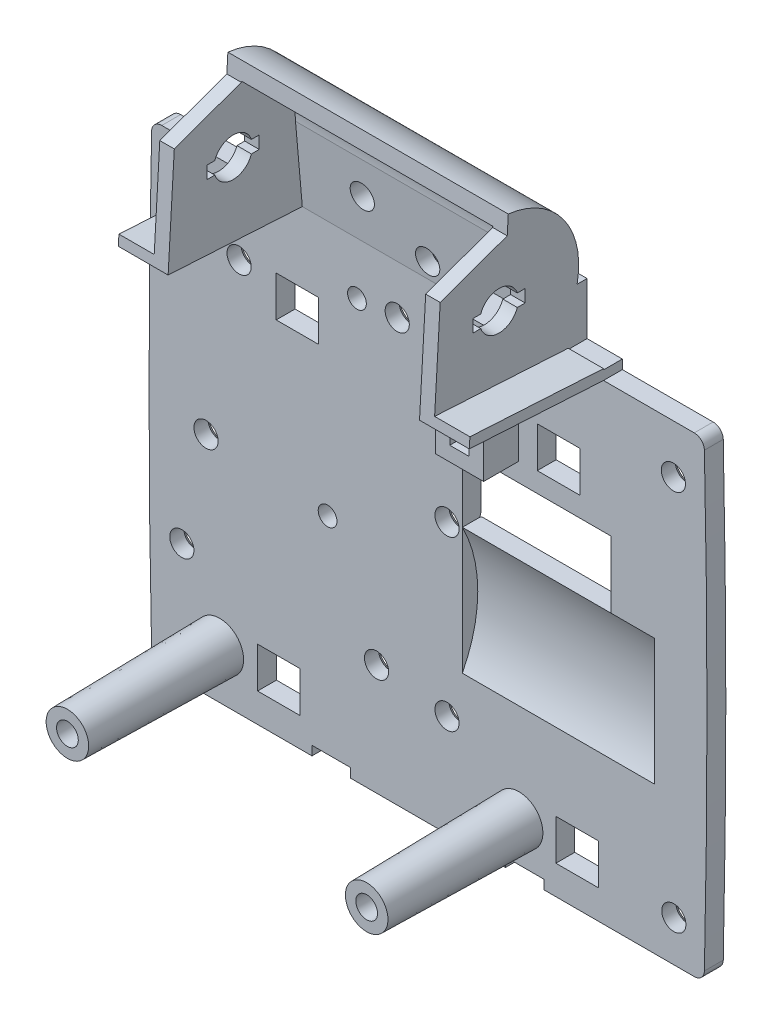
ISO-10303-21;
HEADER;
FILE_DESCRIPTION(('STEP AP214'),'2;1');
FILE_NAME('part.step','',(''),(''),'','','');
FILE_SCHEMA(('AUTOMOTIVE_DESIGN { 1 0 10303 214 1 1 1 1 }'));
ENDSEC;
DATA;
#1=APPLICATION_CONTEXT('core data for automotive mechanical design processes');
#2=APPLICATION_PROTOCOL_DEFINITION('international standard','automotive_design',2000,#1);
#3=PRODUCT_CONTEXT('',#1,'mechanical');
#4=PRODUCT('Part','Part','',(#3));
#5=PRODUCT_RELATED_PRODUCT_CATEGORY('part','',(#4));
#6=PRODUCT_DEFINITION_FORMATION('','',#4);
#7=PRODUCT_DEFINITION_CONTEXT('part definition',#1,'design');
#8=PRODUCT_DEFINITION('design','',#6,#7);
#9=PRODUCT_DEFINITION_SHAPE('','',#8);
#10=(LENGTH_UNIT() NAMED_UNIT(*) SI_UNIT(.MILLI.,.METRE.));
#11=(NAMED_UNIT(*) PLANE_ANGLE_UNIT() SI_UNIT($,.RADIAN.));
#12=(NAMED_UNIT(*) SI_UNIT($,.STERADIAN.) SOLID_ANGLE_UNIT());
#13=UNCERTAINTY_MEASURE_WITH_UNIT(LENGTH_MEASURE(1.E-05),#10,'distance_accuracy_value','');
#14=(GEOMETRIC_REPRESENTATION_CONTEXT(3) GLOBAL_UNCERTAINTY_ASSIGNED_CONTEXT((#13)) GLOBAL_UNIT_ASSIGNED_CONTEXT((#10,
#11,#12)) REPRESENTATION_CONTEXT('',''));
#15=CARTESIAN_POINT('',(0.,0.,0.));
#16=DIRECTION('',(0.,0.,1.));
#17=DIRECTION('',(1.,0.,0.));
#18=AXIS2_PLACEMENT_3D('',#15,#16,#17);
#19=CARTESIAN_POINT('',(27.5358631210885,11.2495708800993,0.));
#20=DIRECTION('',(0.,0.,1.));
#21=DIRECTION('',(1.,0.,0.));
#22=AXIS2_PLACEMENT_3D('',#19,#20,#21);
#23=PLANE('',#22);
#24=CARTESIAN_POINT('',(-22.958113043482,33.5229982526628,0.));
#25=DIRECTION('',(0.,0.,1.));
#26=DIRECTION('',(1.,0.,0.));
#27=AXIS2_PLACEMENT_3D('',#24,#25,#26);
#28=CIRCLE('',#27,1.25);
#29=CARTESIAN_POINT('',(-21.708113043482,33.5229982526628,0.));
#30=VERTEX_POINT('',#29);
#31=EDGE_CURVE('E886',#30,#30,#28,.T.);
#32=ORIENTED_EDGE('',*,*,#31,.F.);
#33=EDGE_LOOP('',(#32));
#34=FACE_BOUND('',#33,.T.);
#35=DIRECTION('',(0.,-1.,0.));
#36=VECTOR('',#35,1.);
#37=CARTESIAN_POINT('',(11.3,51.5995708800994,0.));
#38=LINE('',#37,#36);
#39=CARTESIAN_POINT('',(11.3,51.5995708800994,0.));
#40=VERTEX_POINT('',#39);
#41=CARTESIAN_POINT('',(11.3,47.3995708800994,0.));
#42=VERTEX_POINT('',#41);
#43=EDGE_CURVE('E860',#40,#42,#38,.T.);
#44=ORIENTED_EDGE('',*,*,#43,.F.);
#45=DIRECTION('',(-1.,0.,0.));
#46=VECTOR('',#45,1.);
#47=CARTESIAN_POINT('',(11.3,51.5995708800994,0.));
#48=LINE('',#47,#46);
#49=CARTESIAN_POINT('',(15.7,51.5995708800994,0.));
#50=VERTEX_POINT('',#49);
#51=EDGE_CURVE('E868',#50,#40,#48,.T.);
#52=ORIENTED_EDGE('',*,*,#51,.F.);
#53=DIRECTION('',(0.,1.,0.));
#54=VECTOR('',#53,1.);
#55=CARTESIAN_POINT('',(15.7,51.5995708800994,0.));
#56=LINE('',#55,#54);
#57=CARTESIAN_POINT('',(15.7,47.3995708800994,0.));
#58=VERTEX_POINT('',#57);
#59=EDGE_CURVE('E865',#58,#50,#56,.T.);
#60=ORIENTED_EDGE('',*,*,#59,.F.);
#61=DIRECTION('',(1.,0.,0.));
#62=VECTOR('',#61,1.);
#63=CARTESIAN_POINT('',(11.3,47.3995708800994,0.));
#64=LINE('',#63,#62);
#65=EDGE_CURVE('E862',#42,#58,#64,.T.);
#66=ORIENTED_EDGE('',*,*,#65,.F.);
#67=EDGE_LOOP('',(#44,#52,#60,#66));
#68=FACE_BOUND('',#67,.T.);
#69=CARTESIAN_POINT('',(1.96416825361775,38.1366537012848,0.));
#70=DIRECTION('',(0.,0.,1.));
#71=DIRECTION('',(1.,0.,0.));
#72=AXIS2_PLACEMENT_3D('',#69,#70,#71);
#73=CIRCLE('',#72,1.25);
#74=CARTESIAN_POINT('',(3.21416825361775,38.1366537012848,0.));
#75=VERTEX_POINT('',#74);
#76=EDGE_CURVE('E857',#75,#75,#73,.T.);
#77=ORIENTED_EDGE('',*,*,#76,.F.);
#78=EDGE_LOOP('',(#77));
#79=FACE_BOUND('',#78,.T.);
#80=CARTESIAN_POINT('',(-5.31988112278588,21.6939683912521,0.));
#81=DIRECTION('',(0.,0.,1.));
#82=DIRECTION('',(1.,0.,0.));
#83=AXIS2_PLACEMENT_3D('',#80,#81,#82);
#84=CIRCLE('',#83,1.25);
#85=CARTESIAN_POINT('',(-4.06988112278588,21.6939683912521,0.));
#86=VERTEX_POINT('',#85);
#87=EDGE_CURVE('E854',#86,#86,#84,.T.);
#88=ORIENTED_EDGE('',*,*,#87,.F.);
#89=EDGE_LOOP('',(#88));
#90=FACE_BOUND('',#89,.T.);
#91=CARTESIAN_POINT('',(-25.4241814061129,53.8258073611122,0.));
#92=DIRECTION('',(0.,0.,1.));
#93=DIRECTION('',(1.,0.,0.));
#94=AXIS2_PLACEMENT_3D('',#91,#92,#93);
#95=CIRCLE('',#94,1.25);
#96=CARTESIAN_POINT('',(-24.1741814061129,53.8258073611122,0.));
#97=VERTEX_POINT('',#96);
#98=EDGE_CURVE('E848',#97,#97,#95,.T.);
#99=ORIENTED_EDGE('',*,*,#98,.F.);
#100=EDGE_LOOP('',(#99));
#101=FACE_BOUND('',#100,.T.);
#102=CARTESIAN_POINT('',(1.96416825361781,20.7366537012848,0.));
#103=DIRECTION('',(0.,0.,1.));
#104=DIRECTION('',(1.,0.,0.));
#105=AXIS2_PLACEMENT_3D('',#102,#103,#104);
#106=CIRCLE('',#105,1.25);
#107=CARTESIAN_POINT('',(3.21416825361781,20.7366537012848,0.));
#108=VERTEX_POINT('',#107);
#109=EDGE_CURVE('E845',#108,#108,#106,.T.);
#110=ORIENTED_EDGE('',*,*,#109,.F.);
#111=EDGE_LOOP('',(#110));
#112=FACE_BOUND('',#111,.T.);
#113=CARTESIAN_POINT('',(25.3775800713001,53.8675004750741,0.));
#114=DIRECTION('',(0.,0.,1.));
#115=DIRECTION('',(1.,0.,0.));
#116=AXIS2_PLACEMENT_3D('',#113,#114,#115);
#117=CIRCLE('',#116,1.25);
#118=CARTESIAN_POINT('',(26.6275800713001,53.8675004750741,0.));
#119=VERTEX_POINT('',#118);
#120=EDGE_CURVE('E842',#119,#119,#117,.T.);
#121=ORIENTED_EDGE('',*,*,#120,.F.);
#122=EDGE_LOOP('',(#121));
#123=FACE_BOUND('',#122,.T.);
#124=CARTESIAN_POINT('',(25.4241814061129,14.4260617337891,0.));
#125=DIRECTION('',(0.,0.,1.));
#126=DIRECTION('',(1.,0.,0.));
#127=AXIS2_PLACEMENT_3D('',#124,#125,#126);
#128=CIRCLE('',#127,1.25);
#129=CARTESIAN_POINT('',(26.6741814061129,14.4260617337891,0.));
#130=VERTEX_POINT('',#129);
#131=EDGE_CURVE('E839',#130,#130,#128,.T.);
#132=ORIENTED_EDGE('',*,*,#131,.F.);
#133=EDGE_LOOP('',(#132));
#134=FACE_BOUND('',#133,.T.);
#135=CARTESIAN_POINT('',(-25.4592932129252,22.4867144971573,0.));
#136=DIRECTION('',(0.,0.,1.));
#137=DIRECTION('',(1.,0.,0.));
#138=AXIS2_PLACEMENT_3D('',#135,#136,#137);
#139=CIRCLE('',#138,1.25);
#140=CARTESIAN_POINT('',(-24.2092932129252,22.4867144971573,0.));
#141=VERTEX_POINT('',#140);
#142=EDGE_CURVE('E836',#141,#141,#139,.T.);
#143=ORIENTED_EDGE('',*,*,#142,.F.);
#144=EDGE_LOOP('',(#143));
#145=FACE_BOUND('',#144,.T.);
#146=CARTESIAN_POINT('',(-19.5383559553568,50.8495708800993,0.));
#147=DIRECTION('',(0.,0.,1.));
#148=DIRECTION('',(1.,0.,0.));
#149=AXIS2_PLACEMENT_3D('',#146,#147,#148);
#150=CIRCLE('',#149,1.25);
#151=CARTESIAN_POINT('',(-18.2883559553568,50.8495708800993,0.));
#152=VERTEX_POINT('',#151);
#153=EDGE_CURVE('E833',#152,#152,#150,.T.);
#154=ORIENTED_EDGE('',*,*,#153,.F.);
#155=EDGE_LOOP('',(#154));
#156=FACE_BOUND('',#155,.T.);
#157=CARTESIAN_POINT('',(-3.18470976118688,53.8621383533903,0.));
#158=DIRECTION('',(0.,0.,1.));
#159=DIRECTION('',(1.,0.,0.));
#160=AXIS2_PLACEMENT_3D('',#157,#158,#159);
#161=CIRCLE('',#160,1.25);
#162=CARTESIAN_POINT('',(-1.93470976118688,53.8621383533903,0.));
#163=VERTEX_POINT('',#162);
#164=EDGE_CURVE('E827',#163,#163,#161,.T.);
#165=ORIENTED_EDGE('',*,*,#164,.F.);
#166=EDGE_LOOP('',(#165));
#167=FACE_BOUND('',#166,.T.);
#168=DIRECTION('',(0.,-1.,0.));
#169=VECTOR('',#168,1.);
#170=CARTESIAN_POINT('',(13.225,17.3995708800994,0.));
#171=LINE('',#170,#169);
#172=CARTESIAN_POINT('',(13.225,17.3995708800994,0.));
#173=VERTEX_POINT('',#172);
#174=CARTESIAN_POINT('',(13.225,13.1995708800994,0.));
#175=VERTEX_POINT('',#174);
#176=EDGE_CURVE('E2071',#173,#175,#171,.T.);
#177=ORIENTED_EDGE('',*,*,#176,.F.);
#178=DIRECTION('',(-1.,0.,0.));
#179=VECTOR('',#178,1.);
#180=CARTESIAN_POINT('',(13.225,17.3995708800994,0.));
#181=LINE('',#180,#179);
#182=CARTESIAN_POINT('',(17.625,17.3995708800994,0.));
#183=VERTEX_POINT('',#182);
#184=EDGE_CURVE('E2085',#183,#173,#181,.T.);
#185=ORIENTED_EDGE('',*,*,#184,.F.);
#186=DIRECTION('',(0.,1.,0.));
#187=VECTOR('',#186,1.);
#188=CARTESIAN_POINT('',(17.625,17.3995708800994,0.));
#189=LINE('',#188,#187);
#190=CARTESIAN_POINT('',(17.625,13.1995708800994,0.));
#191=VERTEX_POINT('',#190);
#192=EDGE_CURVE('E2082',#191,#183,#189,.T.);
#193=ORIENTED_EDGE('',*,*,#192,.F.);
#194=DIRECTION('',(1.,0.,0.));
#195=VECTOR('',#194,1.);
#196=CARTESIAN_POINT('',(13.225,13.1995708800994,0.));
#197=LINE('',#196,#195);
#198=EDGE_CURVE('E2079',#175,#191,#197,.T.);
#199=ORIENTED_EDGE('',*,*,#198,.F.);
#200=EDGE_LOOP('',(#177,#185,#193,#199));
#201=FACE_BOUND('',#200,.T.);
#202=DIRECTION('',(-1.,0.,0.));
#203=VECTOR('',#202,1.);
#204=CARTESIAN_POINT('',(-13.225,17.3995708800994,0.));
#205=LINE('',#204,#203);
#206=CARTESIAN_POINT('',(-13.225,17.3995708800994,0.));
#207=VERTEX_POINT('',#206);
#208=CARTESIAN_POINT('',(-17.625,17.3995708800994,0.));
#209=VERTEX_POINT('',#208);
#210=EDGE_CURVE('E2041',#207,#209,#205,.T.);
#211=ORIENTED_EDGE('',*,*,#210,.F.);
#212=DIRECTION('',(0.,1.,0.));
#213=VECTOR('',#212,1.);
#214=CARTESIAN_POINT('',(-13.225,17.3995708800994,0.));
#215=LINE('',#214,#213);
#216=CARTESIAN_POINT('',(-13.225,13.1995708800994,0.));
#217=VERTEX_POINT('',#216);
#218=EDGE_CURVE('E2055',#217,#207,#215,.T.);
#219=ORIENTED_EDGE('',*,*,#218,.F.);
#220=DIRECTION('',(1.,0.,0.));
#221=VECTOR('',#220,1.);
#222=CARTESIAN_POINT('',(-13.225,13.1995708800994,0.));
#223=LINE('',#222,#221);
#224=CARTESIAN_POINT('',(-17.625,13.1995708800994,0.));
#225=VERTEX_POINT('',#224);
#226=EDGE_CURVE('E2052',#225,#217,#223,.T.);
#227=ORIENTED_EDGE('',*,*,#226,.F.);
#228=DIRECTION('',(0.,-1.,0.));
#229=VECTOR('',#228,1.);
#230=CARTESIAN_POINT('',(-17.625,17.3995708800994,0.));
#231=LINE('',#230,#229);
#232=EDGE_CURVE('E2049',#209,#225,#231,.T.);
#233=ORIENTED_EDGE('',*,*,#232,.F.);
#234=EDGE_LOOP('',(#211,#219,#227,#233));
#235=FACE_BOUND('',#234,.T.);
#236=DIRECTION('',(-1.,0.,0.));
#237=VECTOR('',#236,1.);
#238=CARTESIAN_POINT('',(-11.3,51.5995708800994,0.));
#239=LINE('',#238,#237);
#240=CARTESIAN_POINT('',(-11.3,51.5995708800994,0.));
#241=VERTEX_POINT('',#240);
#242=CARTESIAN_POINT('',(-15.7,51.5995708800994,0.));
#243=VERTEX_POINT('',#242);
#244=EDGE_CURVE('E2015',#241,#243,#239,.T.);
#245=ORIENTED_EDGE('',*,*,#244,.F.);
#246=DIRECTION('',(0.,1.,0.));
#247=VECTOR('',#246,1.);
#248=CARTESIAN_POINT('',(-11.3,51.5995708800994,0.));
#249=LINE('',#248,#247);
#250=CARTESIAN_POINT('',(-11.3,47.3995708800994,0.));
#251=VERTEX_POINT('',#250);
#252=EDGE_CURVE('E2023',#251,#241,#249,.T.);
#253=ORIENTED_EDGE('',*,*,#252,.F.);
#254=DIRECTION('',(1.,0.,0.));
#255=VECTOR('',#254,1.);
#256=CARTESIAN_POINT('',(-11.3,47.3995708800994,0.));
#257=LINE('',#256,#255);
#258=CARTESIAN_POINT('',(-15.7,47.3995708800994,0.));
#259=VERTEX_POINT('',#258);
#260=EDGE_CURVE('E2020',#259,#251,#257,.T.);
#261=ORIENTED_EDGE('',*,*,#260,.F.);
#262=DIRECTION('',(0.,-1.,0.));
#263=VECTOR('',#262,1.);
#264=CARTESIAN_POINT('',(-15.7,51.5995708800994,0.));
#265=LINE('',#264,#263);
#266=EDGE_CURVE('E2017',#243,#259,#265,.T.);
#267=ORIENTED_EDGE('',*,*,#266,.F.);
#268=EDGE_LOOP('',(#245,#253,#261,#267));
#269=FACE_BOUND('',#268,.T.);
#270=CARTESIAN_POINT('',(-10.3858317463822,32.505634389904,0.));
#271=DIRECTION('',(0.,0.,1.));
#272=DIRECTION('',(1.,0.,0.));
#273=AXIS2_PLACEMENT_3D('',#270,#271,#272);
#274=CIRCLE('',#273,0.968454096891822);
#275=CARTESIAN_POINT('',(-9.41737764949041,32.505634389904,0.));
#276=VERTEX_POINT('',#275);
#277=EDGE_CURVE('E2011',#276,#276,#274,.T.);
#278=ORIENTED_EDGE('',*,*,#277,.F.);
#279=EDGE_LOOP('',(#278));
#280=FACE_BOUND('',#279,.T.);
#281=CARTESIAN_POINT('',(-7.34712113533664,53.5056343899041,0.));
#282=DIRECTION('',(0.,0.,1.));
#283=DIRECTION('',(1.,0.,0.));
#284=AXIS2_PLACEMENT_3D('',#281,#282,#283);
#285=CIRCLE('',#284,0.968454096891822);
#286=CARTESIAN_POINT('',(-6.37866703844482,53.5056343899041,0.));
#287=VERTEX_POINT('',#286);
#288=EDGE_CURVE('E2007',#287,#287,#285,.T.);
#289=ORIENTED_EDGE('',*,*,#288,.F.);
#290=EDGE_LOOP('',(#289));
#291=FACE_BOUND('',#290,.T.);
#292=DIRECTION('',(-1.,0.,0.));
#293=VECTOR('',#292,1.);
#294=CARTESIAN_POINT('',(27.5358631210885,51.7995708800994,0.));
#295=LINE('',#294,#293);
#296=CARTESIAN_POINT('',(7.85,51.7995708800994,0.));
#297=VERTEX_POINT('',#296);
#298=CARTESIAN_POINT('',(5.85,51.7995708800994,0.));
#299=VERTEX_POINT('',#298);
#300=EDGE_CURVE('E3061',#297,#299,#295,.T.);
#301=ORIENTED_EDGE('',*,*,#300,.F.);
#302=DIRECTION('',(1.,0.,0.));
#303=VECTOR('',#302,1.);
#304=CARTESIAN_POINT('',(7.85,51.7995708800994,0.));
#305=LINE('',#304,#303);
#306=CARTESIAN_POINT('',(9.35,51.7995708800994,0.));
#307=VERTEX_POINT('',#306);
#308=EDGE_CURVE('E2223',#297,#307,#305,.T.);
#309=ORIENTED_EDGE('',*,*,#308,.T.);
#310=DIRECTION('',(0.,1.,0.));
#311=VECTOR('',#310,1.);
#312=CARTESIAN_POINT('',(9.35,47.2495708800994,0.));
#313=LINE('',#312,#311);
#314=CARTESIAN_POINT('',(9.35,47.2495708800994,0.));
#315=VERTEX_POINT('',#314);
#316=EDGE_CURVE('E2220',#315,#307,#313,.T.);
#317=ORIENTED_EDGE('',*,*,#316,.F.);
#318=DIRECTION('',(1.,0.,0.));
#319=VECTOR('',#318,1.);
#320=CARTESIAN_POINT('',(4.35,47.2495708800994,0.));
#321=LINE('',#320,#319);
#322=CARTESIAN_POINT('',(4.35,47.2495708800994,0.));
#323=VERTEX_POINT('',#322);
#324=EDGE_CURVE('E2232',#323,#315,#321,.T.);
#325=ORIENTED_EDGE('',*,*,#324,.F.);
#326=DIRECTION('',(0.,-1.,0.));
#327=VECTOR('',#326,1.);
#328=CARTESIAN_POINT('',(4.35,51.7995708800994,0.));
#329=LINE('',#328,#327);
#330=CARTESIAN_POINT('',(4.35,51.7995708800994,0.));
#331=VERTEX_POINT('',#330);
#332=EDGE_CURVE('E2229',#331,#323,#329,.T.);
#333=ORIENTED_EDGE('',*,*,#332,.F.);
#334=DIRECTION('',(1.,0.,0.));
#335=VECTOR('',#334,1.);
#336=CARTESIAN_POINT('',(4.35,51.7995708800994,0.));
#337=LINE('',#336,#335);
#338=EDGE_CURVE('E2226',#331,#299,#337,.T.);
#339=ORIENTED_EDGE('',*,*,#338,.T.);
#340=EDGE_LOOP('',(#301,#309,#317,#325,#333,#339));
#341=FACE_BOUND('',#340,.T.);
#342=DIRECTION('',(0.,1.,0.));
#343=VECTOR('',#342,1.);
#344=CARTESIAN_POINT('',(7.85,11.2495708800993,0.));
#345=LINE('',#344,#343);
#346=CARTESIAN_POINT('',(7.85,56.7495708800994,0.));
#347=VERTEX_POINT('',#346);
#348=CARTESIAN_POINT('',(7.85,58.8995708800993,0.));
#349=VERTEX_POINT('',#348);
#350=EDGE_CURVE('E50',#347,#349,#345,.T.);
#351=ORIENTED_EDGE('',*,*,#350,.F.);
#352=DIRECTION('',(1.,0.,0.));
#353=VECTOR('',#352,1.);
#354=CARTESIAN_POINT('',(27.5358631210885,56.7495708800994,0.));
#355=LINE('',#354,#353);
#356=CARTESIAN_POINT('',(5.85,56.7495708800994,0.));
#357=VERTEX_POINT('',#356);
#358=EDGE_CURVE('E3036',#357,#347,#355,.T.);
#359=ORIENTED_EDGE('',*,*,#358,.F.);
#360=DIRECTION('',(-1.,0.,0.));
#361=VECTOR('',#360,1.);
#362=CARTESIAN_POINT('',(5.85,56.7495708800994,0.));
#363=LINE('',#362,#361);
#364=CARTESIAN_POINT('',(4.35,56.7495708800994,0.));
#365=VERTEX_POINT('',#364);
#366=EDGE_CURVE('E3071',#357,#365,#363,.T.);
#367=ORIENTED_EDGE('',*,*,#366,.T.);
#368=DIRECTION('',(0.,1.,0.));
#369=VECTOR('',#368,1.);
#370=CARTESIAN_POINT('',(4.35,56.7495708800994,0.));
#371=LINE('',#370,#369);
#372=CARTESIAN_POINT('',(4.35,58.8995708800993,0.));
#373=VERTEX_POINT('',#372);
#374=EDGE_CURVE('E3069',#365,#373,#371,.T.);
#375=ORIENTED_EDGE('',*,*,#374,.T.);
#376=DIRECTION('',(1.,0.,0.));
#377=VECTOR('',#376,1.);
#378=CARTESIAN_POINT('',(-35.1352888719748,58.8995708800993,0.));
#379=LINE('',#378,#377);
#380=CARTESIAN_POINT('',(-13.,58.8995708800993,0.));
#381=VERTEX_POINT('',#380);
#382=EDGE_CURVE('E1809',#381,#373,#379,.T.);
#383=ORIENTED_EDGE('',*,*,#382,.F.);
#384=DIRECTION('',(-1.,0.,0.));
#385=VECTOR('',#384,1.);
#386=CARTESIAN_POINT('',(40.1920662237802,58.8995708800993,0.));
#387=LINE('',#386,#385);
#388=CARTESIAN_POINT('',(-18.15,58.8995708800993,0.));
#389=VERTEX_POINT('',#388);
#390=EDGE_CURVE('E1995',#381,#389,#387,.T.);
#391=ORIENTED_EDGE('',*,*,#390,.T.);
#392=DIRECTION('',(-1.,0.,0.));
#393=VECTOR('',#392,1.);
#394=CARTESIAN_POINT('',(-18.15,58.8995708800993,0.));
#395=LINE('',#394,#393);
#396=CARTESIAN_POINT('',(-27.5358631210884,58.8995708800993,0.));
#397=VERTEX_POINT('',#396);
#398=EDGE_CURVE('E921',#389,#397,#395,.T.);
#399=ORIENTED_EDGE('',*,*,#398,.T.);
#400=CARTESIAN_POINT('',(-27.5358631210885,57.8495708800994,0.));
#401=DIRECTION('',(0.,0.,1.));
#402=DIRECTION('',(1.,0.,0.));
#403=AXIS2_PLACEMENT_3D('',#400,#401,#402);
#404=CIRCLE('',#403,1.04999999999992);
#405=CARTESIAN_POINT('',(-28.5855932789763,57.8733741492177,0.));
#406=VERTEX_POINT('',#405);
#407=EDGE_CURVE('E924',#397,#406,#404,.T.);
#408=ORIENTED_EDGE('',*,*,#407,.T.);
#409=CARTESIAN_POINT('',(1000.,34.5495708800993,0.));
#410=DIRECTION('',(0.,0.,1.));
#411=DIRECTION('',(1.,0.,0.));
#412=AXIS2_PLACEMENT_3D('',#409,#410,#411);
#413=CIRCLE('',#412,1028.85);
#414=CARTESIAN_POINT('',(-28.5855932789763,11.2257676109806,0.));
#415=VERTEX_POINT('',#414);
#416=EDGE_CURVE('E927',#406,#415,#413,.T.);
#417=ORIENTED_EDGE('',*,*,#416,.T.);
#418=CARTESIAN_POINT('',(-27.5358631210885,11.2495708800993,0.));
#419=DIRECTION('',(0.,0.,1.));
#420=DIRECTION('',(1.,0.,0.));
#421=AXIS2_PLACEMENT_3D('',#418,#419,#420);
#422=CIRCLE('',#421,1.04999999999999);
#423=CARTESIAN_POINT('',(-27.5358631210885,10.1995708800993,0.));
#424=VERTEX_POINT('',#423);
#425=EDGE_CURVE('E930',#415,#424,#422,.T.);
#426=ORIENTED_EDGE('',*,*,#425,.T.);
#427=DIRECTION('',(1.,0.,0.));
#428=VECTOR('',#427,1.);
#429=CARTESIAN_POINT('',(-27.5358631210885,10.1995708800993,0.));
#430=LINE('',#429,#428);
#431=CARTESIAN_POINT('',(-12.,10.1995708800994,0.));
#432=VERTEX_POINT('',#431);
#433=EDGE_CURVE('E933',#424,#432,#430,.T.);
#434=ORIENTED_EDGE('',*,*,#433,.T.);
#435=DIRECTION('',(0.,1.,0.));
#436=VECTOR('',#435,1.);
#437=CARTESIAN_POINT('',(-12.,11.1495708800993,0.));
#438=LINE('',#437,#436);
#439=CARTESIAN_POINT('',(-12.,11.1495708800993,0.));
#440=VERTEX_POINT('',#439);
#441=EDGE_CURVE('E936',#432,#440,#438,.T.);
#442=ORIENTED_EDGE('',*,*,#441,.T.);
#443=DIRECTION('',(1.,0.,0.));
#444=VECTOR('',#443,1.);
#445=CARTESIAN_POINT('',(-8.,11.1495708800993,0.));
#446=LINE('',#445,#444);
#447=CARTESIAN_POINT('',(-8.,11.1495708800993,0.));
#448=VERTEX_POINT('',#447);
#449=EDGE_CURVE('E939',#440,#448,#446,.T.);
#450=ORIENTED_EDGE('',*,*,#449,.T.);
#451=DIRECTION('',(0.,-1.,0.));
#452=VECTOR('',#451,1.);
#453=CARTESIAN_POINT('',(-7.99999999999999,10.1995708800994,0.));
#454=LINE('',#453,#452);
#455=CARTESIAN_POINT('',(-7.99999999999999,10.1995708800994,0.));
#456=VERTEX_POINT('',#455);
#457=EDGE_CURVE('E942',#448,#456,#454,.T.);
#458=ORIENTED_EDGE('',*,*,#457,.T.);
#459=DIRECTION('',(1.,0.,0.));
#460=VECTOR('',#459,1.);
#461=CARTESIAN_POINT('',(-7.99999999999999,10.1995708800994,0.));
#462=LINE('',#461,#460);
#463=CARTESIAN_POINT('',(8.,10.1995708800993,0.));
#464=VERTEX_POINT('',#463);
#465=EDGE_CURVE('E945',#456,#464,#462,.T.);
#466=ORIENTED_EDGE('',*,*,#465,.T.);
#467=DIRECTION('',(0.,1.,0.));
#468=VECTOR('',#467,1.);
#469=CARTESIAN_POINT('',(8.,11.1495708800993,0.));
#470=LINE('',#469,#468);
#471=CARTESIAN_POINT('',(8.,11.1495708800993,0.));
#472=VERTEX_POINT('',#471);
#473=EDGE_CURVE('E948',#464,#472,#470,.T.);
#474=ORIENTED_EDGE('',*,*,#473,.T.);
#475=DIRECTION('',(1.,0.,0.));
#476=VECTOR('',#475,1.);
#477=CARTESIAN_POINT('',(12.,11.1495708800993,0.));
#478=LINE('',#477,#476);
#479=CARTESIAN_POINT('',(12.,11.1495708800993,0.));
#480=VERTEX_POINT('',#479);
#481=EDGE_CURVE('E951',#472,#480,#478,.T.);
#482=ORIENTED_EDGE('',*,*,#481,.T.);
#483=DIRECTION('',(0.,-1.,0.));
#484=VECTOR('',#483,1.);
#485=CARTESIAN_POINT('',(12.,10.1995708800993,0.));
#486=LINE('',#485,#484);
#487=CARTESIAN_POINT('',(12.,10.1995708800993,0.));
#488=VERTEX_POINT('',#487);
#489=EDGE_CURVE('E954',#480,#488,#486,.T.);
#490=ORIENTED_EDGE('',*,*,#489,.T.);
#491=DIRECTION('',(1.,0.,0.));
#492=VECTOR('',#491,1.);
#493=CARTESIAN_POINT('',(12.,10.1995708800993,0.));
#494=LINE('',#493,#492);
#495=CARTESIAN_POINT('',(27.5358631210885,10.1995708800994,0.));
#496=VERTEX_POINT('',#495);
#497=EDGE_CURVE('E895',#488,#496,#494,.T.);
#498=ORIENTED_EDGE('',*,*,#497,.T.);
#499=CARTESIAN_POINT('',(27.5358631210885,11.2495708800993,0.));
#500=DIRECTION('',(0.,0.,1.));
#501=DIRECTION('',(1.,0.,0.));
#502=AXIS2_PLACEMENT_3D('',#499,#500,#501);
#503=CIRCLE('',#502,1.04999999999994);
#504=CARTESIAN_POINT('',(28.5855932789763,11.2257676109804,0.));
#505=VERTEX_POINT('',#504);
#506=EDGE_CURVE('E898',#496,#505,#503,.T.);
#507=ORIENTED_EDGE('',*,*,#506,.T.);
#508=CARTESIAN_POINT('',(-1000.,34.5495708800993,0.));
#509=DIRECTION('',(0.,0.,1.));
#510=DIRECTION('',(1.,0.,0.));
#511=AXIS2_PLACEMENT_3D('',#508,#509,#510);
#512=CIRCLE('',#511,1028.85);
#513=CARTESIAN_POINT('',(28.5855932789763,57.8733741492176,0.));
#514=VERTEX_POINT('',#513);
#515=EDGE_CURVE('E901',#505,#514,#512,.T.);
#516=ORIENTED_EDGE('',*,*,#515,.T.);
#517=CARTESIAN_POINT('',(27.5358631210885,57.8495708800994,0.));
#518=DIRECTION('',(0.,0.,1.));
#519=DIRECTION('',(1.,0.,0.));
#520=AXIS2_PLACEMENT_3D('',#517,#518,#519);
#521=CIRCLE('',#520,1.04999999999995);
#522=CARTESIAN_POINT('',(27.5358631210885,58.8995708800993,0.));
#523=VERTEX_POINT('',#522);
#524=EDGE_CURVE('E904',#514,#523,#521,.T.);
#525=ORIENTED_EDGE('',*,*,#524,.T.);
#526=DIRECTION('',(-1.,0.,0.));
#527=VECTOR('',#526,1.);
#528=CARTESIAN_POINT('',(27.5358631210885,58.8995708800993,0.));
#529=LINE('',#528,#527);
#530=CARTESIAN_POINT('',(18.15,58.8995708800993,0.));
#531=VERTEX_POINT('',#530);
#532=EDGE_CURVE('E907',#523,#531,#529,.T.);
#533=ORIENTED_EDGE('',*,*,#532,.T.);
#534=CARTESIAN_POINT('',(13.,58.8995708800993,0.));
#535=VERTEX_POINT('',#534);
#536=EDGE_CURVE('E1996',#531,#535,#387,.T.);
#537=ORIENTED_EDGE('',*,*,#536,.T.);
#538=EDGE_CURVE('E1807',#349,#535,#379,.T.);
#539=ORIENTED_EDGE('',*,*,#538,.F.);
#540=EDGE_LOOP('',(#351,#359,#367,#375,#383,#391,#399,#408,#417,#426,#434,#442,#450,#458,#466,
#474,#482,#490,#498,#507,#516,#525,#533,#537,#539));
#541=FACE_BOUND('',#540,.T.);
#542=DIRECTION('',(0.,1.,0.));
#543=VECTOR('',#542,1.);
#544=CARTESIAN_POINT('',(18.9499999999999,45.3495708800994,0.));
#545=LINE('',#544,#543);
#546=CARTESIAN_POINT('',(18.9499999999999,38.4495708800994,0.));
#547=VERTEX_POINT('',#546);
#548=CARTESIAN_POINT('',(18.9499999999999,45.3495708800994,0.));
#549=VERTEX_POINT('',#548);
#550=EDGE_CURVE('E772',#547,#549,#545,.T.);
#551=ORIENTED_EDGE('',*,*,#550,.F.);
#552=DIRECTION('',(-1.,0.,0.));
#553=VECTOR('',#552,1.);
#554=CARTESIAN_POINT('',(23.4499999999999,38.4495708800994,0.));
#555=LINE('',#554,#553);
#556=CARTESIAN_POINT('',(23.4499999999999,38.4495708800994,0.));
#557=VERTEX_POINT('',#556);
#558=EDGE_CURVE('E766',#557,#547,#555,.T.);
#559=ORIENTED_EDGE('',*,*,#558,.F.);
#560=DIRECTION('',(0.,-1.,0.));
#561=VECTOR('',#560,1.);
#562=CARTESIAN_POINT('',(23.4499999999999,38.4495708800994,0.));
#563=LINE('',#562,#561);
#564=CARTESIAN_POINT('',(23.4499999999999,25.382852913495,0.));
#565=VERTEX_POINT('',#564);
#566=EDGE_CURVE('E3023',#557,#565,#563,.T.);
#567=ORIENTED_EDGE('',*,*,#566,.T.);
#568=DIRECTION('',(-1.,0.,0.));
#569=VECTOR('',#568,1.);
#570=CARTESIAN_POINT('',(23.4499999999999,25.382852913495,0.));
#571=LINE('',#570,#569);
#572=CARTESIAN_POINT('',(3.54999999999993,25.382852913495,0.));
#573=VERTEX_POINT('',#572);
#574=EDGE_CURVE('E787',#565,#573,#571,.T.);
#575=ORIENTED_EDGE('',*,*,#574,.T.);
#576=DIRECTION('',(0.,-1.,0.));
#577=VECTOR('',#576,1.);
#578=CARTESIAN_POINT('',(3.54999999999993,38.4495708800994,0.));
#579=LINE('',#578,#577);
#580=CARTESIAN_POINT('',(3.54999999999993,38.4495708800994,0.));
#581=VERTEX_POINT('',#580);
#582=EDGE_CURVE('E778',#581,#573,#579,.T.);
#583=ORIENTED_EDGE('',*,*,#582,.F.);
#584=DIRECTION('',(0.,-1.,0.));
#585=VECTOR('',#584,1.);
#586=CARTESIAN_POINT('',(3.54999999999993,45.3495708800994,0.));
#587=LINE('',#586,#585);
#588=CARTESIAN_POINT('',(3.54999999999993,45.3495708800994,0.));
#589=VERTEX_POINT('',#588);
#590=EDGE_CURVE('E773',#589,#581,#587,.T.);
#591=ORIENTED_EDGE('',*,*,#590,.F.);
#592=DIRECTION('',(-1.,0.,0.));
#593=VECTOR('',#592,1.);
#594=CARTESIAN_POINT('',(3.54999999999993,45.3495708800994,0.));
#595=LINE('',#594,#593);
#596=EDGE_CURVE('E814',#549,#589,#595,.T.);
#597=ORIENTED_EDGE('',*,*,#596,.F.);
#598=EDGE_LOOP('',(#551,#559,#567,#575,#583,#591,#597));
#599=FACE_BOUND('',#598,.T.);
#600=CARTESIAN_POINT('',(-21.5432594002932,15.2792621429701,0.));
#601=DIRECTION('',(0.,0.,1.));
#602=DIRECTION('',(1.,0.,0.));
#603=AXIS2_PLACEMENT_3D('',#600,#601,#602);
#604=CIRCLE('',#603,2.475);
#605=CARTESIAN_POINT('',(-19.0682594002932,15.2792621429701,0.));
#606=VERTEX_POINT('',#605);
#607=EDGE_CURVE('E3014',#606,#606,#604,.T.);
#608=ORIENTED_EDGE('',*,*,#607,.F.);
#609=EDGE_LOOP('',(#608));
#610=FACE_BOUND('',#609,.T.);
#611=CARTESIAN_POINT('',(9.40674059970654,15.2245708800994,0.));
#612=DIRECTION('',(0.,0.,1.));
#613=DIRECTION('',(1.,0.,0.));
#614=AXIS2_PLACEMENT_3D('',#611,#612,#613);
#615=CIRCLE('',#614,2.475);
#616=CARTESIAN_POINT('',(11.8817405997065,15.2245708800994,0.));
#617=VERTEX_POINT('',#616);
#618=EDGE_CURVE('E3008',#617,#617,#615,.T.);
#619=ORIENTED_EDGE('',*,*,#618,.F.);
#620=EDGE_LOOP('',(#619));
#621=FACE_BOUND('',#620,.T.);
#622=ADVANCED_FACE('F28',(#34,#68,#79,#90,#101,#112,#123,#134,#145,#156,#167,#201,#235,#269,
#280,#291,#341,#541,#599,#610,#621),#23,.T.);
#623=CARTESIAN_POINT('',(27.5358631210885,11.2495708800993,-1.95));
#624=DIRECTION('',(0.,0.,1.));
#625=DIRECTION('',(1.,0.,0.));
#626=AXIS2_PLACEMENT_3D('',#623,#624,#625);
#627=PLANE('',#626);
#628=DIRECTION('',(-1.,0.,0.));
#629=VECTOR('',#628,1.);
#630=CARTESIAN_POINT('',(27.5358631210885,59.7495708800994,-1.95));
#631=LINE('',#630,#629);
#632=CARTESIAN_POINT('',(7.85,59.7495708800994,-1.95));
#633=VERTEX_POINT('',#632);
#634=CARTESIAN_POINT('',(5.85,59.7495708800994,-1.95));
#635=VERTEX_POINT('',#634);
#636=EDGE_CURVE('E3044',#633,#635,#631,.T.);
#637=ORIENTED_EDGE('',*,*,#636,.T.);
#638=DIRECTION('',(0.,-1.,0.));
#639=VECTOR('',#638,1.);
#640=CARTESIAN_POINT('',(5.85,11.2495708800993,-1.95));
#641=LINE('',#640,#639);
#642=CARTESIAN_POINT('',(5.85,56.7495708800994,-1.95));
#643=VERTEX_POINT('',#642);
#644=EDGE_CURVE('E3047',#635,#643,#641,.T.);
#645=ORIENTED_EDGE('',*,*,#644,.T.);
#646=DIRECTION('',(1.,0.,0.));
#647=VECTOR('',#646,1.);
#648=CARTESIAN_POINT('',(27.5358631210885,56.7495708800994,-1.95));
#649=LINE('',#648,#647);
#650=CARTESIAN_POINT('',(7.85,56.7495708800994,-1.95));
#651=VERTEX_POINT('',#650);
#652=EDGE_CURVE('E3031',#643,#651,#649,.T.);
#653=ORIENTED_EDGE('',*,*,#652,.T.);
#654=DIRECTION('',(0.,1.,0.));
#655=VECTOR('',#654,1.);
#656=CARTESIAN_POINT('',(7.85,11.2495708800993,-1.95));
#657=LINE('',#656,#655);
#658=EDGE_CURVE('E3041',#651,#633,#657,.T.);
#659=ORIENTED_EDGE('',*,*,#658,.T.);
#660=EDGE_LOOP('',(#637,#645,#653,#659));
#661=FACE_BOUND('',#660,.T.);
#662=DIRECTION('',(0.,-1.,0.));
#663=VECTOR('',#662,1.);
#664=CARTESIAN_POINT('',(5.85000000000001,11.2495708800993,-1.95));
#665=LINE('',#664,#663);
#666=CARTESIAN_POINT('',(5.85,51.7995708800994,-1.95));
#667=VERTEX_POINT('',#666);
#668=CARTESIAN_POINT('',(5.85,48.7495708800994,-1.95));
#669=VERTEX_POINT('',#668);
#670=EDGE_CURVE('E3063',#667,#669,#665,.T.);
#671=ORIENTED_EDGE('',*,*,#670,.T.);
#672=DIRECTION('',(1.,0.,0.));
#673=VECTOR('',#672,1.);
#674=CARTESIAN_POINT('',(27.5358631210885,48.7495708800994,-1.95));
#675=LINE('',#674,#673);
#676=CARTESIAN_POINT('',(7.85,48.7495708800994,-1.95));
#677=VERTEX_POINT('',#676);
#678=EDGE_CURVE('E3066',#669,#677,#675,.T.);
#679=ORIENTED_EDGE('',*,*,#678,.T.);
#680=DIRECTION('',(0.,1.,0.));
#681=VECTOR('',#680,1.);
#682=CARTESIAN_POINT('',(7.84999999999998,11.2495708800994,-1.95));
#683=LINE('',#682,#681);
#684=CARTESIAN_POINT('',(7.85,51.7995708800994,-1.95));
#685=VERTEX_POINT('',#684);
#686=EDGE_CURVE('E3054',#677,#685,#683,.T.);
#687=ORIENTED_EDGE('',*,*,#686,.T.);
#688=DIRECTION('',(-1.,0.,0.));
#689=VECTOR('',#688,1.);
#690=CARTESIAN_POINT('',(27.5358631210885,51.7995708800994,-1.95));
#691=LINE('',#690,#689);
#692=EDGE_CURVE('E3058',#685,#667,#691,.T.);
#693=ORIENTED_EDGE('',*,*,#692,.T.);
#694=EDGE_LOOP('',(#671,#679,#687,#693));
#695=FACE_BOUND('',#694,.T.);
#696=DIRECTION('',(0.,1.,0.));
#697=VECTOR('',#696,1.);
#698=CARTESIAN_POINT('',(-15.65,51.5995708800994,-1.95));
#699=LINE('',#698,#697);
#700=CARTESIAN_POINT('',(-15.65,51.5995708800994,-1.95));
#701=VERTEX_POINT('',#700);
#702=CARTESIAN_POINT('',(-15.65,53.9995708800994,-1.95));
#703=VERTEX_POINT('',#702);
#704=EDGE_CURVE('E1688',#701,#703,#699,.T.);
#705=ORIENTED_EDGE('',*,*,#704,.F.);
#706=DIRECTION('',(-1.,0.,0.));
#707=VECTOR('',#706,1.);
#708=CARTESIAN_POINT('',(-11.3,51.5995708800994,-1.95));
#709=LINE('',#708,#707);
#710=CARTESIAN_POINT('',(-15.7,51.5995708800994,-1.95));
#711=VERTEX_POINT('',#710);
#712=EDGE_CURVE('E2026',#701,#711,#709,.T.);
#713=ORIENTED_EDGE('',*,*,#712,.T.);
#714=DIRECTION('',(0.,-1.,0.));
#715=VECTOR('',#714,1.);
#716=CARTESIAN_POINT('',(-15.7,51.5995708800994,-1.95));
#717=LINE('',#716,#715);
#718=CARTESIAN_POINT('',(-15.7,47.3995708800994,-1.95));
#719=VERTEX_POINT('',#718);
#720=EDGE_CURVE('E2029',#711,#719,#717,.T.);
#721=ORIENTED_EDGE('',*,*,#720,.T.);
#722=DIRECTION('',(1.,0.,0.));
#723=VECTOR('',#722,1.);
#724=CARTESIAN_POINT('',(-11.3,47.3995708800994,-1.95));
#725=LINE('',#724,#723);
#726=CARTESIAN_POINT('',(-11.3,47.3995708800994,-1.95));
#727=VERTEX_POINT('',#726);
#728=EDGE_CURVE('E2032',#719,#727,#725,.T.);
#729=ORIENTED_EDGE('',*,*,#728,.T.);
#730=DIRECTION('',(0.,1.,0.));
#731=VECTOR('',#730,1.);
#732=CARTESIAN_POINT('',(-11.3,51.5995708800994,-1.95));
#733=LINE('',#732,#731);
#734=CARTESIAN_POINT('',(-11.3,51.5995708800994,-1.95));
#735=VERTEX_POINT('',#734);
#736=EDGE_CURVE('E2035',#727,#735,#733,.T.);
#737=ORIENTED_EDGE('',*,*,#736,.T.);
#738=CARTESIAN_POINT('',(-11.35,51.5995708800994,-1.95));
#739=VERTEX_POINT('',#738);
#740=EDGE_CURVE('E2027',#735,#739,#709,.T.);
#741=ORIENTED_EDGE('',*,*,#740,.T.);
#742=DIRECTION('',(0.,1.,0.));
#743=VECTOR('',#742,1.);
#744=CARTESIAN_POINT('',(-11.35,51.5995708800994,-1.95));
#745=LINE('',#744,#743);
#746=CARTESIAN_POINT('',(-11.35,53.9995708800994,-1.95));
#747=VERTEX_POINT('',#746);
#748=EDGE_CURVE('E1671',#739,#747,#745,.T.);
#749=ORIENTED_EDGE('',*,*,#748,.T.);
#750=DIRECTION('',(1.,0.,0.));
#751=VECTOR('',#750,1.);
#752=CARTESIAN_POINT('',(-15.65,53.9995708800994,-1.95));
#753=LINE('',#752,#751);
#754=EDGE_CURVE('E1703',#703,#747,#753,.T.);
#755=ORIENTED_EDGE('',*,*,#754,.F.);
#756=EDGE_LOOP('',(#705,#713,#721,#729,#737,#741,#749,#755));
#757=FACE_BOUND('',#756,.T.);
#758=DIRECTION('',(0.,1.,0.));
#759=VECTOR('',#758,1.);
#760=CARTESIAN_POINT('',(15.65,51.5995708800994,-1.95));
#761=LINE('',#760,#759);
#762=CARTESIAN_POINT('',(15.65,51.5995708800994,-1.95));
#763=VERTEX_POINT('',#762);
#764=CARTESIAN_POINT('',(15.65,53.9995708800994,-1.95));
#765=VERTEX_POINT('',#764);
#766=EDGE_CURVE('E1779',#763,#765,#761,.T.);
#767=ORIENTED_EDGE('',*,*,#766,.T.);
#768=DIRECTION('',(-1.,0.,0.));
#769=VECTOR('',#768,1.);
#770=CARTESIAN_POINT('',(15.65,53.9995708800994,-1.95));
#771=LINE('',#770,#769);
#772=CARTESIAN_POINT('',(11.35,53.9995708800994,-1.95));
#773=VERTEX_POINT('',#772);
#774=EDGE_CURVE('E1785',#765,#773,#771,.T.);
#775=ORIENTED_EDGE('',*,*,#774,.T.);
#776=DIRECTION('',(0.,1.,0.));
#777=VECTOR('',#776,1.);
#778=CARTESIAN_POINT('',(11.35,51.5995708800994,-1.95));
#779=LINE('',#778,#777);
#780=CARTESIAN_POINT('',(11.35,51.5995708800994,-1.95));
#781=VERTEX_POINT('',#780);
#782=EDGE_CURVE('E1762',#781,#773,#779,.T.);
#783=ORIENTED_EDGE('',*,*,#782,.F.);
#784=DIRECTION('',(-1.,0.,0.));
#785=VECTOR('',#784,1.);
#786=CARTESIAN_POINT('',(11.3,51.5995708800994,-1.95));
#787=LINE('',#786,#785);
#788=CARTESIAN_POINT('',(11.3,51.5995708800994,-1.95));
#789=VERTEX_POINT('',#788);
#790=EDGE_CURVE('E880',#781,#789,#787,.T.);
#791=ORIENTED_EDGE('',*,*,#790,.T.);
#792=DIRECTION('',(0.,-1.,0.));
#793=VECTOR('',#792,1.);
#794=CARTESIAN_POINT('',(11.3,51.5995708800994,-1.95));
#795=LINE('',#794,#793);
#796=CARTESIAN_POINT('',(11.3,47.3995708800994,-1.95));
#797=VERTEX_POINT('',#796);
#798=EDGE_CURVE('E871',#789,#797,#795,.T.);
#799=ORIENTED_EDGE('',*,*,#798,.T.);
#800=DIRECTION('',(1.,0.,0.));
#801=VECTOR('',#800,1.);
#802=CARTESIAN_POINT('',(11.3,47.3995708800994,-1.95));
#803=LINE('',#802,#801);
#804=CARTESIAN_POINT('',(15.7,47.3995708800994,-1.95));
#805=VERTEX_POINT('',#804);
#806=EDGE_CURVE('E874',#797,#805,#803,.T.);
#807=ORIENTED_EDGE('',*,*,#806,.T.);
#808=DIRECTION('',(0.,1.,0.));
#809=VECTOR('',#808,1.);
#810=CARTESIAN_POINT('',(15.7,51.5995708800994,-1.95));
#811=LINE('',#810,#809);
#812=CARTESIAN_POINT('',(15.7,51.5995708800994,-1.95));
#813=VERTEX_POINT('',#812);
#814=EDGE_CURVE('E877',#805,#813,#811,.T.);
#815=ORIENTED_EDGE('',*,*,#814,.T.);
#816=EDGE_CURVE('E881',#813,#763,#787,.T.);
#817=ORIENTED_EDGE('',*,*,#816,.T.);
#818=EDGE_LOOP('',(#767,#775,#783,#791,#799,#807,#815,#817));
#819=FACE_BOUND('',#818,.T.);
#820=CARTESIAN_POINT('',(25.3775800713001,53.8675004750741,-1.95));
#821=DIRECTION('',(0.,0.,1.));
#822=DIRECTION('',(1.,0.,0.));
#823=AXIS2_PLACEMENT_3D('',#820,#821,#822);
#824=CIRCLE('',#823,1.75000000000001);
#825=CARTESIAN_POINT('',(27.1275800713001,53.8675004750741,-1.95));
#826=VERTEX_POINT('',#825);
#827=EDGE_CURVE('E1134',#826,#826,#824,.T.);
#828=ORIENTED_EDGE('',*,*,#827,.T.);
#829=EDGE_LOOP('',(#828));
#830=FACE_BOUND('',#829,.T.);
#831=CARTESIAN_POINT('',(25.4241814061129,14.4260617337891,-1.95));
#832=DIRECTION('',(0.,0.,1.));
#833=DIRECTION('',(1.,0.,0.));
#834=AXIS2_PLACEMENT_3D('',#831,#832,#833);
#835=CIRCLE('',#834,1.75000000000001);
#836=CARTESIAN_POINT('',(27.1741814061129,14.4260617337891,-1.95));
#837=VERTEX_POINT('',#836);
#838=EDGE_CURVE('E1128',#837,#837,#835,.T.);
#839=ORIENTED_EDGE('',*,*,#838,.T.);
#840=EDGE_LOOP('',(#839));
#841=FACE_BOUND('',#840,.T.);
#842=CARTESIAN_POINT('',(1.96416825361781,20.7366537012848,-1.95));
#843=DIRECTION('',(0.,0.,1.));
#844=DIRECTION('',(1.,0.,0.));
#845=AXIS2_PLACEMENT_3D('',#842,#843,#844);
#846=CIRCLE('',#845,1.74999999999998);
#847=CARTESIAN_POINT('',(3.71416825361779,20.7366537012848,-1.95));
#848=VERTEX_POINT('',#847);
#849=EDGE_CURVE('E1125',#848,#848,#846,.T.);
#850=ORIENTED_EDGE('',*,*,#849,.T.);
#851=EDGE_LOOP('',(#850));
#852=FACE_BOUND('',#851,.T.);
#853=CARTESIAN_POINT('',(-5.31988112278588,21.6939683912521,-1.95));
#854=DIRECTION('',(0.,0.,1.));
#855=DIRECTION('',(1.,0.,0.));
#856=AXIS2_PLACEMENT_3D('',#853,#854,#855);
#857=CIRCLE('',#856,1.74999999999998);
#858=CARTESIAN_POINT('',(-3.5698811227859,21.6939683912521,-1.95));
#859=VERTEX_POINT('',#858);
#860=EDGE_CURVE('E1122',#859,#859,#857,.T.);
#861=ORIENTED_EDGE('',*,*,#860,.T.);
#862=EDGE_LOOP('',(#861));
#863=FACE_BOUND('',#862,.T.);
#864=CARTESIAN_POINT('',(-25.4592932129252,22.4867144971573,-1.95));
#865=DIRECTION('',(0.,0.,1.));
#866=DIRECTION('',(1.,0.,0.));
#867=AXIS2_PLACEMENT_3D('',#864,#865,#866);
#868=CIRCLE('',#867,1.75000000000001);
#869=CARTESIAN_POINT('',(-23.7092932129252,22.4867144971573,-1.95));
#870=VERTEX_POINT('',#869);
#871=EDGE_CURVE('E1119',#870,#870,#868,.T.);
#872=ORIENTED_EDGE('',*,*,#871,.T.);
#873=EDGE_LOOP('',(#872));
#874=FACE_BOUND('',#873,.T.);
#875=CARTESIAN_POINT('',(-22.958113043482,33.5229982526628,-1.95));
#876=DIRECTION('',(0.,0.,1.));
#877=DIRECTION('',(1.,0.,0.));
#878=AXIS2_PLACEMENT_3D('',#875,#876,#877);
#879=CIRCLE('',#878,1.75000000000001);
#880=CARTESIAN_POINT('',(-21.208113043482,33.5229982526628,-1.95));
#881=VERTEX_POINT('',#880);
#882=EDGE_CURVE('E1116',#881,#881,#879,.T.);
#883=ORIENTED_EDGE('',*,*,#882,.T.);
#884=EDGE_LOOP('',(#883));
#885=FACE_BOUND('',#884,.T.);
#886=CARTESIAN_POINT('',(-19.5383559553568,50.8495708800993,-1.95));
#887=DIRECTION('',(0.,0.,1.));
#888=DIRECTION('',(1.,0.,0.));
#889=AXIS2_PLACEMENT_3D('',#886,#887,#888);
#890=CIRCLE('',#889,1.75000000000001);
#891=CARTESIAN_POINT('',(-17.7883559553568,50.8495708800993,-1.95));
#892=VERTEX_POINT('',#891);
#893=EDGE_CURVE('E1113',#892,#892,#890,.T.);
#894=ORIENTED_EDGE('',*,*,#893,.T.);
#895=EDGE_LOOP('',(#894));
#896=FACE_BOUND('',#895,.T.);
#897=CARTESIAN_POINT('',(-3.18470976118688,53.8621383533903,-1.95));
#898=DIRECTION('',(0.,0.,1.));
#899=DIRECTION('',(1.,0.,0.));
#900=AXIS2_PLACEMENT_3D('',#897,#898,#899);
#901=CIRCLE('',#900,1.74999999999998);
#902=CARTESIAN_POINT('',(-1.4347097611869,53.8621383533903,-1.95));
#903=VERTEX_POINT('',#902);
#904=EDGE_CURVE('E1110',#903,#903,#901,.T.);
#905=ORIENTED_EDGE('',*,*,#904,.T.);
#906=EDGE_LOOP('',(#905));
#907=FACE_BOUND('',#906,.T.);
#908=CARTESIAN_POINT('',(-6.40906306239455,63.3055693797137,-1.95));
#909=DIRECTION('',(0.,0.,1.));
#910=DIRECTION('',(1.,0.,0.));
#911=AXIS2_PLACEMENT_3D('',#908,#909,#910);
#912=CIRCLE('',#911,1.74999999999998);
#913=CARTESIAN_POINT('',(-4.65906306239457,63.3055693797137,-1.95));
#914=VERTEX_POINT('',#913);
#915=EDGE_CURVE('E1107',#914,#914,#912,.T.);
#916=ORIENTED_EDGE('',*,*,#915,.T.);
#917=EDGE_LOOP('',(#916));
#918=FACE_BOUND('',#917,.T.);
#919=CARTESIAN_POINT('',(0.116047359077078,60.6143694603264,-1.95));
#920=DIRECTION('',(0.,0.,1.));
#921=DIRECTION('',(1.,0.,0.));
#922=AXIS2_PLACEMENT_3D('',#919,#920,#921);
#923=CIRCLE('',#922,1.74999999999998);
#924=CARTESIAN_POINT('',(1.86604735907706,60.6143694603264,-1.95));
#925=VERTEX_POINT('',#924);
#926=EDGE_CURVE('E1096',#925,#925,#923,.T.);
#927=ORIENTED_EDGE('',*,*,#926,.T.);
#928=EDGE_LOOP('',(#927));
#929=FACE_BOUND('',#928,.T.);
#930=CARTESIAN_POINT('',(-7.34712113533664,53.5056343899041,-1.95));
#931=DIRECTION('',(0.,0.,1.));
#932=DIRECTION('',(1.,0.,0.));
#933=AXIS2_PLACEMENT_3D('',#930,#931,#932);
#934=CIRCLE('',#933,0.968454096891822);
#935=CARTESIAN_POINT('',(-6.37866703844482,53.5056343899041,-1.95));
#936=VERTEX_POINT('',#935);
#937=EDGE_CURVE('E1611',#936,#936,#934,.T.);
#938=ORIENTED_EDGE('',*,*,#937,.T.);
#939=EDGE_LOOP('',(#938));
#940=FACE_BOUND('',#939,.T.);
#941=CARTESIAN_POINT('',(-10.3858317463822,32.505634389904,-1.95));
#942=DIRECTION('',(0.,0.,1.));
#943=DIRECTION('',(1.,0.,0.));
#944=AXIS2_PLACEMENT_3D('',#941,#942,#943);
#945=CIRCLE('',#944,0.968454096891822);
#946=CARTESIAN_POINT('',(-9.41737764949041,32.505634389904,-1.95));
#947=VERTEX_POINT('',#946);
#948=EDGE_CURVE('E1615',#947,#947,#945,.T.);
#949=ORIENTED_EDGE('',*,*,#948,.T.);
#950=EDGE_LOOP('',(#949));
#951=FACE_BOUND('',#950,.T.);
#952=DIRECTION('',(0.,-1.,0.));
#953=VECTOR('',#952,1.);
#954=CARTESIAN_POINT('',(3.54999999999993,45.3495708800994,-1.95));
#955=LINE('',#954,#953);
#956=CARTESIAN_POINT('',(3.54999999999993,45.3495708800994,-1.95));
#957=VERTEX_POINT('',#956);
#958=CARTESIAN_POINT('',(3.54999999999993,38.8766791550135,-1.95));
#959=VERTEX_POINT('',#958);
#960=EDGE_CURVE('E816',#957,#959,#955,.T.);
#961=ORIENTED_EDGE('',*,*,#960,.T.);
#962=CARTESIAN_POINT('',(1.96416825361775,38.1366537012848,-1.95));
#963=DIRECTION('',(0.,0.,1.));
#964=DIRECTION('',(1.,0.,0.));
#965=AXIS2_PLACEMENT_3D('',#962,#963,#964);
#966=CIRCLE('',#965,1.74999999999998);
#967=CARTESIAN_POINT('',(3.68596465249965,38.4495708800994,-1.95));
#968=VERTEX_POINT('',#967);
#969=EDGE_CURVE('E1131',#959,#968,#966,.T.);
#970=ORIENTED_EDGE('',*,*,#969,.T.);
#971=DIRECTION('',(1.,0.,0.));
#972=VECTOR('',#971,1.);
#973=CARTESIAN_POINT('',(3.54999999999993,38.4495708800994,-1.95));
#974=LINE('',#973,#972);
#975=CARTESIAN_POINT('',(18.9499999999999,38.4495708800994,-1.95));
#976=VERTEX_POINT('',#975);
#977=EDGE_CURVE('E819',#968,#976,#974,.T.);
#978=ORIENTED_EDGE('',*,*,#977,.T.);
#979=DIRECTION('',(0.,1.,0.));
#980=VECTOR('',#979,1.);
#981=CARTESIAN_POINT('',(18.9499999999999,45.3495708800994,-1.95));
#982=LINE('',#981,#980);
#983=CARTESIAN_POINT('',(18.9499999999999,45.3495708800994,-1.95));
#984=VERTEX_POINT('',#983);
#985=EDGE_CURVE('E821',#976,#984,#982,.T.);
#986=ORIENTED_EDGE('',*,*,#985,.T.);
#987=DIRECTION('',(-1.,0.,0.));
#988=VECTOR('',#987,1.);
#989=CARTESIAN_POINT('',(3.54999999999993,45.3495708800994,-1.95));
#990=LINE('',#989,#988);
#991=EDGE_CURVE('E798',#984,#957,#990,.T.);
#992=ORIENTED_EDGE('',*,*,#991,.T.);
#993=EDGE_LOOP('',(#961,#970,#978,#986,#992));
#994=FACE_BOUND('',#993,.T.);
#995=CARTESIAN_POINT('',(-25.4241814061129,53.8258073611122,-1.95));
#996=DIRECTION('',(0.,0.,1.));
#997=DIRECTION('',(1.,0.,0.));
#998=AXIS2_PLACEMENT_3D('',#995,#996,#997);
#999=CIRCLE('',#998,1.25);
#1000=CARTESIAN_POINT('',(-24.1741814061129,53.8258073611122,-1.95));
#1001=VERTEX_POINT('',#1000);
#1002=EDGE_CURVE('E851',#1001,#1001,#999,.T.);
#1003=ORIENTED_EDGE('',*,*,#1002,.T.);
#1004=EDGE_LOOP('',(#1003));
#1005=FACE_BOUND('',#1004,.T.);
#1006=DIRECTION('',(1.,0.,0.));
#1007=VECTOR('',#1006,1.);
#1008=CARTESIAN_POINT('',(12.,10.1995708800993,-1.95));
#1009=LINE('',#1008,#1007);
#1010=CARTESIAN_POINT('',(12.,10.1995708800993,-1.95));
#1011=VERTEX_POINT('',#1010);
#1012=CARTESIAN_POINT('',(27.5358631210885,10.1995708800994,-1.95));
#1013=VERTEX_POINT('',#1012);
#1014=EDGE_CURVE('E957',#1011,#1013,#1009,.T.);
#1015=ORIENTED_EDGE('',*,*,#1014,.F.);
#1016=DIRECTION('',(0.,-1.,0.));
#1017=VECTOR('',#1016,1.);
#1018=CARTESIAN_POINT('',(12.,10.1995708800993,-1.95));
#1019=LINE('',#1018,#1017);
#1020=CARTESIAN_POINT('',(12.,11.1495708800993,-1.95));
#1021=VERTEX_POINT('',#1020);
#1022=EDGE_CURVE('E1026',#1021,#1011,#1019,.T.);
#1023=ORIENTED_EDGE('',*,*,#1022,.F.);
#1024=DIRECTION('',(1.,0.,0.));
#1025=VECTOR('',#1024,1.);
#1026=CARTESIAN_POINT('',(12.,11.1495708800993,-1.95));
#1027=LINE('',#1026,#1025);
#1028=CARTESIAN_POINT('',(8.,11.1495708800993,-1.95));
#1029=VERTEX_POINT('',#1028);
#1030=EDGE_CURVE('E1023',#1029,#1021,#1027,.T.);
#1031=ORIENTED_EDGE('',*,*,#1030,.F.);
#1032=DIRECTION('',(0.,1.,0.));
#1033=VECTOR('',#1032,1.);
#1034=CARTESIAN_POINT('',(8.,11.1495708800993,-1.95));
#1035=LINE('',#1034,#1033);
#1036=CARTESIAN_POINT('',(8.,10.1995708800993,-1.95));
#1037=VERTEX_POINT('',#1036);
#1038=EDGE_CURVE('E1020',#1037,#1029,#1035,.T.);
#1039=ORIENTED_EDGE('',*,*,#1038,.F.);
#1040=DIRECTION('',(1.,0.,0.));
#1041=VECTOR('',#1040,1.);
#1042=CARTESIAN_POINT('',(-7.99999999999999,10.1995708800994,-1.95));
#1043=LINE('',#1042,#1041);
#1044=CARTESIAN_POINT('',(-7.99999999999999,10.1995708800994,-1.95));
#1045=VERTEX_POINT('',#1044);
#1046=EDGE_CURVE('E1017',#1045,#1037,#1043,.T.);
#1047=ORIENTED_EDGE('',*,*,#1046,.F.);
#1048=DIRECTION('',(0.,-1.,0.));
#1049=VECTOR('',#1048,1.);
#1050=CARTESIAN_POINT('',(-7.99999999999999,10.1995708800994,-1.95));
#1051=LINE('',#1050,#1049);
#1052=CARTESIAN_POINT('',(-8.,11.1495708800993,-1.95));
#1053=VERTEX_POINT('',#1052);
#1054=EDGE_CURVE('E1014',#1053,#1045,#1051,.T.);
#1055=ORIENTED_EDGE('',*,*,#1054,.F.);
#1056=DIRECTION('',(1.,0.,0.));
#1057=VECTOR('',#1056,1.);
#1058=CARTESIAN_POINT('',(-8.,11.1495708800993,-1.95));
#1059=LINE('',#1058,#1057);
#1060=CARTESIAN_POINT('',(-12.,11.1495708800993,-1.95));
#1061=VERTEX_POINT('',#1060);
#1062=EDGE_CURVE('E1011',#1061,#1053,#1059,.T.);
#1063=ORIENTED_EDGE('',*,*,#1062,.F.);
#1064=DIRECTION('',(0.,1.,0.));
#1065=VECTOR('',#1064,1.);
#1066=CARTESIAN_POINT('',(-12.,11.1495708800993,-1.95));
#1067=LINE('',#1066,#1065);
#1068=CARTESIAN_POINT('',(-12.,10.1995708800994,-1.95));
#1069=VERTEX_POINT('',#1068);
#1070=EDGE_CURVE('E1008',#1069,#1061,#1067,.T.);
#1071=ORIENTED_EDGE('',*,*,#1070,.F.);
#1072=DIRECTION('',(1.,0.,0.));
#1073=VECTOR('',#1072,1.);
#1074=CARTESIAN_POINT('',(-27.5358631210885,10.1995708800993,-1.95));
#1075=LINE('',#1074,#1073);
#1076=CARTESIAN_POINT('',(-27.5358631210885,10.1995708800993,-1.95));
#1077=VERTEX_POINT('',#1076);
#1078=EDGE_CURVE('E1005',#1077,#1069,#1075,.T.);
#1079=ORIENTED_EDGE('',*,*,#1078,.F.);
#1080=CARTESIAN_POINT('',(-27.5358631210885,11.2495708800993,-1.95));
#1081=DIRECTION('',(0.,0.,1.));
#1082=DIRECTION('',(1.,0.,0.));
#1083=AXIS2_PLACEMENT_3D('',#1080,#1081,#1082);
#1084=CIRCLE('',#1083,1.04999999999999);
#1085=CARTESIAN_POINT('',(-28.5855932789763,11.2257676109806,-1.95));
#1086=VERTEX_POINT('',#1085);
#1087=EDGE_CURVE('E1002',#1086,#1077,#1084,.T.);
#1088=ORIENTED_EDGE('',*,*,#1087,.F.);
#1089=CARTESIAN_POINT('',(1000.,34.5495708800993,-1.95));
#1090=DIRECTION('',(0.,0.,1.));
#1091=DIRECTION('',(1.,0.,0.));
#1092=AXIS2_PLACEMENT_3D('',#1089,#1090,#1091);
#1093=CIRCLE('',#1092,1028.85);
#1094=CARTESIAN_POINT('',(-28.5855932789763,57.8733741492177,-1.95));
#1095=VERTEX_POINT('',#1094);
#1096=EDGE_CURVE('E999',#1095,#1086,#1093,.T.);
#1097=ORIENTED_EDGE('',*,*,#1096,.F.);
#1098=CARTESIAN_POINT('',(-27.5358631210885,57.8495708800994,-1.95));
#1099=DIRECTION('',(0.,0.,1.));
#1100=DIRECTION('',(1.,0.,0.));
#1101=AXIS2_PLACEMENT_3D('',#1098,#1099,#1100);
#1102=CIRCLE('',#1101,1.04999999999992);
#1103=CARTESIAN_POINT('',(-27.5358631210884,58.8995708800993,-1.95));
#1104=VERTEX_POINT('',#1103);
#1105=EDGE_CURVE('E996',#1104,#1095,#1102,.T.);
#1106=ORIENTED_EDGE('',*,*,#1105,.F.);
#1107=DIRECTION('',(-1.,0.,0.));
#1108=VECTOR('',#1107,1.);
#1109=CARTESIAN_POINT('',(-18.15,58.8995708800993,-1.95));
#1110=LINE('',#1109,#1108);
#1111=CARTESIAN_POINT('',(-18.15,58.8995708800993,-1.95));
#1112=VERTEX_POINT('',#1111);
#1113=EDGE_CURVE('E993',#1112,#1104,#1110,.T.);
#1114=ORIENTED_EDGE('',*,*,#1113,.F.);
#1115=DIRECTION('',(0.,-1.,0.));
#1116=VECTOR('',#1115,1.);
#1117=CARTESIAN_POINT('',(-18.15,59.8495708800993,-1.95));
#1118=LINE('',#1117,#1116);
#1119=CARTESIAN_POINT('',(-18.15,59.8495708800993,-1.95));
#1120=VERTEX_POINT('',#1119);
#1121=EDGE_CURVE('E990',#1120,#1112,#1118,.T.);
#1122=ORIENTED_EDGE('',*,*,#1121,.F.);
#1123=DIRECTION('',(-1.,0.,0.));
#1124=VECTOR('',#1123,1.);
#1125=CARTESIAN_POINT('',(-18.15,59.8495708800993,-1.95));
#1126=LINE('',#1125,#1124);
#1127=CARTESIAN_POINT('',(-14.5,59.8495708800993,-1.95));
#1128=VERTEX_POINT('',#1127);
#1129=EDGE_CURVE('E987',#1128,#1120,#1126,.T.);
#1130=ORIENTED_EDGE('',*,*,#1129,.F.);
#1131=DIRECTION('',(0.,-1.,0.));
#1132=VECTOR('',#1131,1.);
#1133=CARTESIAN_POINT('',(-14.5,59.8495708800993,-1.95));
#1134=LINE('',#1133,#1132);
#1135=CARTESIAN_POINT('',(-14.5,65.2362339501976,-1.95));
#1136=VERTEX_POINT('',#1135);
#1137=EDGE_CURVE('E984',#1136,#1128,#1134,.T.);
#1138=ORIENTED_EDGE('',*,*,#1137,.F.);
#1139=DIRECTION('',(-1.,0.,0.));
#1140=VECTOR('',#1139,1.);
#1141=CARTESIAN_POINT('',(-14.5,65.2362339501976,-1.95));
#1142=LINE('',#1141,#1140);
#1143=CARTESIAN_POINT('',(14.5,65.2362339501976,-1.95));
#1144=VERTEX_POINT('',#1143);
#1145=EDGE_CURVE('E981',#1144,#1136,#1142,.T.);
#1146=ORIENTED_EDGE('',*,*,#1145,.F.);
#1147=DIRECTION('',(0.,1.,0.));
#1148=VECTOR('',#1147,1.);
#1149=CARTESIAN_POINT('',(14.5,65.2362339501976,-1.95));
#1150=LINE('',#1149,#1148);
#1151=CARTESIAN_POINT('',(14.5,59.8495708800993,-1.95));
#1152=VERTEX_POINT('',#1151);
#1153=EDGE_CURVE('E978',#1152,#1144,#1150,.T.);
#1154=ORIENTED_EDGE('',*,*,#1153,.F.);
#1155=DIRECTION('',(-1.,0.,0.));
#1156=VECTOR('',#1155,1.);
#1157=CARTESIAN_POINT('',(14.5,59.8495708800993,-1.95));
#1158=LINE('',#1157,#1156);
#1159=CARTESIAN_POINT('',(18.15,59.8495708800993,-1.95));
#1160=VERTEX_POINT('',#1159);
#1161=EDGE_CURVE('E975',#1160,#1152,#1158,.T.);
#1162=ORIENTED_EDGE('',*,*,#1161,.F.);
#1163=DIRECTION('',(0.,1.,0.));
#1164=VECTOR('',#1163,1.);
#1165=CARTESIAN_POINT('',(18.15,58.8995708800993,-1.95));
#1166=LINE('',#1165,#1164);
#1167=CARTESIAN_POINT('',(18.15,58.8995708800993,-1.95));
#1168=VERTEX_POINT('',#1167);
#1169=EDGE_CURVE('E972',#1168,#1160,#1166,.T.);
#1170=ORIENTED_EDGE('',*,*,#1169,.F.);
#1171=DIRECTION('',(-1.,0.,0.));
#1172=VECTOR('',#1171,1.);
#1173=CARTESIAN_POINT('',(27.5358631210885,58.8995708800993,-1.95));
#1174=LINE('',#1173,#1172);
#1175=CARTESIAN_POINT('',(27.5358631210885,58.8995708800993,-1.95));
#1176=VERTEX_POINT('',#1175);
#1177=EDGE_CURVE('E969',#1176,#1168,#1174,.T.);
#1178=ORIENTED_EDGE('',*,*,#1177,.F.);
#1179=CARTESIAN_POINT('',(27.5358631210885,57.8495708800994,-1.95));
#1180=DIRECTION('',(0.,0.,1.));
#1181=DIRECTION('',(1.,0.,0.));
#1182=AXIS2_PLACEMENT_3D('',#1179,#1180,#1181);
#1183=CIRCLE('',#1182,1.04999999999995);
#1184=CARTESIAN_POINT('',(28.5855932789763,57.8733741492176,-1.95));
#1185=VERTEX_POINT('',#1184);
#1186=EDGE_CURVE('E966',#1185,#1176,#1183,.T.);
#1187=ORIENTED_EDGE('',*,*,#1186,.F.);
#1188=CARTESIAN_POINT('',(-1000.,34.5495708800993,-1.95));
#1189=DIRECTION('',(0.,0.,1.));
#1190=DIRECTION('',(1.,0.,0.));
#1191=AXIS2_PLACEMENT_3D('',#1188,#1189,#1190);
#1192=CIRCLE('',#1191,1028.85);
#1193=CARTESIAN_POINT('',(28.5855932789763,11.2257676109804,-1.95));
#1194=VERTEX_POINT('',#1193);
#1195=EDGE_CURVE('E963',#1194,#1185,#1192,.T.);
#1196=ORIENTED_EDGE('',*,*,#1195,.F.);
#1197=CARTESIAN_POINT('',(27.5358631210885,11.2495708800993,-1.95));
#1198=DIRECTION('',(0.,0.,1.));
#1199=DIRECTION('',(1.,0.,0.));
#1200=AXIS2_PLACEMENT_3D('',#1197,#1198,#1199);
#1201=CIRCLE('',#1200,1.04999999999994);
#1202=EDGE_CURVE('E960',#1013,#1194,#1201,.T.);
#1203=ORIENTED_EDGE('',*,*,#1202,.F.);
#1204=EDGE_LOOP('',(#1015,#1023,#1031,#1039,#1047,#1055,#1063,#1071,#1079,#1088,#1097,#1106,
#1114,#1122,#1130,#1138,#1146,#1154,#1162,#1170,#1178,#1187,#1196,#1203));
#1205=FACE_BOUND('',#1204,.T.);
#1206=DIRECTION('',(0.,1.,0.));
#1207=VECTOR('',#1206,1.);
#1208=CARTESIAN_POINT('',(17.575,17.3995708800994,-1.95));
#1209=LINE('',#1208,#1207);
#1210=CARTESIAN_POINT('',(17.575,17.3995708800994,-1.95));
#1211=VERTEX_POINT('',#1210);
#1212=CARTESIAN_POINT('',(17.575,19.7995708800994,-1.95));
#1213=VERTEX_POINT('',#1212);
#1214=EDGE_CURVE('E1626',#1211,#1213,#1209,.T.);
#1215=ORIENTED_EDGE('',*,*,#1214,.T.);
#1216=DIRECTION('',(-1.,0.,0.));
#1217=VECTOR('',#1216,1.);
#1218=CARTESIAN_POINT('',(17.575,19.7995708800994,-1.95));
#1219=LINE('',#1218,#1217);
#1220=CARTESIAN_POINT('',(13.275,19.7995708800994,-1.95));
#1221=VERTEX_POINT('',#1220);
#1222=EDGE_CURVE('E1742',#1213,#1221,#1219,.T.);
#1223=ORIENTED_EDGE('',*,*,#1222,.T.);
#1224=DIRECTION('',(0.,1.,0.));
#1225=VECTOR('',#1224,1.);
#1226=CARTESIAN_POINT('',(13.275,17.3995708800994,-1.95));
#1227=LINE('',#1226,#1225);
#1228=CARTESIAN_POINT('',(13.275,17.3995708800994,-1.95));
#1229=VERTEX_POINT('',#1228);
#1230=EDGE_CURVE('E1720',#1229,#1221,#1227,.T.);
#1231=ORIENTED_EDGE('',*,*,#1230,.F.);
#1232=DIRECTION('',(-1.,0.,0.));
#1233=VECTOR('',#1232,1.);
#1234=CARTESIAN_POINT('',(13.225,17.3995708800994,-1.95));
#1235=LINE('',#1234,#1233);
#1236=CARTESIAN_POINT('',(13.225,17.3995708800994,-1.95));
#1237=VERTEX_POINT('',#1236);
#1238=EDGE_CURVE('E2097',#1229,#1237,#1235,.T.);
#1239=ORIENTED_EDGE('',*,*,#1238,.T.);
#1240=DIRECTION('',(0.,-1.,0.));
#1241=VECTOR('',#1240,1.);
#1242=CARTESIAN_POINT('',(13.225,17.3995708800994,-1.95));
#1243=LINE('',#1242,#1241);
#1244=CARTESIAN_POINT('',(13.225,13.1995708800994,-1.95));
#1245=VERTEX_POINT('',#1244);
#1246=EDGE_CURVE('E2088',#1237,#1245,#1243,.T.);
#1247=ORIENTED_EDGE('',*,*,#1246,.T.);
#1248=DIRECTION('',(1.,0.,0.));
#1249=VECTOR('',#1248,1.);
#1250=CARTESIAN_POINT('',(13.225,13.1995708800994,-1.95));
#1251=LINE('',#1250,#1249);
#1252=CARTESIAN_POINT('',(17.625,13.1995708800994,-1.95));
#1253=VERTEX_POINT('',#1252);
#1254=EDGE_CURVE('E2091',#1245,#1253,#1251,.T.);
#1255=ORIENTED_EDGE('',*,*,#1254,.T.);
#1256=DIRECTION('',(0.,1.,0.));
#1257=VECTOR('',#1256,1.);
#1258=CARTESIAN_POINT('',(17.625,17.3995708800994,-1.95));
#1259=LINE('',#1258,#1257);
#1260=CARTESIAN_POINT('',(17.625,17.3995708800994,-1.95));
#1261=VERTEX_POINT('',#1260);
#1262=EDGE_CURVE('E2094',#1253,#1261,#1259,.T.);
#1263=ORIENTED_EDGE('',*,*,#1262,.T.);
#1264=EDGE_CURVE('E2098',#1261,#1211,#1235,.T.);
#1265=ORIENTED_EDGE('',*,*,#1264,.T.);
#1266=EDGE_LOOP('',(#1215,#1223,#1231,#1239,#1247,#1255,#1263,#1265));
#1267=FACE_BOUND('',#1266,.T.);
#1268=DIRECTION('',(0.,1.,0.));
#1269=VECTOR('',#1268,1.);
#1270=CARTESIAN_POINT('',(-17.575,17.3995708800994,-1.95));
#1271=LINE('',#1270,#1269);
#1272=CARTESIAN_POINT('',(-17.575,17.3995708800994,-1.95));
#1273=VERTEX_POINT('',#1272);
#1274=CARTESIAN_POINT('',(-17.575,19.7995708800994,-1.95));
#1275=VERTEX_POINT('',#1274);
#1276=EDGE_CURVE('E1630',#1273,#1275,#1271,.T.);
#1277=ORIENTED_EDGE('',*,*,#1276,.F.);
#1278=DIRECTION('',(-1.,0.,0.));
#1279=VECTOR('',#1278,1.);
#1280=CARTESIAN_POINT('',(-13.225,17.3995708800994,-1.95));
#1281=LINE('',#1280,#1279);
#1282=CARTESIAN_POINT('',(-17.625,17.3995708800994,-1.95));
#1283=VERTEX_POINT('',#1282);
#1284=EDGE_CURVE('E1633',#1273,#1283,#1281,.T.);
#1285=ORIENTED_EDGE('',*,*,#1284,.T.);
#1286=DIRECTION('',(0.,-1.,0.));
#1287=VECTOR('',#1286,1.);
#1288=CARTESIAN_POINT('',(-17.625,17.3995708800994,-1.95));
#1289=LINE('',#1288,#1287);
#1290=CARTESIAN_POINT('',(-17.625,13.1995708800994,-1.95));
#1291=VERTEX_POINT('',#1290);
#1292=EDGE_CURVE('E2060',#1283,#1291,#1289,.T.);
#1293=ORIENTED_EDGE('',*,*,#1292,.T.);
#1294=DIRECTION('',(1.,0.,0.));
#1295=VECTOR('',#1294,1.);
#1296=CARTESIAN_POINT('',(-13.225,13.1995708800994,-1.95));
#1297=LINE('',#1296,#1295);
#1298=CARTESIAN_POINT('',(-13.225,13.1995708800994,-1.95));
#1299=VERTEX_POINT('',#1298);
#1300=EDGE_CURVE('E2062',#1291,#1299,#1297,.T.);
#1301=ORIENTED_EDGE('',*,*,#1300,.T.);
#1302=DIRECTION('',(0.,1.,0.));
#1303=VECTOR('',#1302,1.);
#1304=CARTESIAN_POINT('',(-13.225,17.3995708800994,-1.95));
#1305=LINE('',#1304,#1303);
#1306=CARTESIAN_POINT('',(-13.225,17.3995708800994,-1.95));
#1307=VERTEX_POINT('',#1306);
#1308=EDGE_CURVE('E2065',#1299,#1307,#1305,.T.);
#1309=ORIENTED_EDGE('',*,*,#1308,.T.);
#1310=CARTESIAN_POINT('',(-13.275,17.3995708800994,-1.95));
#1311=VERTEX_POINT('',#1310);
#1312=EDGE_CURVE('E2058',#1307,#1311,#1281,.T.);
#1313=ORIENTED_EDGE('',*,*,#1312,.T.);
#1314=DIRECTION('',(0.,1.,0.));
#1315=VECTOR('',#1314,1.);
#1316=CARTESIAN_POINT('',(-13.275,17.3995708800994,-1.95));
#1317=LINE('',#1316,#1315);
#1318=CARTESIAN_POINT('',(-13.275,19.7995708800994,-1.95));
#1319=VERTEX_POINT('',#1318);
#1320=EDGE_CURVE('E2280',#1311,#1319,#1317,.T.);
#1321=ORIENTED_EDGE('',*,*,#1320,.T.);
#1322=DIRECTION('',(1.,0.,0.));
#1323=VECTOR('',#1322,1.);
#1324=CARTESIAN_POINT('',(-17.575,19.7995708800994,-1.95));
#1325=LINE('',#1324,#1323);
#1326=EDGE_CURVE('E1636',#1275,#1319,#1325,.T.);
#1327=ORIENTED_EDGE('',*,*,#1326,.F.);
#1328=EDGE_LOOP('',(#1277,#1285,#1293,#1301,#1309,#1313,#1321,#1327));
#1329=FACE_BOUND('',#1328,.T.);
#1330=ADVANCED_FACE('F1234',(#661,#695,#757,#819,#830,#841,#852,#863,#874,#885,#896,#907,#918,
#929,#940,#951,#994,#1005,#1205,#1267,#1329),#627,.F.);
#1331=CARTESIAN_POINT('',(40.1920662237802,58.8995708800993,0.));
#1332=DIRECTION('',(0.,0.998308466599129,-0.0581395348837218));
#1333=DIRECTION('',(0.,0.0581395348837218,0.998308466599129));
#1334=AXIS2_PLACEMENT_3D('',#1331,#1332,#1333);
#1335=PLANE('',#1334);
#1336=ORIENTED_EDGE('',*,*,#390,.F.);
#1337=DIRECTION('',(0.,0.0581395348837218,0.998308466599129));
#1338=VECTOR('',#1337,1.);
#1339=CARTESIAN_POINT('',(-13.,58.8995708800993,0.));
#1340=LINE('',#1339,#1338);
#1341=CARTESIAN_POINT('',(-13.,59.7078463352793,13.8788215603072));
#1342=VERTEX_POINT('',#1341);
#1343=EDGE_CURVE('E1858',#381,#1342,#1340,.T.);
#1344=ORIENTED_EDGE('',*,*,#1343,.T.);
#1345=DIRECTION('',(-1.,0.,0.));
#1346=VECTOR('',#1345,1.);
#1347=CARTESIAN_POINT('',(40.1920662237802,59.7078463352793,13.8788215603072));
#1348=LINE('',#1347,#1346);
#1349=CARTESIAN_POINT('',(-18.15,59.7078463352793,13.8788215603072));
#1350=VERTEX_POINT('',#1349);
#1351=EDGE_CURVE('E1999',#1342,#1350,#1348,.T.);
#1352=ORIENTED_EDGE('',*,*,#1351,.T.);
#1353=DIRECTION('',(0.,-0.0581395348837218,-0.998308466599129));
#1354=VECTOR('',#1353,1.);
#1355=CARTESIAN_POINT('',(-18.15,58.8995708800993,0.));
#1356=LINE('',#1355,#1354);
#1357=EDGE_CURVE('E1942',#1350,#389,#1356,.T.);
#1358=ORIENTED_EDGE('',*,*,#1357,.T.);
#1359=EDGE_LOOP('',(#1336,#1344,#1352,#1358));
#1360=FACE_BOUND('',#1359,.T.);
#1361=ADVANCED_FACE('F1237',(#1360),#1335,.F.);
#1362=CARTESIAN_POINT('',(40.1920662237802,59.7078463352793,13.8788215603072));
#1363=DIRECTION('',(0.,-0.0581395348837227,-0.998308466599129));
#1364=DIRECTION('',(0.,0.998308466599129,-0.0581395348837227));
#1365=AXIS2_PLACEMENT_3D('',#1362,#1363,#1364);
#1366=PLANE('',#1365);
#1367=ORIENTED_EDGE('',*,*,#1351,.F.);
#1368=DIRECTION('',(0.,0.998308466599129,-0.0581395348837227));
#1369=VECTOR('',#1368,1.);
#1370=CARTESIAN_POINT('',(-13.,59.7078463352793,13.8788215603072));
#1371=LINE('',#1370,#1369);
#1372=CARTESIAN_POINT('',(-13.,70.684996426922,13.2395337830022));
#1373=VERTEX_POINT('',#1372);
#1374=EDGE_CURVE('E1855',#1342,#1373,#1371,.T.);
#1375=ORIENTED_EDGE('',*,*,#1374,.T.);
#1376=DIRECTION('',(-1.,0.,0.));
#1377=VECTOR('',#1376,1.);
#1378=CARTESIAN_POINT('',(40.1920662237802,70.684996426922,13.2395337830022));
#1379=LINE('',#1378,#1377);
#1380=CARTESIAN_POINT('',(-14.5,70.684996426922,13.2395337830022));
#1381=VERTEX_POINT('',#1380);
#1382=EDGE_CURVE('E2003',#1373,#1381,#1379,.T.);
#1383=ORIENTED_EDGE('',*,*,#1382,.T.);
#1384=DIRECTION('',(0.,-0.998308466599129,0.0581395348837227));
#1385=VECTOR('',#1384,1.);
#1386=CARTESIAN_POINT('',(-14.5,59.7078463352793,13.8788215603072));
#1387=LINE('',#1386,#1385);
#1388=CARTESIAN_POINT('',(-14.5,60.7678154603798,13.8170910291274));
#1389=VERTEX_POINT('',#1388);
#1390=EDGE_CURVE('E1923',#1381,#1389,#1387,.T.);
#1391=ORIENTED_EDGE('',*,*,#1390,.T.);
#1392=DIRECTION('',(-1.,0.,0.));
#1393=VECTOR('',#1392,1.);
#1394=CARTESIAN_POINT('',(40.1920662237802,60.7678154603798,13.8170910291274));
#1395=LINE('',#1394,#1393);
#1396=CARTESIAN_POINT('',(-18.15,60.7678154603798,13.8170910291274));
#1397=VERTEX_POINT('',#1396);
#1398=EDGE_CURVE('E1084',#1389,#1397,#1395,.T.);
#1399=ORIENTED_EDGE('',*,*,#1398,.T.);
#1400=DIRECTION('',(0.,-0.998308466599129,0.0581395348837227));
#1401=VECTOR('',#1400,1.);
#1402=CARTESIAN_POINT('',(-18.15,59.7078463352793,13.8788215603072));
#1403=LINE('',#1402,#1401);
#1404=EDGE_CURVE('E1938',#1397,#1350,#1403,.T.);
#1405=ORIENTED_EDGE('',*,*,#1404,.T.);
#1406=EDGE_LOOP('',(#1367,#1375,#1383,#1391,#1399,#1405));
#1407=FACE_BOUND('',#1406,.T.);
#1408=ADVANCED_FACE('F2470',(#1407),#1366,.F.);
#1409=CARTESIAN_POINT('',(40.1920662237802,70.684996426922,13.2395337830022));
#1410=DIRECTION('',(0.,-0.940723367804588,-0.339174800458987));
#1411=DIRECTION('',(0.,0.339174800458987,-0.940723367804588));
#1412=AXIS2_PLACEMENT_3D('',#1409,#1410,#1411);
#1413=PLANE('',#1412);
#1414=ORIENTED_EDGE('',*,*,#1382,.F.);
#1415=DIRECTION('',(0.,0.339174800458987,-0.940723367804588));
#1416=VECTOR('',#1415,1.);
#1417=CARTESIAN_POINT('',(-13.,70.684996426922,13.2395337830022));
#1418=LINE('',#1417,#1416);
#1419=CARTESIAN_POINT('',(-13.,73.1838088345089,6.30891505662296));
#1420=VERTEX_POINT('',#1419);
#1421=EDGE_CURVE('E1852',#1373,#1420,#1418,.T.);
#1422=ORIENTED_EDGE('',*,*,#1421,.T.);
#1423=DIRECTION('',(-1.,0.,0.));
#1424=VECTOR('',#1423,1.);
#1425=CARTESIAN_POINT('',(40.1920662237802,73.1838088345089,6.30891505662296));
#1426=LINE('',#1425,#1424);
#1427=CARTESIAN_POINT('',(-14.5,73.1838088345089,6.30891505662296));
#1428=VERTEX_POINT('',#1427);
#1429=EDGE_CURVE('E1986',#1420,#1428,#1426,.T.);
#1430=ORIENTED_EDGE('',*,*,#1429,.T.);
#1431=DIRECTION('',(0.,-0.339174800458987,0.940723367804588));
#1432=VECTOR('',#1431,1.);
#1433=CARTESIAN_POINT('',(-14.5,70.684996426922,13.2395337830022));
#1434=LINE('',#1433,#1432);
#1435=EDGE_CURVE('E1920',#1428,#1381,#1434,.T.);
#1436=ORIENTED_EDGE('',*,*,#1435,.T.);
#1437=EDGE_LOOP('',(#1414,#1422,#1430,#1436));
#1438=FACE_BOUND('',#1437,.T.);
#1439=ADVANCED_FACE('F2479',(#1438),#1413,.F.);
#1440=CARTESIAN_POINT('',(40.1920662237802,67.5468598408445,5.26455462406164));
#1441=DIRECTION('',(0.,-1.,0.));
#1442=DIRECTION('',(0.,0.,-1.));
#1443=AXIS2_PLACEMENT_3D('',#1440,#1441,#1442);
#1444=PLANE('',#1443);
#1445=DIRECTION('',(0.,0.,-1.));
#1446=VECTOR('',#1445,1.);
#1447=CARTESIAN_POINT('',(-13.,67.5468598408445,5.26455462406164));
#1448=LINE('',#1447,#1446);
#1449=CARTESIAN_POINT('',(-13.,67.5468598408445,5.26455462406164));
#1450=VERTEX_POINT('',#1449);
#1451=CARTESIAN_POINT('',(-13.,67.5468598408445,4.45598265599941));
#1452=VERTEX_POINT('',#1451);
#1453=EDGE_CURVE('E1850',#1450,#1452,#1448,.T.);
#1454=ORIENTED_EDGE('',*,*,#1453,.F.);
#1455=DIRECTION('',(-1.,0.,0.));
#1456=VECTOR('',#1455,1.);
#1457=CARTESIAN_POINT('',(40.1920662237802,67.5468598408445,5.26455462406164));
#1458=LINE('',#1457,#1456);
#1459=CARTESIAN_POINT('',(-14.5,67.5468598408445,5.26455462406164));
#1460=VERTEX_POINT('',#1459);
#1461=EDGE_CURVE('E1954',#1450,#1460,#1458,.T.);
#1462=ORIENTED_EDGE('',*,*,#1461,.T.);
#1463=DIRECTION('',(0.,0.,1.));
#1464=VECTOR('',#1463,1.);
#1465=CARTESIAN_POINT('',(-14.5,67.5468598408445,5.26455462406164));
#1466=LINE('',#1465,#1464);
#1467=CARTESIAN_POINT('',(-14.5,67.5468598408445,4.45598265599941));
#1468=VERTEX_POINT('',#1467);
#1469=EDGE_CURVE('E1917',#1468,#1460,#1466,.T.);
#1470=ORIENTED_EDGE('',*,*,#1469,.F.);
#1471=DIRECTION('',(-1.,0.,0.));
#1472=VECTOR('',#1471,1.);
#1473=CARTESIAN_POINT('',(40.1920662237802,67.5468598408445,4.45598265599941));
#1474=LINE('',#1473,#1472);
#1475=EDGE_CURVE('E1958',#1452,#1468,#1474,.T.);
#1476=ORIENTED_EDGE('',*,*,#1475,.F.);
#1477=EDGE_LOOP('',(#1454,#1462,#1470,#1476));
#1478=FACE_BOUND('',#1477,.T.);
#1479=ADVANCED_FACE('F2488',(#1478),#1444,.T.);
#1480=CARTESIAN_POINT('',(40.1920662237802,67.5468598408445,4.45598265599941));
#1481=DIRECTION('',(0.,0.,1.));
#1482=DIRECTION('',(1.,0.,0.));
#1483=AXIS2_PLACEMENT_3D('',#1480,#1481,#1482);
#1484=PLANE('',#1483);
#1485=DIRECTION('',(0.,-1.,0.));
#1486=VECTOR('',#1485,1.);
#1487=CARTESIAN_POINT('',(-13.,67.5468598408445,4.45598265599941));
#1488=LINE('',#1487,#1486);
#1489=CARTESIAN_POINT('',(-13.,66.2468598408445,4.45598265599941));
#1490=VERTEX_POINT('',#1489);
#1491=EDGE_CURVE('E1848',#1452,#1490,#1488,.T.);
#1492=ORIENTED_EDGE('',*,*,#1491,.F.);
#1493=ORIENTED_EDGE('',*,*,#1475,.T.);
#1494=DIRECTION('',(0.,1.,0.));
#1495=VECTOR('',#1494,1.);
#1496=CARTESIAN_POINT('',(-14.5,67.5468598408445,4.45598265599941));
#1497=LINE('',#1496,#1495);
#1498=CARTESIAN_POINT('',(-14.5,66.2468598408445,4.45598265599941));
#1499=VERTEX_POINT('',#1498);
#1500=EDGE_CURVE('E1914',#1499,#1468,#1497,.T.);
#1501=ORIENTED_EDGE('',*,*,#1500,.F.);
#1502=DIRECTION('',(-1.,0.,0.));
#1503=VECTOR('',#1502,1.);
#1504=CARTESIAN_POINT('',(40.1920662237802,66.2468598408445,4.45598265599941));
#1505=LINE('',#1504,#1503);
#1506=EDGE_CURVE('E1962',#1490,#1499,#1505,.T.);
#1507=ORIENTED_EDGE('',*,*,#1506,.F.);
#1508=EDGE_LOOP('',(#1492,#1493,#1501,#1507));
#1509=FACE_BOUND('',#1508,.T.);
#1510=ADVANCED_FACE('F2497',(#1509),#1484,.T.);
#1511=CARTESIAN_POINT('',(40.1920662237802,66.2468598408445,5.26455462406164));
#1512=DIRECTION('',(0.,1.,0.));
#1513=DIRECTION('',(0.,0.,1.));
#1514=AXIS2_PLACEMENT_3D('',#1511,#1512,#1513);
#1515=PLANE('',#1514);
#1516=DIRECTION('',(0.,0.,1.));
#1517=VECTOR('',#1516,1.);
#1518=CARTESIAN_POINT('',(-13.,66.2468598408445,5.26455462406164));
#1519=LINE('',#1518,#1517);
#1520=CARTESIAN_POINT('',(-13.,66.2468598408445,5.26455462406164));
#1521=VERTEX_POINT('',#1520);
#1522=EDGE_CURVE('E1846',#1490,#1521,#1519,.T.);
#1523=ORIENTED_EDGE('',*,*,#1522,.F.);
#1524=ORIENTED_EDGE('',*,*,#1506,.T.);
#1525=DIRECTION('',(0.,0.,-1.));
#1526=VECTOR('',#1525,1.);
#1527=CARTESIAN_POINT('',(-14.5,66.2468598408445,5.26455462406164));
#1528=LINE('',#1527,#1526);
#1529=CARTESIAN_POINT('',(-14.5,66.2468598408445,5.26455462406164));
#1530=VERTEX_POINT('',#1529);
#1531=EDGE_CURVE('E1911',#1530,#1499,#1528,.T.);
#1532=ORIENTED_EDGE('',*,*,#1531,.F.);
#1533=DIRECTION('',(-1.,0.,0.));
#1534=VECTOR('',#1533,1.);
#1535=CARTESIAN_POINT('',(40.1920662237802,66.2468598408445,5.26455462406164));
#1536=LINE('',#1535,#1534);
#1537=EDGE_CURVE('E1966',#1521,#1530,#1536,.T.);
#1538=ORIENTED_EDGE('',*,*,#1537,.F.);
#1539=EDGE_LOOP('',(#1523,#1524,#1532,#1538));
#1540=FACE_BOUND('',#1539,.T.);
#1541=ADVANCED_FACE('F2506',(#1540),#1515,.T.);
#1542=CARTESIAN_POINT('',(40.1920662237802,66.8968598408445,7.15598265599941));
#1543=DIRECTION('',(-1.,0.,0.));
#1544=DIRECTION('',(0.,0.,1.));
#1545=AXIS2_PLACEMENT_3D('',#1542,#1543,#1544);
#1546=CYLINDRICAL_SURFACE('',#1545,2.);
#1547=CARTESIAN_POINT('',(-13.,66.8968598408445,7.15598265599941));
#1548=DIRECTION('',(-1.,0.,0.));
#1549=DIRECTION('',(0.,0.,1.));
#1550=AXIS2_PLACEMENT_3D('',#1547,#1548,#1549);
#1551=CIRCLE('',#1550,2.);
#1552=CARTESIAN_POINT('',(-13.,66.2468598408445,9.04741068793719));
#1553=VERTEX_POINT('',#1552);
#1554=EDGE_CURVE('E1844',#1521,#1553,#1551,.T.);
#1555=ORIENTED_EDGE('',*,*,#1554,.F.);
#1556=ORIENTED_EDGE('',*,*,#1537,.T.);
#1557=CARTESIAN_POINT('',(-14.5,66.8968598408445,7.15598265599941));
#1558=DIRECTION('',(1.,0.,0.));
#1559=DIRECTION('',(0.,0.,-1.));
#1560=AXIS2_PLACEMENT_3D('',#1557,#1558,#1559);
#1561=CIRCLE('',#1560,2.);
#1562=CARTESIAN_POINT('',(-14.5,66.2468598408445,9.04741068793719));
#1563=VERTEX_POINT('',#1562);
#1564=EDGE_CURVE('E1908',#1563,#1530,#1561,.T.);
#1565=ORIENTED_EDGE('',*,*,#1564,.F.);
#1566=DIRECTION('',(-1.,0.,0.));
#1567=VECTOR('',#1566,1.);
#1568=CARTESIAN_POINT('',(40.1920662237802,66.2468598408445,9.04741068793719));
#1569=LINE('',#1568,#1567);
#1570=EDGE_CURVE('E1970',#1553,#1563,#1569,.T.);
#1571=ORIENTED_EDGE('',*,*,#1570,.F.);
#1572=EDGE_LOOP('',(#1555,#1556,#1565,#1571));
#1573=FACE_BOUND('',#1572,.T.);
#1574=ADVANCED_FACE('F2515',(#1573),#1546,.F.);
#1575=CARTESIAN_POINT('',(40.1920662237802,66.2468598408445,9.04741068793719));
#1576=DIRECTION('',(0.,1.,0.));
#1577=DIRECTION('',(0.,0.,1.));
#1578=AXIS2_PLACEMENT_3D('',#1575,#1576,#1577);
#1579=PLANE('',#1578);
#1580=DIRECTION('',(0.,0.,1.));
#1581=VECTOR('',#1580,1.);
#1582=CARTESIAN_POINT('',(-13.,66.2468598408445,9.04741068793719));
#1583=LINE('',#1582,#1581);
#1584=CARTESIAN_POINT('',(-13.,66.2468598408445,9.85598265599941));
#1585=VERTEX_POINT('',#1584);
#1586=EDGE_CURVE('E1842',#1553,#1585,#1583,.T.);
#1587=ORIENTED_EDGE('',*,*,#1586,.F.);
#1588=ORIENTED_EDGE('',*,*,#1570,.T.);
#1589=DIRECTION('',(0.,0.,-1.));
#1590=VECTOR('',#1589,1.);
#1591=CARTESIAN_POINT('',(-14.5,66.2468598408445,9.04741068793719));
#1592=LINE('',#1591,#1590);
#1593=CARTESIAN_POINT('',(-14.5,66.2468598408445,9.85598265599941));
#1594=VERTEX_POINT('',#1593);
#1595=EDGE_CURVE('E1905',#1594,#1563,#1592,.T.);
#1596=ORIENTED_EDGE('',*,*,#1595,.F.);
#1597=DIRECTION('',(-1.,0.,0.));
#1598=VECTOR('',#1597,1.);
#1599=CARTESIAN_POINT('',(40.1920662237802,66.2468598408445,9.85598265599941));
#1600=LINE('',#1599,#1598);
#1601=EDGE_CURVE('E1974',#1585,#1594,#1600,.T.);
#1602=ORIENTED_EDGE('',*,*,#1601,.F.);
#1603=EDGE_LOOP('',(#1587,#1588,#1596,#1602));
#1604=FACE_BOUND('',#1603,.T.);
#1605=ADVANCED_FACE('F2524',(#1604),#1579,.T.);
#1606=CARTESIAN_POINT('',(40.1920662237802,67.5468598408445,9.85598265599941));
#1607=DIRECTION('',(0.,0.,-1.));
#1608=DIRECTION('',(-1.,0.,0.));
#1609=AXIS2_PLACEMENT_3D('',#1606,#1607,#1608);
#1610=PLANE('',#1609);
#1611=DIRECTION('',(0.,1.,0.));
#1612=VECTOR('',#1611,1.);
#1613=CARTESIAN_POINT('',(-13.,67.5468598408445,9.85598265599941));
#1614=LINE('',#1613,#1612);
#1615=CARTESIAN_POINT('',(-13.,67.5468598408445,9.85598265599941));
#1616=VERTEX_POINT('',#1615);
#1617=EDGE_CURVE('E1840',#1585,#1616,#1614,.T.);
#1618=ORIENTED_EDGE('',*,*,#1617,.F.);
#1619=ORIENTED_EDGE('',*,*,#1601,.T.);
#1620=DIRECTION('',(0.,-1.,0.));
#1621=VECTOR('',#1620,1.);
#1622=CARTESIAN_POINT('',(-14.5,67.5468598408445,9.85598265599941));
#1623=LINE('',#1622,#1621);
#1624=CARTESIAN_POINT('',(-14.5,67.5468598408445,9.85598265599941));
#1625=VERTEX_POINT('',#1624);
#1626=EDGE_CURVE('E1902',#1625,#1594,#1623,.T.);
#1627=ORIENTED_EDGE('',*,*,#1626,.F.);
#1628=DIRECTION('',(-1.,0.,0.));
#1629=VECTOR('',#1628,1.);
#1630=CARTESIAN_POINT('',(40.1920662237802,67.5468598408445,9.85598265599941));
#1631=LINE('',#1630,#1629);
#1632=EDGE_CURVE('E1978',#1616,#1625,#1631,.T.);
#1633=ORIENTED_EDGE('',*,*,#1632,.F.);
#1634=EDGE_LOOP('',(#1618,#1619,#1627,#1633));
#1635=FACE_BOUND('',#1634,.T.);
#1636=ADVANCED_FACE('F2533',(#1635),#1610,.T.);
#1637=CARTESIAN_POINT('',(40.1920662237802,67.5468598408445,9.04741068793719));
#1638=DIRECTION('',(0.,-1.,0.));
#1639=DIRECTION('',(0.,0.,-1.));
#1640=AXIS2_PLACEMENT_3D('',#1637,#1638,#1639);
#1641=PLANE('',#1640);
#1642=DIRECTION('',(0.,0.,-1.));
#1643=VECTOR('',#1642,1.);
#1644=CARTESIAN_POINT('',(-13.,67.5468598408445,9.04741068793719));
#1645=LINE('',#1644,#1643);
#1646=CARTESIAN_POINT('',(-13.,67.5468598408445,9.04741068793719));
#1647=VERTEX_POINT('',#1646);
#1648=EDGE_CURVE('E1838',#1616,#1647,#1645,.T.);
#1649=ORIENTED_EDGE('',*,*,#1648,.F.);
#1650=ORIENTED_EDGE('',*,*,#1632,.T.);
#1651=DIRECTION('',(0.,0.,1.));
#1652=VECTOR('',#1651,1.);
#1653=CARTESIAN_POINT('',(-14.5,67.5468598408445,9.04741068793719));
#1654=LINE('',#1653,#1652);
#1655=CARTESIAN_POINT('',(-14.5,67.5468598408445,9.04741068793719));
#1656=VERTEX_POINT('',#1655);
#1657=EDGE_CURVE('E1899',#1656,#1625,#1654,.T.);
#1658=ORIENTED_EDGE('',*,*,#1657,.F.);
#1659=DIRECTION('',(-1.,0.,0.));
#1660=VECTOR('',#1659,1.);
#1661=CARTESIAN_POINT('',(40.1920662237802,67.5468598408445,9.04741068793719));
#1662=LINE('',#1661,#1660);
#1663=EDGE_CURVE('E1982',#1647,#1656,#1662,.T.);
#1664=ORIENTED_EDGE('',*,*,#1663,.F.);
#1665=EDGE_LOOP('',(#1649,#1650,#1658,#1664));
#1666=FACE_BOUND('',#1665,.T.);
#1667=ADVANCED_FACE('F2542',(#1666),#1641,.T.);
#1668=CARTESIAN_POINT('',(40.1920662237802,66.8968598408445,7.15598265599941));
#1669=DIRECTION('',(-1.,0.,0.));
#1670=DIRECTION('',(0.,0.,1.));
#1671=AXIS2_PLACEMENT_3D('',#1668,#1669,#1670);
#1672=CYLINDRICAL_SURFACE('',#1671,2.);
#1673=CARTESIAN_POINT('',(-13.,66.8968598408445,7.15598265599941));
#1674=DIRECTION('',(-1.,0.,0.));
#1675=DIRECTION('',(0.,0.,1.));
#1676=AXIS2_PLACEMENT_3D('',#1673,#1674,#1675);
#1677=CIRCLE('',#1676,2.);
#1678=EDGE_CURVE('E1094',#1647,#1450,#1677,.T.);
#1679=ORIENTED_EDGE('',*,*,#1678,.F.);
#1680=ORIENTED_EDGE('',*,*,#1663,.T.);
#1681=CARTESIAN_POINT('',(-14.5,66.8968598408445,7.15598265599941));
#1682=DIRECTION('',(1.,0.,0.));
#1683=DIRECTION('',(0.,0.,-1.));
#1684=AXIS2_PLACEMENT_3D('',#1681,#1682,#1683);
#1685=CIRCLE('',#1684,2.);
#1686=EDGE_CURVE('E1032',#1460,#1656,#1685,.T.);
#1687=ORIENTED_EDGE('',*,*,#1686,.F.);
#1688=ORIENTED_EDGE('',*,*,#1461,.F.);
#1689=EDGE_LOOP('',(#1679,#1680,#1687,#1688));
#1690=FACE_BOUND('',#1689,.T.);
#1691=ADVANCED_FACE('F1303',(#1690),#1672,.F.);
#1692=CARTESIAN_POINT('',(-14.5,65.2362339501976,-1.95));
#1693=DIRECTION('',(0.,1.,0.));
#1694=DIRECTION('',(0.,0.,1.));
#1695=AXIS2_PLACEMENT_3D('',#1692,#1693,#1694);
#1696=PLANE('',#1695);
#1697=DIRECTION('',(0.,0.,1.));
#1698=VECTOR('',#1697,1.);
#1699=CARTESIAN_POINT('',(-14.5,65.2362339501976,-1.95));
#1700=LINE('',#1699,#1698);
#1701=CARTESIAN_POINT('',(-14.5,65.2362339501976,-0.917020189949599));
#1702=VERTEX_POINT('',#1701);
#1703=EDGE_CURVE('E1063',#1136,#1702,#1700,.T.);
#1704=ORIENTED_EDGE('',*,*,#1703,.T.);
#1705=DIRECTION('',(-1.,0.,0.));
#1706=VECTOR('',#1705,1.);
#1707=CARTESIAN_POINT('',(40.1920662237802,65.2362339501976,-0.917020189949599));
#1708=LINE('',#1707,#1706);
#1709=CARTESIAN_POINT('',(14.5,65.2362339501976,-0.917020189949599));
#1710=VERTEX_POINT('',#1709);
#1711=EDGE_CURVE('E1992',#1710,#1702,#1708,.T.);
#1712=ORIENTED_EDGE('',*,*,#1711,.F.);
#1713=DIRECTION('',(0.,0.,1.));
#1714=VECTOR('',#1713,1.);
#1715=CARTESIAN_POINT('',(14.5,65.2362339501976,-1.95));
#1716=LINE('',#1715,#1714);
#1717=EDGE_CURVE('E1066',#1144,#1710,#1716,.T.);
#1718=ORIENTED_EDGE('',*,*,#1717,.F.);
#1719=ORIENTED_EDGE('',*,*,#1145,.T.);
#1720=EDGE_LOOP('',(#1704,#1712,#1718,#1719));
#1721=FACE_BOUND('',#1720,.T.);
#1722=ADVANCED_FACE('F1300',(#1721),#1696,.T.);
#1723=CARTESIAN_POINT('',(12.,10.1995708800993,-1.95));
#1724=DIRECTION('',(0.,-1.,0.));
#1725=DIRECTION('',(1.,0.,0.));
#1726=AXIS2_PLACEMENT_3D('',#1723,#1724,#1725);
#1727=PLANE('',#1726);
#1728=ORIENTED_EDGE('',*,*,#497,.F.);
#1729=DIRECTION('',(0.,0.,1.));
#1730=VECTOR('',#1729,1.);
#1731=CARTESIAN_POINT('',(12.,10.1995708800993,-1.95));
#1732=LINE('',#1731,#1730);
#1733=EDGE_CURVE('E1030',#1011,#488,#1732,.T.);
#1734=ORIENTED_EDGE('',*,*,#1733,.F.);
#1735=ORIENTED_EDGE('',*,*,#1014,.T.);
#1736=DIRECTION('',(0.,0.,1.));
#1737=VECTOR('',#1736,1.);
#1738=CARTESIAN_POINT('',(27.5358631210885,10.1995708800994,-1.95));
#1739=LINE('',#1738,#1737);
#1740=EDGE_CURVE('E1029',#1013,#496,#1739,.T.);
#1741=ORIENTED_EDGE('',*,*,#1740,.T.);
#1742=EDGE_LOOP('',(#1728,#1734,#1735,#1741));
#1743=FACE_BOUND('',#1742,.T.);
#1744=ADVANCED_FACE('F30',(#1743),#1727,.T.);
#1745=CARTESIAN_POINT('',(12.,10.1995708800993,-1.95));
#1746=DIRECTION('',(-1.,0.,0.));
#1747=DIRECTION('',(0.,0.,1.));
#1748=AXIS2_PLACEMENT_3D('',#1745,#1746,#1747);
#1749=PLANE('',#1748);
#1750=ORIENTED_EDGE('',*,*,#489,.F.);
#1751=DIRECTION('',(0.,0.,1.));
#1752=VECTOR('',#1751,1.);
#1753=CARTESIAN_POINT('',(12.,11.1495708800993,-1.95));
#1754=LINE('',#1753,#1752);
#1755=EDGE_CURVE('E1033',#1021,#480,#1754,.T.);
#1756=ORIENTED_EDGE('',*,*,#1755,.F.);
#1757=ORIENTED_EDGE('',*,*,#1022,.T.);
#1758=ORIENTED_EDGE('',*,*,#1733,.T.);
#1759=EDGE_LOOP('',(#1750,#1756,#1757,#1758));
#1760=FACE_BOUND('',#1759,.T.);
#1761=ADVANCED_FACE('F1239',(#1760),#1749,.T.);
#1762=CARTESIAN_POINT('',(12.,11.1495708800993,-1.95));
#1763=DIRECTION('',(0.,-1.,0.));
#1764=DIRECTION('',(1.,0.,0.));
#1765=AXIS2_PLACEMENT_3D('',#1762,#1763,#1764);
#1766=PLANE('',#1765);
#1767=ORIENTED_EDGE('',*,*,#481,.F.);
#1768=DIRECTION('',(0.,0.,1.));
#1769=VECTOR('',#1768,1.);
#1770=CARTESIAN_POINT('',(8.,11.1495708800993,-1.95));
#1771=LINE('',#1770,#1769);
#1772=EDGE_CURVE('E1035',#1029,#472,#1771,.T.);
#1773=ORIENTED_EDGE('',*,*,#1772,.F.);
#1774=ORIENTED_EDGE('',*,*,#1030,.T.);
#1775=ORIENTED_EDGE('',*,*,#1755,.T.);
#1776=EDGE_LOOP('',(#1767,#1773,#1774,#1775));
#1777=FACE_BOUND('',#1776,.T.);
#1778=ADVANCED_FACE('F1242',(#1777),#1766,.T.);
#1779=CARTESIAN_POINT('',(8.,11.1495708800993,-1.95));
#1780=DIRECTION('',(1.,0.,0.));
#1781=DIRECTION('',(0.,0.,-1.));
#1782=AXIS2_PLACEMENT_3D('',#1779,#1780,#1781);
#1783=PLANE('',#1782);
#1784=ORIENTED_EDGE('',*,*,#473,.F.);
#1785=DIRECTION('',(0.,0.,1.));
#1786=VECTOR('',#1785,1.);
#1787=CARTESIAN_POINT('',(8.,10.1995708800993,-1.95));
#1788=LINE('',#1787,#1786);
#1789=EDGE_CURVE('E1037',#1037,#464,#1788,.T.);
#1790=ORIENTED_EDGE('',*,*,#1789,.F.);
#1791=ORIENTED_EDGE('',*,*,#1038,.T.);
#1792=ORIENTED_EDGE('',*,*,#1772,.T.);
#1793=EDGE_LOOP('',(#1784,#1790,#1791,#1792));
#1794=FACE_BOUND('',#1793,.T.);
#1795=ADVANCED_FACE('F1246',(#1794),#1783,.T.);
#1796=CARTESIAN_POINT('',(-7.99999999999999,10.1995708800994,-1.95));
#1797=DIRECTION('',(0.,-1.,0.));
#1798=DIRECTION('',(1.,0.,0.));
#1799=AXIS2_PLACEMENT_3D('',#1796,#1797,#1798);
#1800=PLANE('',#1799);
#1801=ORIENTED_EDGE('',*,*,#465,.F.);
#1802=DIRECTION('',(0.,0.,1.));
#1803=VECTOR('',#1802,1.);
#1804=CARTESIAN_POINT('',(-7.99999999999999,10.1995708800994,-1.95));
#1805=LINE('',#1804,#1803);
#1806=EDGE_CURVE('E1039',#1045,#456,#1805,.T.);
#1807=ORIENTED_EDGE('',*,*,#1806,.F.);
#1808=ORIENTED_EDGE('',*,*,#1046,.T.);
#1809=ORIENTED_EDGE('',*,*,#1789,.T.);
#1810=EDGE_LOOP('',(#1801,#1807,#1808,#1809));
#1811=FACE_BOUND('',#1810,.T.);
#1812=ADVANCED_FACE('F1250',(#1811),#1800,.T.);
#1813=CARTESIAN_POINT('',(-7.99999999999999,10.1995708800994,-1.95));
#1814=DIRECTION('',(-1.,0.,0.));
#1815=DIRECTION('',(0.,-1.,0.));
#1816=AXIS2_PLACEMENT_3D('',#1813,#1814,#1815);
#1817=PLANE('',#1816);
#1818=ORIENTED_EDGE('',*,*,#457,.F.);
#1819=DIRECTION('',(0.,0.,1.));
#1820=VECTOR('',#1819,1.);
#1821=CARTESIAN_POINT('',(-8.,11.1495708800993,-1.95));
#1822=LINE('',#1821,#1820);
#1823=EDGE_CURVE('E1041',#1053,#448,#1822,.T.);
#1824=ORIENTED_EDGE('',*,*,#1823,.F.);
#1825=ORIENTED_EDGE('',*,*,#1054,.T.);
#1826=ORIENTED_EDGE('',*,*,#1806,.T.);
#1827=EDGE_LOOP('',(#1818,#1824,#1825,#1826));
#1828=FACE_BOUND('',#1827,.T.);
#1829=ADVANCED_FACE('F1254',(#1828),#1817,.T.);
#1830=CARTESIAN_POINT('',(-8.,11.1495708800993,-1.95));
#1831=DIRECTION('',(0.,-1.,0.));
#1832=DIRECTION('',(1.,0.,0.));
#1833=AXIS2_PLACEMENT_3D('',#1830,#1831,#1832);
#1834=PLANE('',#1833);
#1835=ORIENTED_EDGE('',*,*,#449,.F.);
#1836=DIRECTION('',(0.,0.,1.));
#1837=VECTOR('',#1836,1.);
#1838=CARTESIAN_POINT('',(-12.,11.1495708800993,-1.95));
#1839=LINE('',#1838,#1837);
#1840=EDGE_CURVE('E1043',#1061,#440,#1839,.T.);
#1841=ORIENTED_EDGE('',*,*,#1840,.F.);
#1842=ORIENTED_EDGE('',*,*,#1062,.T.);
#1843=ORIENTED_EDGE('',*,*,#1823,.T.);
#1844=EDGE_LOOP('',(#1835,#1841,#1842,#1843));
#1845=FACE_BOUND('',#1844,.T.);
#1846=ADVANCED_FACE('F1258',(#1845),#1834,.T.);
#1847=CARTESIAN_POINT('',(-12.,11.1495708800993,-1.95));
#1848=DIRECTION('',(1.,0.,0.));
#1849=DIRECTION('',(0.,1.,0.));
#1850=AXIS2_PLACEMENT_3D('',#1847,#1848,#1849);
#1851=PLANE('',#1850);
#1852=ORIENTED_EDGE('',*,*,#441,.F.);
#1853=DIRECTION('',(0.,0.,1.));
#1854=VECTOR('',#1853,1.);
#1855=CARTESIAN_POINT('',(-12.,10.1995708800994,-1.95));
#1856=LINE('',#1855,#1854);
#1857=EDGE_CURVE('E1045',#1069,#432,#1856,.T.);
#1858=ORIENTED_EDGE('',*,*,#1857,.F.);
#1859=ORIENTED_EDGE('',*,*,#1070,.T.);
#1860=ORIENTED_EDGE('',*,*,#1840,.T.);
#1861=EDGE_LOOP('',(#1852,#1858,#1859,#1860));
#1862=FACE_BOUND('',#1861,.T.);
#1863=ADVANCED_FACE('F1262',(#1862),#1851,.T.);
#1864=CARTESIAN_POINT('',(-27.5358631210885,10.1995708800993,-1.95));
#1865=DIRECTION('',(0.,-1.,0.));
#1866=DIRECTION('',(1.,0.,0.));
#1867=AXIS2_PLACEMENT_3D('',#1864,#1865,#1866);
#1868=PLANE('',#1867);
#1869=ORIENTED_EDGE('',*,*,#433,.F.);
#1870=DIRECTION('',(0.,0.,1.));
#1871=VECTOR('',#1870,1.);
#1872=CARTESIAN_POINT('',(-27.5358631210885,10.1995708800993,-1.95));
#1873=LINE('',#1872,#1871);
#1874=EDGE_CURVE('E1047',#1077,#424,#1873,.T.);
#1875=ORIENTED_EDGE('',*,*,#1874,.F.);
#1876=ORIENTED_EDGE('',*,*,#1078,.T.);
#1877=ORIENTED_EDGE('',*,*,#1857,.T.);
#1878=EDGE_LOOP('',(#1869,#1875,#1876,#1877));
#1879=FACE_BOUND('',#1878,.T.);
#1880=ADVANCED_FACE('F1266',(#1879),#1868,.T.);
#1881=CARTESIAN_POINT('',(-27.5358631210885,11.2495708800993,-1.95));
#1882=DIRECTION('',(0.,0.,1.));
#1883=DIRECTION('',(1.,0.,0.));
#1884=AXIS2_PLACEMENT_3D('',#1881,#1882,#1883);
#1885=CYLINDRICAL_SURFACE('',#1884,1.04999999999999);
#1886=ORIENTED_EDGE('',*,*,#425,.F.);
#1887=DIRECTION('',(0.,0.,1.));
#1888=VECTOR('',#1887,1.);
#1889=CARTESIAN_POINT('',(-28.5855932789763,11.2257676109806,-1.95));
#1890=LINE('',#1889,#1888);
#1891=EDGE_CURVE('E1049',#1086,#415,#1890,.T.);
#1892=ORIENTED_EDGE('',*,*,#1891,.F.);
#1893=ORIENTED_EDGE('',*,*,#1087,.T.);
#1894=ORIENTED_EDGE('',*,*,#1874,.T.);
#1895=EDGE_LOOP('',(#1886,#1892,#1893,#1894));
#1896=FACE_BOUND('',#1895,.T.);
#1897=ADVANCED_FACE('F1270',(#1896),#1885,.T.);
#1898=CARTESIAN_POINT('',(1000.,34.5495708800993,-1.95));
#1899=DIRECTION('',(0.,0.,1.));
#1900=DIRECTION('',(1.,0.,0.));
#1901=AXIS2_PLACEMENT_3D('',#1898,#1899,#1900);
#1902=CYLINDRICAL_SURFACE('',#1901,1028.85);
#1903=ORIENTED_EDGE('',*,*,#416,.F.);
#1904=DIRECTION('',(0.,0.,1.));
#1905=VECTOR('',#1904,1.);
#1906=CARTESIAN_POINT('',(-28.5855932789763,57.8733741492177,-1.95));
#1907=LINE('',#1906,#1905);
#1908=EDGE_CURVE('E1051',#1095,#406,#1907,.T.);
#1909=ORIENTED_EDGE('',*,*,#1908,.F.);
#1910=ORIENTED_EDGE('',*,*,#1096,.T.);
#1911=ORIENTED_EDGE('',*,*,#1891,.T.);
#1912=EDGE_LOOP('',(#1903,#1909,#1910,#1911));
#1913=FACE_BOUND('',#1912,.T.);
#1914=ADVANCED_FACE('F1274',(#1913),#1902,.T.);
#1915=CARTESIAN_POINT('',(-27.5358631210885,57.8495708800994,-1.95));
#1916=DIRECTION('',(0.,0.,1.));
#1917=DIRECTION('',(1.,0.,0.));
#1918=AXIS2_PLACEMENT_3D('',#1915,#1916,#1917);
#1919=CYLINDRICAL_SURFACE('',#1918,1.04999999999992);
#1920=ORIENTED_EDGE('',*,*,#407,.F.);
#1921=DIRECTION('',(0.,0.,1.));
#1922=VECTOR('',#1921,1.);
#1923=CARTESIAN_POINT('',(-27.5358631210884,58.8995708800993,-1.95));
#1924=LINE('',#1923,#1922);
#1925=EDGE_CURVE('E1053',#1104,#397,#1924,.T.);
#1926=ORIENTED_EDGE('',*,*,#1925,.F.);
#1927=ORIENTED_EDGE('',*,*,#1105,.T.);
#1928=ORIENTED_EDGE('',*,*,#1908,.T.);
#1929=EDGE_LOOP('',(#1920,#1926,#1927,#1928));
#1930=FACE_BOUND('',#1929,.T.);
#1931=ADVANCED_FACE('F1278',(#1930),#1919,.T.);
#1932=CARTESIAN_POINT('',(-18.15,58.8995708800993,-1.95));
#1933=DIRECTION('',(0.,1.,0.));
#1934=DIRECTION('',(-1.,0.,0.));
#1935=AXIS2_PLACEMENT_3D('',#1932,#1933,#1934);
#1936=PLANE('',#1935);
#1937=ORIENTED_EDGE('',*,*,#398,.F.);
#1938=DIRECTION('',(0.,0.,1.));
#1939=VECTOR('',#1938,1.);
#1940=CARTESIAN_POINT('',(-18.15,58.8995708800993,-1.95));
#1941=LINE('',#1940,#1939);
#1942=EDGE_CURVE('E1055',#1112,#389,#1941,.T.);
#1943=ORIENTED_EDGE('',*,*,#1942,.F.);
#1944=ORIENTED_EDGE('',*,*,#1113,.T.);
#1945=ORIENTED_EDGE('',*,*,#1925,.T.);
#1946=EDGE_LOOP('',(#1937,#1943,#1944,#1945));
#1947=FACE_BOUND('',#1946,.T.);
#1948=ADVANCED_FACE('F1282',(#1947),#1936,.T.);
#1949=CARTESIAN_POINT('',(-18.15,59.8495708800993,-1.95));
#1950=DIRECTION('',(-1.,0.,0.));
#1951=DIRECTION('',(0.,0.,1.));
#1952=AXIS2_PLACEMENT_3D('',#1949,#1950,#1951);
#1953=PLANE('',#1952);
#1954=DIRECTION('',(0.,0.0581395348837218,0.998308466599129));
#1955=VECTOR('',#1954,1.);
#1956=CARTESIAN_POINT('',(-18.15,59.8495708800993,-1.95));
#1957=LINE('',#1956,#1955);
#1958=CARTESIAN_POINT('',(-18.15,59.9631350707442,0.));
#1959=VERTEX_POINT('',#1958);
#1960=EDGE_CURVE('E1932',#1959,#1397,#1957,.T.);
#1961=ORIENTED_EDGE('',*,*,#1960,.F.);
#1962=DIRECTION('',(0.,1.,0.));
#1963=VECTOR('',#1962,1.);
#1964=CARTESIAN_POINT('',(-18.15,58.8995708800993,0.));
#1965=LINE('',#1964,#1963);
#1966=CARTESIAN_POINT('',(-18.15,59.8495708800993,0.));
#1967=VERTEX_POINT('',#1966);
#1968=EDGE_CURVE('E1937',#1967,#1959,#1965,.T.);
#1969=ORIENTED_EDGE('',*,*,#1968,.F.);
#1970=DIRECTION('',(0.,0.,1.));
#1971=VECTOR('',#1970,1.);
#1972=CARTESIAN_POINT('',(-18.15,59.8495708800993,-1.95));
#1973=LINE('',#1972,#1971);
#1974=EDGE_CURVE('E1058',#1120,#1967,#1973,.T.);
#1975=ORIENTED_EDGE('',*,*,#1974,.F.);
#1976=ORIENTED_EDGE('',*,*,#1121,.T.);
#1977=ORIENTED_EDGE('',*,*,#1942,.T.);
#1978=ORIENTED_EDGE('',*,*,#1357,.F.);
#1979=ORIENTED_EDGE('',*,*,#1404,.F.);
#1980=EDGE_LOOP('',(#1961,#1969,#1975,#1976,#1977,#1978,#1979));
#1981=FACE_BOUND('',#1980,.T.);
#1982=ADVANCED_FACE('F1286',(#1981),#1953,.T.);
#1983=CARTESIAN_POINT('',(-18.15,59.8495708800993,-1.95));
#1984=DIRECTION('',(0.,1.,0.));
#1985=DIRECTION('',(0.,0.,1.));
#1986=AXIS2_PLACEMENT_3D('',#1983,#1984,#1985);
#1987=PLANE('',#1986);
#1988=DIRECTION('',(-1.,0.,0.));
#1989=VECTOR('',#1988,1.);
#1990=CARTESIAN_POINT('',(-18.15,59.8495708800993,0.));
#1991=LINE('',#1990,#1989);
#1992=CARTESIAN_POINT('',(-14.5,59.8495708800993,0.));
#1993=VERTEX_POINT('',#1992);
#1994=EDGE_CURVE('E918',#1993,#1967,#1991,.T.);
#1995=ORIENTED_EDGE('',*,*,#1994,.F.);
#1996=DIRECTION('',(0.,0.,1.));
#1997=VECTOR('',#1996,1.);
#1998=CARTESIAN_POINT('',(-14.5,59.8495708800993,-1.95));
#1999=LINE('',#1998,#1997);
#2000=EDGE_CURVE('E1060',#1128,#1993,#1999,.T.);
#2001=ORIENTED_EDGE('',*,*,#2000,.F.);
#2002=ORIENTED_EDGE('',*,*,#1129,.T.);
#2003=ORIENTED_EDGE('',*,*,#1974,.T.);
#2004=EDGE_LOOP('',(#1995,#2001,#2002,#2003));
#2005=FACE_BOUND('',#2004,.T.);
#2006=ADVANCED_FACE('F1290',(#2005),#1987,.T.);
#2007=CARTESIAN_POINT('',(-14.5,59.8495708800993,-1.95));
#2008=DIRECTION('',(-1.,0.,0.));
#2009=DIRECTION('',(0.,0.,1.));
#2010=AXIS2_PLACEMENT_3D('',#2007,#2008,#2009);
#2011=PLANE('',#2010);
#2012=DIRECTION('',(0.,-1.,0.));
#2013=VECTOR('',#2012,1.);
#2014=CARTESIAN_POINT('',(-14.5,59.8495708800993,0.));
#2015=LINE('',#2014,#2013);
#2016=CARTESIAN_POINT('',(-14.5,59.9631350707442,0.));
#2017=VERTEX_POINT('',#2016);
#2018=EDGE_CURVE('E916',#2017,#1993,#2015,.T.);
#2019=ORIENTED_EDGE('',*,*,#2018,.F.);
#2020=DIRECTION('',(0.,-0.0581395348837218,-0.998308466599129));
#2021=VECTOR('',#2020,1.);
#2022=CARTESIAN_POINT('',(-14.5,60.8197868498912,14.7094868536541));
#2023=LINE('',#2022,#2021);
#2024=EDGE_CURVE('E1897',#1389,#2017,#2023,.T.);
#2025=ORIENTED_EDGE('',*,*,#2024,.F.);
#2026=ORIENTED_EDGE('',*,*,#1390,.F.);
#2027=ORIENTED_EDGE('',*,*,#1435,.F.);
#2028=DIRECTION('',(0.,-0.998308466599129,0.0581395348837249));
#2029=VECTOR('',#2028,1.);
#2030=CARTESIAN_POINT('',(-14.5,73.1838088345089,6.30891505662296));
#2031=LINE('',#2030,#2029);
#2032=CARTESIAN_POINT('',(-14.5,75.0830622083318,6.19830625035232));
#2033=VERTEX_POINT('',#2032);
#2034=EDGE_CURVE('E1926',#2033,#1428,#2031,.T.);
#2035=ORIENTED_EDGE('',*,*,#2034,.F.);
#2036=CARTESIAN_POINT('',(-14.5,66.8968598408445,7.15598265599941));
#2037=DIRECTION('',(1.,0.,0.));
#2038=DIRECTION('',(0.,0.,-1.));
#2039=AXIS2_PLACEMENT_3D('',#2036,#2037,#2038);
#2040=CIRCLE('',#2039,8.24202968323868);
#2041=EDGE_CURVE('E1929',#1702,#2033,#2040,.T.);
#2042=ORIENTED_EDGE('',*,*,#2041,.F.);
#2043=ORIENTED_EDGE('',*,*,#1703,.F.);
#2044=ORIENTED_EDGE('',*,*,#1137,.T.);
#2045=ORIENTED_EDGE('',*,*,#2000,.T.);
#2046=EDGE_LOOP('',(#2019,#2025,#2026,#2027,#2035,#2042,#2043,#2044,#2045));
#2047=FACE_BOUND('',#2046,.T.);
#2048=ORIENTED_EDGE('',*,*,#1469,.T.);
#2049=ORIENTED_EDGE('',*,*,#1686,.T.);
#2050=ORIENTED_EDGE('',*,*,#1657,.T.);
#2051=ORIENTED_EDGE('',*,*,#1626,.T.);
#2052=ORIENTED_EDGE('',*,*,#1595,.T.);
#2053=ORIENTED_EDGE('',*,*,#1564,.T.);
#2054=ORIENTED_EDGE('',*,*,#1531,.T.);
#2055=ORIENTED_EDGE('',*,*,#1500,.T.);
#2056=EDGE_LOOP('',(#2048,#2049,#2050,#2051,#2052,#2053,#2054,#2055));
#2057=FACE_BOUND('',#2056,.T.);
#2058=ADVANCED_FACE('F1294',(#2047,#2057),#2011,.T.);
#2059=CARTESIAN_POINT('',(14.5,65.2362339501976,-1.95));
#2060=DIRECTION('',(1.,0.,0.));
#2061=DIRECTION('',(0.,1.,0.));
#2062=AXIS2_PLACEMENT_3D('',#2059,#2060,#2061);
#2063=PLANE('',#2062);
#2064=DIRECTION('',(0.,0.,1.));
#2065=VECTOR('',#2064,1.);
#2066=CARTESIAN_POINT('',(14.5,59.8495708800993,-1.95));
#2067=LINE('',#2066,#2065);
#2068=CARTESIAN_POINT('',(14.5,59.8495708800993,0.));
#2069=VERTEX_POINT('',#2068);
#2070=EDGE_CURVE('E1069',#1152,#2069,#2067,.T.);
#2071=ORIENTED_EDGE('',*,*,#2070,.F.);
#2072=ORIENTED_EDGE('',*,*,#1153,.T.);
#2073=ORIENTED_EDGE('',*,*,#1717,.T.);
#2074=CARTESIAN_POINT('',(14.5,66.8968598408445,7.15598265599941));
#2075=DIRECTION('',(-1.,0.,0.));
#2076=DIRECTION('',(0.,0.,1.));
#2077=AXIS2_PLACEMENT_3D('',#2074,#2075,#2076);
#2078=CIRCLE('',#2077,8.24202968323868);
#2079=CARTESIAN_POINT('',(14.5,75.0830622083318,6.19830625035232));
#2080=VERTEX_POINT('',#2079);
#2081=EDGE_CURVE('E1890',#2080,#1710,#2078,.T.);
#2082=ORIENTED_EDGE('',*,*,#2081,.F.);
#2083=DIRECTION('',(0.,0.998308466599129,-0.0581395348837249));
#2084=VECTOR('',#2083,1.);
#2085=CARTESIAN_POINT('',(14.5,73.1838088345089,6.30891505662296));
#2086=LINE('',#2085,#2084);
#2087=CARTESIAN_POINT('',(14.5,73.1838088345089,6.30891505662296));
#2088=VERTEX_POINT('',#2087);
#2089=EDGE_CURVE('E1887',#2088,#2080,#2086,.T.);
#2090=ORIENTED_EDGE('',*,*,#2089,.F.);
#2091=DIRECTION('',(0.,0.339174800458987,-0.940723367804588));
#2092=VECTOR('',#2091,1.);
#2093=CARTESIAN_POINT('',(14.5,70.684996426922,13.2395337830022));
#2094=LINE('',#2093,#2092);
#2095=CARTESIAN_POINT('',(14.5,70.684996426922,13.2395337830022));
#2096=VERTEX_POINT('',#2095);
#2097=EDGE_CURVE('E1881',#2096,#2088,#2094,.T.);
#2098=ORIENTED_EDGE('',*,*,#2097,.F.);
#2099=DIRECTION('',(0.,0.998308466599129,-0.0581395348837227));
#2100=VECTOR('',#2099,1.);
#2101=CARTESIAN_POINT('',(14.5,59.7078463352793,13.8788215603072));
#2102=LINE('',#2101,#2100);
#2103=CARTESIAN_POINT('',(14.5,60.7678154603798,13.8170910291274));
#2104=VERTEX_POINT('',#2103);
#2105=EDGE_CURVE('E1884',#2104,#2096,#2102,.T.);
#2106=ORIENTED_EDGE('',*,*,#2105,.F.);
#2107=DIRECTION('',(0.,-0.0581395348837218,-0.998308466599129));
#2108=VECTOR('',#2107,1.);
#2109=CARTESIAN_POINT('',(14.5,60.8197868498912,14.7094868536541));
#2110=LINE('',#2109,#2108);
#2111=CARTESIAN_POINT('',(14.5,59.9631350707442,0.));
#2112=VERTEX_POINT('',#2111);
#2113=EDGE_CURVE('E1864',#2104,#2112,#2110,.T.);
#2114=ORIENTED_EDGE('',*,*,#2113,.T.);
#2115=DIRECTION('',(0.,1.,0.));
#2116=VECTOR('',#2115,1.);
#2117=CARTESIAN_POINT('',(14.5,65.2362339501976,0.));
#2118=LINE('',#2117,#2116);
#2119=EDGE_CURVE('E913',#2069,#2112,#2118,.T.);
#2120=ORIENTED_EDGE('',*,*,#2119,.F.);
#2121=EDGE_LOOP('',(#2071,#2072,#2073,#2082,#2090,#2098,#2106,#2114,#2120));
#2122=FACE_BOUND('',#2121,.T.);
#2123=DIRECTION('',(0.,0.,-1.));
#2124=VECTOR('',#2123,1.);
#2125=CARTESIAN_POINT('',(14.5,67.5468598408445,5.26455462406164));
#2126=LINE('',#2125,#2124);
#2127=CARTESIAN_POINT('',(14.5,67.5468598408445,5.26455462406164));
#2128=VERTEX_POINT('',#2127);
#2129=CARTESIAN_POINT('',(14.5,67.5468598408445,4.45598265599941));
#2130=VERTEX_POINT('',#2129);
#2131=EDGE_CURVE('E1879',#2128,#2130,#2126,.T.);
#2132=ORIENTED_EDGE('',*,*,#2131,.T.);
#2133=DIRECTION('',(0.,-1.,0.));
#2134=VECTOR('',#2133,1.);
#2135=CARTESIAN_POINT('',(14.5,67.5468598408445,4.45598265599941));
#2136=LINE('',#2135,#2134);
#2137=CARTESIAN_POINT('',(14.5,66.2468598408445,4.45598265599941));
#2138=VERTEX_POINT('',#2137);
#2139=EDGE_CURVE('E1877',#2130,#2138,#2136,.T.);
#2140=ORIENTED_EDGE('',*,*,#2139,.T.);
#2141=DIRECTION('',(0.,0.,1.));
#2142=VECTOR('',#2141,1.);
#2143=CARTESIAN_POINT('',(14.5,66.2468598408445,5.26455462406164));
#2144=LINE('',#2143,#2142);
#2145=CARTESIAN_POINT('',(14.5,66.2468598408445,5.26455462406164));
#2146=VERTEX_POINT('',#2145);
#2147=EDGE_CURVE('E1875',#2138,#2146,#2144,.T.);
#2148=ORIENTED_EDGE('',*,*,#2147,.T.);
#2149=CARTESIAN_POINT('',(14.5,66.8968598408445,7.15598265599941));
#2150=DIRECTION('',(-1.,0.,0.));
#2151=DIRECTION('',(0.,0.,1.));
#2152=AXIS2_PLACEMENT_3D('',#2149,#2150,#2151);
#2153=CIRCLE('',#2152,2.);
#2154=CARTESIAN_POINT('',(14.5,66.2468598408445,9.04741068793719));
#2155=VERTEX_POINT('',#2154);
#2156=EDGE_CURVE('E1873',#2146,#2155,#2153,.T.);
#2157=ORIENTED_EDGE('',*,*,#2156,.T.);
#2158=DIRECTION('',(0.,0.,1.));
#2159=VECTOR('',#2158,1.);
#2160=CARTESIAN_POINT('',(14.5,66.2468598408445,9.04741068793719));
#2161=LINE('',#2160,#2159);
#2162=CARTESIAN_POINT('',(14.5,66.2468598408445,9.85598265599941));
#2163=VERTEX_POINT('',#2162);
#2164=EDGE_CURVE('E1871',#2155,#2163,#2161,.T.);
#2165=ORIENTED_EDGE('',*,*,#2164,.T.);
#2166=DIRECTION('',(0.,1.,0.));
#2167=VECTOR('',#2166,1.);
#2168=CARTESIAN_POINT('',(14.5,67.5468598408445,9.85598265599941));
#2169=LINE('',#2168,#2167);
#2170=CARTESIAN_POINT('',(14.5,67.5468598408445,9.85598265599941));
#2171=VERTEX_POINT('',#2170);
#2172=EDGE_CURVE('E1869',#2163,#2171,#2169,.T.);
#2173=ORIENTED_EDGE('',*,*,#2172,.T.);
#2174=DIRECTION('',(0.,0.,-1.));
#2175=VECTOR('',#2174,1.);
#2176=CARTESIAN_POINT('',(14.5,67.5468598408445,9.04741068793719));
#2177=LINE('',#2176,#2175);
#2178=CARTESIAN_POINT('',(14.5,67.5468598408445,9.04741068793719));
#2179=VERTEX_POINT('',#2178);
#2180=EDGE_CURVE('E1867',#2171,#2179,#2177,.T.);
#2181=ORIENTED_EDGE('',*,*,#2180,.T.);
#2182=CARTESIAN_POINT('',(14.5,66.8968598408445,7.15598265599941));
#2183=DIRECTION('',(-1.,0.,0.));
#2184=DIRECTION('',(0.,0.,1.));
#2185=AXIS2_PLACEMENT_3D('',#2182,#2183,#2184);
#2186=CIRCLE('',#2185,2.);
#2187=EDGE_CURVE('E1087',#2179,#2128,#2186,.T.);
#2188=ORIENTED_EDGE('',*,*,#2187,.T.);
#2189=EDGE_LOOP('',(#2132,#2140,#2148,#2157,#2165,#2173,#2181,#2188));
#2190=FACE_BOUND('',#2189,.T.);
#2191=ADVANCED_FACE('F1298',(#2122,#2190),#2063,.T.);
#2192=CARTESIAN_POINT('',(14.5,59.8495708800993,-1.95));
#2193=DIRECTION('',(0.,1.,0.));
#2194=DIRECTION('',(0.,0.,1.));
#2195=AXIS2_PLACEMENT_3D('',#2192,#2193,#2194);
#2196=PLANE('',#2195);
#2197=DIRECTION('',(-1.,0.,0.));
#2198=VECTOR('',#2197,1.);
#2199=CARTESIAN_POINT('',(14.5,59.8495708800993,0.));
#2200=LINE('',#2199,#2198);
#2201=CARTESIAN_POINT('',(18.15,59.8495708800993,0.));
#2202=VERTEX_POINT('',#2201);
#2203=EDGE_CURVE('E910',#2202,#2069,#2200,.T.);
#2204=ORIENTED_EDGE('',*,*,#2203,.F.);
#2205=DIRECTION('',(0.,0.,1.));
#2206=VECTOR('',#2205,1.);
#2207=CARTESIAN_POINT('',(18.15,59.8495708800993,-1.95));
#2208=LINE('',#2207,#2206);
#2209=EDGE_CURVE('E1071',#1160,#2202,#2208,.T.);
#2210=ORIENTED_EDGE('',*,*,#2209,.F.);
#2211=ORIENTED_EDGE('',*,*,#1161,.T.);
#2212=ORIENTED_EDGE('',*,*,#2070,.T.);
#2213=EDGE_LOOP('',(#2204,#2210,#2211,#2212));
#2214=FACE_BOUND('',#2213,.T.);
#2215=ADVANCED_FACE('F1307',(#2214),#2196,.T.);
#2216=CARTESIAN_POINT('',(18.15,58.8995708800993,-1.95));
#2217=DIRECTION('',(1.,0.,0.));
#2218=DIRECTION('',(0.,0.,-1.));
#2219=AXIS2_PLACEMENT_3D('',#2216,#2217,#2218);
#2220=PLANE('',#2219);
#2221=DIRECTION('',(0.,-0.0581395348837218,-0.998308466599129));
#2222=VECTOR('',#2221,1.);
#2223=CARTESIAN_POINT('',(18.15,59.8463596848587,-2.00513913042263));
#2224=LINE('',#2223,#2222);
#2225=CARTESIAN_POINT('',(18.15,60.7678154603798,13.8170910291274));
#2226=VERTEX_POINT('',#2225);
#2227=CARTESIAN_POINT('',(18.15,59.9631350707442,0.));
#2228=VERTEX_POINT('',#2227);
#2229=EDGE_CURVE('E1892',#2226,#2228,#2224,.T.);
#2230=ORIENTED_EDGE('',*,*,#2229,.F.);
#2231=DIRECTION('',(0.,-0.998308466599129,0.0581395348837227));
#2232=VECTOR('',#2231,1.);
#2233=CARTESIAN_POINT('',(18.15,59.7078463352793,13.8788215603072));
#2234=LINE('',#2233,#2232);
#2235=CARTESIAN_POINT('',(18.15,59.7078463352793,13.8788215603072));
#2236=VERTEX_POINT('',#2235);
#2237=EDGE_CURVE('E1952',#2226,#2236,#2234,.T.);
#2238=ORIENTED_EDGE('',*,*,#2237,.T.);
#2239=DIRECTION('',(0.,-0.0581395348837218,-0.998308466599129));
#2240=VECTOR('',#2239,1.);
#2241=CARTESIAN_POINT('',(18.15,58.8995708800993,0.));
#2242=LINE('',#2241,#2240);
#2243=EDGE_CURVE('E1949',#2236,#531,#2242,.T.);
#2244=ORIENTED_EDGE('',*,*,#2243,.T.);
#2245=DIRECTION('',(0.,0.,1.));
#2246=VECTOR('',#2245,1.);
#2247=CARTESIAN_POINT('',(18.15,58.8995708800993,-1.95));
#2248=LINE('',#2247,#2246);
#2249=EDGE_CURVE('E1073',#1168,#531,#2248,.T.);
#2250=ORIENTED_EDGE('',*,*,#2249,.F.);
#2251=ORIENTED_EDGE('',*,*,#1169,.T.);
#2252=ORIENTED_EDGE('',*,*,#2209,.T.);
#2253=DIRECTION('',(0.,1.,0.));
#2254=VECTOR('',#2253,1.);
#2255=CARTESIAN_POINT('',(18.15,58.8995708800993,0.));
#2256=LINE('',#2255,#2254);
#2257=EDGE_CURVE('E1941',#2202,#2228,#2256,.T.);
#2258=ORIENTED_EDGE('',*,*,#2257,.T.);
#2259=EDGE_LOOP('',(#2230,#2238,#2244,#2250,#2251,#2252,#2258));
#2260=FACE_BOUND('',#2259,.T.);
#2261=ADVANCED_FACE('F1311',(#2260),#2220,.T.);
#2262=CARTESIAN_POINT('',(27.5358631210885,58.8995708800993,-1.95));
#2263=DIRECTION('',(0.,1.,0.));
#2264=DIRECTION('',(0.,0.,1.));
#2265=AXIS2_PLACEMENT_3D('',#2262,#2263,#2264);
#2266=PLANE('',#2265);
#2267=ORIENTED_EDGE('',*,*,#532,.F.);
#2268=DIRECTION('',(0.,0.,1.));
#2269=VECTOR('',#2268,1.);
#2270=CARTESIAN_POINT('',(27.5358631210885,58.8995708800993,-1.95));
#2271=LINE('',#2270,#2269);
#2272=EDGE_CURVE('E1075',#1176,#523,#2271,.T.);
#2273=ORIENTED_EDGE('',*,*,#2272,.F.);
#2274=ORIENTED_EDGE('',*,*,#1177,.T.);
#2275=ORIENTED_EDGE('',*,*,#2249,.T.);
#2276=EDGE_LOOP('',(#2267,#2273,#2274,#2275));
#2277=FACE_BOUND('',#2276,.T.);
#2278=ADVANCED_FACE('F1315',(#2277),#2266,.T.);
#2279=CARTESIAN_POINT('',(27.5358631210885,57.8495708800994,-1.95));
#2280=DIRECTION('',(0.,0.,1.));
#2281=DIRECTION('',(1.,0.,0.));
#2282=AXIS2_PLACEMENT_3D('',#2279,#2280,#2281);
#2283=CYLINDRICAL_SURFACE('',#2282,1.04999999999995);
#2284=ORIENTED_EDGE('',*,*,#524,.F.);
#2285=DIRECTION('',(0.,0.,1.));
#2286=VECTOR('',#2285,1.);
#2287=CARTESIAN_POINT('',(28.5855932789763,57.8733741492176,-1.95));
#2288=LINE('',#2287,#2286);
#2289=EDGE_CURVE('E1077',#1185,#514,#2288,.T.);
#2290=ORIENTED_EDGE('',*,*,#2289,.F.);
#2291=ORIENTED_EDGE('',*,*,#1186,.T.);
#2292=ORIENTED_EDGE('',*,*,#2272,.T.);
#2293=EDGE_LOOP('',(#2284,#2290,#2291,#2292));
#2294=FACE_BOUND('',#2293,.T.);
#2295=ADVANCED_FACE('F1319',(#2294),#2283,.T.);
#2296=CARTESIAN_POINT('',(-1000.,34.5495708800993,-1.95));
#2297=DIRECTION('',(0.,0.,1.));
#2298=DIRECTION('',(1.,0.,0.));
#2299=AXIS2_PLACEMENT_3D('',#2296,#2297,#2298);
#2300=CYLINDRICAL_SURFACE('',#2299,1028.85);
#2301=ORIENTED_EDGE('',*,*,#515,.F.);
#2302=DIRECTION('',(0.,0.,1.));
#2303=VECTOR('',#2302,1.);
#2304=CARTESIAN_POINT('',(28.5855932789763,11.2257676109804,-1.95));
#2305=LINE('',#2304,#2303);
#2306=EDGE_CURVE('E1079',#1194,#505,#2305,.T.);
#2307=ORIENTED_EDGE('',*,*,#2306,.F.);
#2308=ORIENTED_EDGE('',*,*,#1195,.T.);
#2309=ORIENTED_EDGE('',*,*,#2289,.T.);
#2310=EDGE_LOOP('',(#2301,#2307,#2308,#2309));
#2311=FACE_BOUND('',#2310,.T.);
#2312=ADVANCED_FACE('F1323',(#2311),#2300,.T.);
#2313=CARTESIAN_POINT('',(27.5358631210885,11.2495708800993,-1.95));
#2314=DIRECTION('',(0.,0.,1.));
#2315=DIRECTION('',(1.,0.,0.));
#2316=AXIS2_PLACEMENT_3D('',#2313,#2314,#2315);
#2317=CYLINDRICAL_SURFACE('',#2316,1.04999999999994);
#2318=ORIENTED_EDGE('',*,*,#506,.F.);
#2319=ORIENTED_EDGE('',*,*,#1740,.F.);
#2320=ORIENTED_EDGE('',*,*,#1202,.T.);
#2321=ORIENTED_EDGE('',*,*,#2306,.T.);
#2322=EDGE_LOOP('',(#2318,#2319,#2320,#2321));
#2323=FACE_BOUND('',#2322,.T.);
#2324=ADVANCED_FACE('F1225',(#2323),#2317,.T.);
#2325=CARTESIAN_POINT('',(-22.958113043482,33.5229982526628,-1.95));
#2326=DIRECTION('',(0.,0.,1.));
#2327=DIRECTION('',(1.,0.,0.));
#2328=AXIS2_PLACEMENT_3D('',#2325,#2326,#2327);
#2329=CYLINDRICAL_SURFACE('',#2328,1.25);
#2330=CARTESIAN_POINT('',(-22.958113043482,33.5229982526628,-1.44999999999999));
#2331=DIRECTION('',(0.,0.,1.));
#2332=DIRECTION('',(1.,0.,0.));
#2333=AXIS2_PLACEMENT_3D('',#2330,#2331,#2332);
#2334=CIRCLE('',#2333,1.25);
#2335=CARTESIAN_POINT('',(-21.708113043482,33.5229982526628,-1.44999999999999));
#2336=VERTEX_POINT('',#2335);
#2337=EDGE_CURVE('E2165',#2336,#2336,#2334,.F.);
#2338=ORIENTED_EDGE('',*,*,#2337,.T.);
#2339=EDGE_LOOP('',(#2338));
#2340=FACE_BOUND('',#2339,.T.);
#2341=ORIENTED_EDGE('',*,*,#31,.T.);
#2342=EDGE_LOOP('',(#2341));
#2343=FACE_BOUND('',#2342,.T.);
#2344=ADVANCED_FACE('F1221',(#2340,#2343),#2329,.F.);
#2345=CARTESIAN_POINT('',(11.3,51.5995708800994,-1.95));
#2346=DIRECTION('',(-1.,0.,0.));
#2347=DIRECTION('',(0.,-1.,0.));
#2348=AXIS2_PLACEMENT_3D('',#2345,#2346,#2347);
#2349=PLANE('',#2348);
#2350=ORIENTED_EDGE('',*,*,#43,.T.);
#2351=DIRECTION('',(0.,0.,1.));
#2352=VECTOR('',#2351,1.);
#2353=CARTESIAN_POINT('',(11.3,47.3995708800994,-1.95));
#2354=LINE('',#2353,#2352);
#2355=EDGE_CURVE('E883',#797,#42,#2354,.T.);
#2356=ORIENTED_EDGE('',*,*,#2355,.F.);
#2357=ORIENTED_EDGE('',*,*,#798,.F.);
#2358=DIRECTION('',(0.,0.,1.));
#2359=VECTOR('',#2358,1.);
#2360=CARTESIAN_POINT('',(11.3,51.5995708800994,-1.95));
#2361=LINE('',#2360,#2359);
#2362=EDGE_CURVE('E884',#789,#40,#2361,.T.);
#2363=ORIENTED_EDGE('',*,*,#2362,.T.);
#2364=EDGE_LOOP('',(#2350,#2356,#2357,#2363));
#2365=FACE_BOUND('',#2364,.T.);
#2366=ADVANCED_FACE('F1211',(#2365),#2349,.F.);
#2367=CARTESIAN_POINT('',(11.3,51.5995708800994,-1.95));
#2368=DIRECTION('',(0.,1.,0.));
#2369=DIRECTION('',(0.,0.,1.));
#2370=AXIS2_PLACEMENT_3D('',#2367,#2368,#2369);
#2371=PLANE('',#2370);
#2372=ORIENTED_EDGE('',*,*,#51,.T.);
#2373=ORIENTED_EDGE('',*,*,#2362,.F.);
#2374=ORIENTED_EDGE('',*,*,#790,.F.);
#2375=DIRECTION('',(0.,0.,-1.));
#2376=VECTOR('',#2375,1.);
#2377=CARTESIAN_POINT('',(11.35,51.5995708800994,-1.95));
#2378=LINE('',#2377,#2376);
#2379=CARTESIAN_POINT('',(11.35,51.5995708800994,-3.88));
#2380=VERTEX_POINT('',#2379);
#2381=EDGE_CURVE('E1765',#781,#2380,#2378,.T.);
#2382=ORIENTED_EDGE('',*,*,#2381,.T.);
#2383=DIRECTION('',(-1.,0.,0.));
#2384=VECTOR('',#2383,1.);
#2385=CARTESIAN_POINT('',(15.65,51.5995708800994,-3.88));
#2386=LINE('',#2385,#2384);
#2387=CARTESIAN_POINT('',(15.65,51.5995708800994,-3.88));
#2388=VERTEX_POINT('',#2387);
#2389=EDGE_CURVE('E1783',#2388,#2380,#2386,.T.);
#2390=ORIENTED_EDGE('',*,*,#2389,.F.);
#2391=DIRECTION('',(0.,0.,-1.));
#2392=VECTOR('',#2391,1.);
#2393=CARTESIAN_POINT('',(15.65,51.5995708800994,-1.95));
#2394=LINE('',#2393,#2392);
#2395=EDGE_CURVE('E1781',#763,#2388,#2394,.T.);
#2396=ORIENTED_EDGE('',*,*,#2395,.F.);
#2397=ORIENTED_EDGE('',*,*,#816,.F.);
#2398=DIRECTION('',(0.,0.,1.));
#2399=VECTOR('',#2398,1.);
#2400=CARTESIAN_POINT('',(15.7,51.5995708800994,-1.95));
#2401=LINE('',#2400,#2399);
#2402=EDGE_CURVE('E887',#813,#50,#2401,.T.);
#2403=ORIENTED_EDGE('',*,*,#2402,.T.);
#2404=EDGE_LOOP('',(#2372,#2373,#2374,#2382,#2390,#2396,#2397,#2403));
#2405=FACE_BOUND('',#2404,.T.);
#2406=ADVANCED_FACE('F1207',(#2405),#2371,.F.);
#2407=CARTESIAN_POINT('',(15.7,51.5995708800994,-1.95));
#2408=DIRECTION('',(1.,0.,0.));
#2409=DIRECTION('',(0.,0.,-1.));
#2410=AXIS2_PLACEMENT_3D('',#2407,#2408,#2409);
#2411=PLANE('',#2410);
#2412=ORIENTED_EDGE('',*,*,#59,.T.);
#2413=ORIENTED_EDGE('',*,*,#2402,.F.);
#2414=ORIENTED_EDGE('',*,*,#814,.F.);
#2415=DIRECTION('',(0.,0.,1.));
#2416=VECTOR('',#2415,1.);
#2417=CARTESIAN_POINT('',(15.7,47.3995708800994,-1.95));
#2418=LINE('',#2417,#2416);
#2419=EDGE_CURVE('E889',#805,#58,#2418,.T.);
#2420=ORIENTED_EDGE('',*,*,#2419,.T.);
#2421=EDGE_LOOP('',(#2412,#2413,#2414,#2420));
#2422=FACE_BOUND('',#2421,.T.);
#2423=ADVANCED_FACE('F1210',(#2422),#2411,.F.);
#2424=CARTESIAN_POINT('',(11.3,47.3995708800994,-1.95));
#2425=DIRECTION('',(0.,-1.,0.));
#2426=DIRECTION('',(0.,0.,-1.));
#2427=AXIS2_PLACEMENT_3D('',#2424,#2425,#2426);
#2428=PLANE('',#2427);
#2429=ORIENTED_EDGE('',*,*,#65,.T.);
#2430=ORIENTED_EDGE('',*,*,#2419,.F.);
#2431=ORIENTED_EDGE('',*,*,#806,.F.);
#2432=ORIENTED_EDGE('',*,*,#2355,.T.);
#2433=EDGE_LOOP('',(#2429,#2430,#2431,#2432));
#2434=FACE_BOUND('',#2433,.T.);
#2435=ADVANCED_FACE('F1205',(#2434),#2428,.F.);
#2436=CARTESIAN_POINT('',(1.96416825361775,38.1366537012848,-1.95));
#2437=DIRECTION('',(0.,0.,1.));
#2438=DIRECTION('',(1.,0.,0.));
#2439=AXIS2_PLACEMENT_3D('',#2436,#2437,#2438);
#2440=CYLINDRICAL_SURFACE('',#2439,1.25);
#2441=CARTESIAN_POINT('',(1.96416825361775,38.1366537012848,-1.45000000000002));
#2442=DIRECTION('',(0.,0.,1.));
#2443=DIRECTION('',(1.,0.,0.));
#2444=AXIS2_PLACEMENT_3D('',#2441,#2442,#2443);
#2445=CIRCLE('',#2444,1.25);
#2446=CARTESIAN_POINT('',(3.21416825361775,38.1366537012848,-1.45000000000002));
#2447=VERTEX_POINT('',#2446);
#2448=EDGE_CURVE('E2151',#2447,#2447,#2445,.F.);
#2449=ORIENTED_EDGE('',*,*,#2448,.T.);
#2450=EDGE_LOOP('',(#2449));
#2451=FACE_BOUND('',#2450,.T.);
#2452=ORIENTED_EDGE('',*,*,#76,.T.);
#2453=EDGE_LOOP('',(#2452));
#2454=FACE_BOUND('',#2453,.T.);
#2455=ADVANCED_FACE('F1201',(#2451,#2454),#2440,.F.);
#2456=CARTESIAN_POINT('',(-5.31988112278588,21.6939683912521,-1.95));
#2457=DIRECTION('',(0.,0.,1.));
#2458=DIRECTION('',(1.,0.,0.));
#2459=AXIS2_PLACEMENT_3D('',#2456,#2457,#2458);
#2460=CYLINDRICAL_SURFACE('',#2459,1.25);
#2461=CARTESIAN_POINT('',(-5.31988112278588,21.6939683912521,-1.45000000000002));
#2462=DIRECTION('',(0.,0.,1.));
#2463=DIRECTION('',(1.,0.,0.));
#2464=AXIS2_PLACEMENT_3D('',#2461,#2462,#2463);
#2465=CIRCLE('',#2464,1.25);
#2466=CARTESIAN_POINT('',(-4.06988112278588,21.6939683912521,-1.45000000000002));
#2467=VERTEX_POINT('',#2466);
#2468=EDGE_CURVE('E2159',#2467,#2467,#2465,.F.);
#2469=ORIENTED_EDGE('',*,*,#2468,.T.);
#2470=EDGE_LOOP('',(#2469));
#2471=FACE_BOUND('',#2470,.T.);
#2472=ORIENTED_EDGE('',*,*,#87,.T.);
#2473=EDGE_LOOP('',(#2472));
#2474=FACE_BOUND('',#2473,.T.);
#2475=ADVANCED_FACE('F1197',(#2471,#2474),#2460,.F.);
#2476=CARTESIAN_POINT('',(-25.4241814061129,53.8258073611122,-1.95));
#2477=DIRECTION('',(0.,0.,1.));
#2478=DIRECTION('',(1.,0.,0.));
#2479=AXIS2_PLACEMENT_3D('',#2476,#2477,#2478);
#2480=CYLINDRICAL_SURFACE('',#2479,1.25);
#2481=ORIENTED_EDGE('',*,*,#1002,.F.);
#2482=EDGE_LOOP('',(#2481));
#2483=FACE_BOUND('',#2482,.T.);
#2484=ORIENTED_EDGE('',*,*,#98,.T.);
#2485=EDGE_LOOP('',(#2484));
#2486=FACE_BOUND('',#2485,.T.);
#2487=ADVANCED_FACE('F1193',(#2483,#2486),#2480,.F.);
#2488=CARTESIAN_POINT('',(1.96416825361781,20.7366537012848,-1.95));
#2489=DIRECTION('',(0.,0.,1.));
#2490=DIRECTION('',(1.,0.,0.));
#2491=AXIS2_PLACEMENT_3D('',#2488,#2489,#2490);
#2492=CYLINDRICAL_SURFACE('',#2491,1.25);
#2493=CARTESIAN_POINT('',(1.96416825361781,20.7366537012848,-1.45000000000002));
#2494=DIRECTION('',(0.,0.,1.));
#2495=DIRECTION('',(1.,0.,0.));
#2496=AXIS2_PLACEMENT_3D('',#2493,#2494,#2495);
#2497=CIRCLE('',#2496,1.25);
#2498=CARTESIAN_POINT('',(3.21416825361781,20.7366537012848,-1.45000000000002));
#2499=VERTEX_POINT('',#2498);
#2500=EDGE_CURVE('E2154',#2499,#2499,#2497,.F.);
#2501=ORIENTED_EDGE('',*,*,#2500,.T.);
#2502=EDGE_LOOP('',(#2501));
#2503=FACE_BOUND('',#2502,.T.);
#2504=ORIENTED_EDGE('',*,*,#109,.T.);
#2505=EDGE_LOOP('',(#2504));
#2506=FACE_BOUND('',#2505,.T.);
#2507=ADVANCED_FACE('F1189',(#2503,#2506),#2492,.F.);
#2508=CARTESIAN_POINT('',(25.3775800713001,53.8675004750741,-1.95));
#2509=DIRECTION('',(0.,0.,1.));
#2510=DIRECTION('',(1.,0.,0.));
#2511=AXIS2_PLACEMENT_3D('',#2508,#2509,#2510);
#2512=CYLINDRICAL_SURFACE('',#2511,1.25);
#2513=CARTESIAN_POINT('',(25.3775800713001,53.8675004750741,-1.44999999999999));
#2514=DIRECTION('',(0.,0.,1.));
#2515=DIRECTION('',(1.,0.,0.));
#2516=AXIS2_PLACEMENT_3D('',#2513,#2514,#2515);
#2517=CIRCLE('',#2516,1.25);
#2518=CARTESIAN_POINT('',(26.6275800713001,53.8675004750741,-1.44999999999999));
#2519=VERTEX_POINT('',#2518);
#2520=EDGE_CURVE('E1137',#2519,#2519,#2517,.F.);
#2521=ORIENTED_EDGE('',*,*,#2520,.T.);
#2522=EDGE_LOOP('',(#2521));
#2523=FACE_BOUND('',#2522,.T.);
#2524=ORIENTED_EDGE('',*,*,#120,.T.);
#2525=EDGE_LOOP('',(#2524));
#2526=FACE_BOUND('',#2525,.T.);
#2527=ADVANCED_FACE('F1185',(#2523,#2526),#2512,.F.);
#2528=CARTESIAN_POINT('',(25.4241814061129,14.4260617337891,-1.95));
#2529=DIRECTION('',(0.,0.,1.));
#2530=DIRECTION('',(1.,0.,0.));
#2531=AXIS2_PLACEMENT_3D('',#2528,#2529,#2530);
#2532=CYLINDRICAL_SURFACE('',#2531,1.25);
#2533=CARTESIAN_POINT('',(25.4241814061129,14.4260617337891,-1.44999999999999));
#2534=DIRECTION('',(0.,0.,1.));
#2535=DIRECTION('',(1.,0.,0.));
#2536=AXIS2_PLACEMENT_3D('',#2533,#2534,#2535);
#2537=CIRCLE('',#2536,1.25);
#2538=CARTESIAN_POINT('',(26.6741814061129,14.4260617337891,-1.44999999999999));
#2539=VERTEX_POINT('',#2538);
#2540=EDGE_CURVE('E1588',#2539,#2539,#2537,.F.);
#2541=ORIENTED_EDGE('',*,*,#2540,.T.);
#2542=EDGE_LOOP('',(#2541));
#2543=FACE_BOUND('',#2542,.T.);
#2544=ORIENTED_EDGE('',*,*,#131,.T.);
#2545=EDGE_LOOP('',(#2544));
#2546=FACE_BOUND('',#2545,.T.);
#2547=ADVANCED_FACE('F1181',(#2543,#2546),#2532,.F.);
#2548=CARTESIAN_POINT('',(-25.4592932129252,22.4867144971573,-1.95));
#2549=DIRECTION('',(0.,0.,1.));
#2550=DIRECTION('',(1.,0.,0.));
#2551=AXIS2_PLACEMENT_3D('',#2548,#2549,#2550);
#2552=CYLINDRICAL_SURFACE('',#2551,1.25);
#2553=CARTESIAN_POINT('',(-25.4592932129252,22.4867144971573,-1.44999999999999));
#2554=DIRECTION('',(0.,0.,1.));
#2555=DIRECTION('',(1.,0.,0.));
#2556=AXIS2_PLACEMENT_3D('',#2553,#2554,#2555);
#2557=CIRCLE('',#2556,1.25);
#2558=CARTESIAN_POINT('',(-24.2092932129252,22.4867144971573,-1.44999999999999));
#2559=VERTEX_POINT('',#2558);
#2560=EDGE_CURVE('E2162',#2559,#2559,#2557,.F.);
#2561=ORIENTED_EDGE('',*,*,#2560,.T.);
#2562=EDGE_LOOP('',(#2561));
#2563=FACE_BOUND('',#2562,.T.);
#2564=ORIENTED_EDGE('',*,*,#142,.T.);
#2565=EDGE_LOOP('',(#2564));
#2566=FACE_BOUND('',#2565,.T.);
#2567=ADVANCED_FACE('F1177',(#2563,#2566),#2552,.F.);
#2568=CARTESIAN_POINT('',(0.116047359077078,60.6143694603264,-1.95));
#2569=DIRECTION('',(0.,0.,1.));
#2570=DIRECTION('',(1.,0.,0.));
#2571=AXIS2_PLACEMENT_3D('',#2568,#2569,#2570);
#2572=CYLINDRICAL_SURFACE('',#2571,1.25);
#2573=CARTESIAN_POINT('',(0.116047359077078,60.6143694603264,-1.45000000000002));
#2574=DIRECTION('',(0.,0.,1.));
#2575=DIRECTION('',(1.,0.,0.));
#2576=AXIS2_PLACEMENT_3D('',#2573,#2574,#2575);
#2577=CIRCLE('',#2576,1.25);
#2578=CARTESIAN_POINT('',(1.36604735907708,60.6143694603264,-1.45000000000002));
#2579=VERTEX_POINT('',#2578);
#2580=EDGE_CURVE('E2177',#2579,#2579,#2577,.F.);
#2581=ORIENTED_EDGE('',*,*,#2580,.T.);
#2582=EDGE_LOOP('',(#2581));
#2583=FACE_BOUND('',#2582,.T.);
#2584=CARTESIAN_POINT('',(0.116047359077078,60.6143694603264,0.150804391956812));
#2585=DIRECTION('',(0.,0.0876048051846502,-0.996155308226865));
#2586=DIRECTION('',(0.,-0.996155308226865,-0.0876048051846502));
#2587=AXIS2_PLACEMENT_3D('',#2584,#2585,#2586);
#2588=ELLIPSE('',#2587,1.25482441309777,1.25);
#2589=CARTESIAN_POINT('',(0.116047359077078,59.3643694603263,0.0408757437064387));
#2590=VERTEX_POINT('',#2589);
#2591=EDGE_CURVE('E1097',#2590,#2590,#2588,.T.);
#2592=ORIENTED_EDGE('',*,*,#2591,.F.);
#2593=EDGE_LOOP('',(#2592));
#2594=FACE_BOUND('',#2593,.T.);
#2595=ADVANCED_FACE('F1173',(#2583,#2594),#2572,.F.);
#2596=CARTESIAN_POINT('',(-19.5383559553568,50.8495708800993,-1.95));
#2597=DIRECTION('',(0.,0.,1.));
#2598=DIRECTION('',(1.,0.,0.));
#2599=AXIS2_PLACEMENT_3D('',#2596,#2597,#2598);
#2600=CYLINDRICAL_SURFACE('',#2599,1.25);
#2601=CARTESIAN_POINT('',(-19.5383559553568,50.8495708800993,-1.44999999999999));
#2602=DIRECTION('',(0.,0.,1.));
#2603=DIRECTION('',(1.,0.,0.));
#2604=AXIS2_PLACEMENT_3D('',#2601,#2602,#2603);
#2605=CIRCLE('',#2604,1.25);
#2606=CARTESIAN_POINT('',(-18.2883559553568,50.8495708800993,-1.44999999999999));
#2607=VERTEX_POINT('',#2606);
#2608=EDGE_CURVE('E2168',#2607,#2607,#2605,.F.);
#2609=ORIENTED_EDGE('',*,*,#2608,.T.);
#2610=EDGE_LOOP('',(#2609));
#2611=FACE_BOUND('',#2610,.T.);
#2612=ORIENTED_EDGE('',*,*,#153,.T.);
#2613=EDGE_LOOP('',(#2612));
#2614=FACE_BOUND('',#2613,.T.);
#2615=ADVANCED_FACE('F1169',(#2611,#2614),#2600,.F.);
#2616=CARTESIAN_POINT('',(-3.18470976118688,53.8621383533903,-1.95));
#2617=DIRECTION('',(0.,0.,1.));
#2618=DIRECTION('',(1.,0.,0.));
#2619=AXIS2_PLACEMENT_3D('',#2616,#2617,#2618);
#2620=CYLINDRICAL_SURFACE('',#2619,1.25);
#2621=CARTESIAN_POINT('',(-3.18470976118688,53.8621383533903,-1.45000000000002));
#2622=DIRECTION('',(0.,0.,1.));
#2623=DIRECTION('',(1.,0.,0.));
#2624=AXIS2_PLACEMENT_3D('',#2621,#2622,#2623);
#2625=CIRCLE('',#2624,1.25);
#2626=CARTESIAN_POINT('',(-1.93470976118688,53.8621383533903,-1.45000000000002));
#2627=VERTEX_POINT('',#2626);
#2628=EDGE_CURVE('E2171',#2627,#2627,#2625,.F.);
#2629=ORIENTED_EDGE('',*,*,#2628,.T.);
#2630=EDGE_LOOP('',(#2629));
#2631=FACE_BOUND('',#2630,.T.);
#2632=ORIENTED_EDGE('',*,*,#164,.T.);
#2633=EDGE_LOOP('',(#2632));
#2634=FACE_BOUND('',#2633,.T.);
#2635=ADVANCED_FACE('F1166',(#2631,#2634),#2620,.F.);
#2636=CARTESIAN_POINT('',(3.54999999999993,45.3495708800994,-1.95));
#2637=DIRECTION('',(-1.,0.,0.));
#2638=DIRECTION('',(0.,-1.,0.));
#2639=AXIS2_PLACEMENT_3D('',#2636,#2637,#2638);
#2640=PLANE('',#2639);
#2641=DIRECTION('',(0.,0.,1.));
#2642=VECTOR('',#2641,1.);
#2643=CARTESIAN_POINT('',(3.54999999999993,38.4495708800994,-1.95));
#2644=LINE('',#2643,#2642);
#2645=CARTESIAN_POINT('',(3.54999999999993,38.4495708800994,-1.81640944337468));
#2646=VERTEX_POINT('',#2645);
#2647=EDGE_CURVE('E791',#2646,#581,#2644,.T.);
#2648=ORIENTED_EDGE('',*,*,#2647,.F.);
#2649=CARTESIAN_POINT('',(3.54999999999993,38.4495708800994,-1.81640944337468));
#2650=CARTESIAN_POINT('',(3.54999999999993,38.4863165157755,-1.82351854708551));
#2651=CARTESIAN_POINT('',(3.54999999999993,38.5228225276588,-1.83179618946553));
#2652=CARTESIAN_POINT('',(3.54999999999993,38.5951971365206,-1.85042685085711));
#2653=CARTESIAN_POINT('',(3.54999999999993,38.6310671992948,-1.86077415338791));
#2654=CARTESIAN_POINT('',(3.54999999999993,38.7021996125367,-1.88331963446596));
#2655=CARTESIAN_POINT('',(3.54999999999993,38.7374621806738,-1.89551713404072));
#2656=CARTESIAN_POINT('',(3.54999999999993,38.807479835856,-1.92157284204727));
#2657=CARTESIAN_POINT('',(3.54999999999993,38.8422332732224,-1.93543549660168));
#2658=CARTESIAN_POINT('',(3.54999999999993,38.8766791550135,-1.95));
#2659=B_SPLINE_CURVE_WITH_KNOTS('',3,(#2649,#2650,#2651,#2652,#2653,#2654,#2655,#2656,#2657,
#2658),.UNSPECIFIED.,.F.,.F.,(4,2,2,2,4),(0.,0.112243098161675,0.224180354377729,
0.336076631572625,0.448278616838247),.UNSPECIFIED.);
#2660=EDGE_CURVE('E1146',#2646,#959,#2659,.T.);
#2661=ORIENTED_EDGE('',*,*,#2660,.T.);
#2662=ORIENTED_EDGE('',*,*,#960,.F.);
#2663=DIRECTION('',(0.,0.,1.));
#2664=VECTOR('',#2663,1.);
#2665=CARTESIAN_POINT('',(3.54999999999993,45.3495708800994,-1.95));
#2666=LINE('',#2665,#2664);
#2667=EDGE_CURVE('E802',#957,#589,#2666,.T.);
#2668=ORIENTED_EDGE('',*,*,#2667,.T.);
#2669=ORIENTED_EDGE('',*,*,#590,.T.);
#2670=EDGE_LOOP('',(#2648,#2661,#2662,#2668,#2669));
#2671=FACE_BOUND('',#2670,.T.);
#2672=ADVANCED_FACE('F800',(#2671),#2640,.F.);
#2673=CARTESIAN_POINT('',(3.54999999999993,45.3495708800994,-1.95));
#2674=DIRECTION('',(0.,1.,0.));
#2675=DIRECTION('',(0.,0.,1.));
#2676=AXIS2_PLACEMENT_3D('',#2673,#2674,#2675);
#2677=PLANE('',#2676);
#2678=ORIENTED_EDGE('',*,*,#596,.T.);
#2679=ORIENTED_EDGE('',*,*,#2667,.F.);
#2680=ORIENTED_EDGE('',*,*,#991,.F.);
#2681=DIRECTION('',(0.,0.,1.));
#2682=VECTOR('',#2681,1.);
#2683=CARTESIAN_POINT('',(18.9499999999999,45.3495708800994,-1.95));
#2684=LINE('',#2683,#2682);
#2685=EDGE_CURVE('E828',#984,#549,#2684,.T.);
#2686=ORIENTED_EDGE('',*,*,#2685,.T.);
#2687=EDGE_LOOP('',(#2678,#2679,#2680,#2686));
#2688=FACE_BOUND('',#2687,.T.);
#2689=ADVANCED_FACE('F1165',(#2688),#2677,.F.);
#2690=CARTESIAN_POINT('',(18.9499999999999,45.3495708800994,-1.95));
#2691=DIRECTION('',(1.,0.,0.));
#2692=DIRECTION('',(0.,1.,0.));
#2693=AXIS2_PLACEMENT_3D('',#2690,#2691,#2692);
#2694=PLANE('',#2693);
#2695=ORIENTED_EDGE('',*,*,#550,.T.);
#2696=ORIENTED_EDGE('',*,*,#2685,.F.);
#2697=ORIENTED_EDGE('',*,*,#985,.F.);
#2698=DIRECTION('',(0.,0.,1.));
#2699=VECTOR('',#2698,1.);
#2700=CARTESIAN_POINT('',(18.9499999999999,38.4495708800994,-1.95));
#2701=LINE('',#2700,#2699);
#2702=EDGE_CURVE('E797',#976,#547,#2701,.T.);
#2703=ORIENTED_EDGE('',*,*,#2702,.T.);
#2704=EDGE_LOOP('',(#2695,#2696,#2697,#2703));
#2705=FACE_BOUND('',#2704,.T.);
#2706=ADVANCED_FACE('F1160',(#2705),#2694,.F.);
#2707=CARTESIAN_POINT('',(3.54999999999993,38.4495708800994,-1.95));
#2708=DIRECTION('',(0.,-1.,0.));
#2709=DIRECTION('',(0.,0.,-1.));
#2710=AXIS2_PLACEMENT_3D('',#2707,#2708,#2709);
#2711=PLANE('',#2710);
#2712=ORIENTED_EDGE('',*,*,#977,.F.);
#2713=CARTESIAN_POINT('',(3.68596465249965,38.4495708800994,-1.95));
#2714=CARTESIAN_POINT('',(3.6633197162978,38.4495708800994,-1.92771878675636));
#2715=CARTESIAN_POINT('',(3.64066686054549,38.4495708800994,-1.90544563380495));
#2716=CARTESIAN_POINT('',(3.5953453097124,38.4495708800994,-1.86091544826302));
#2717=CARTESIAN_POINT('',(3.57267661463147,38.4495708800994,-1.83865841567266));
#2718=CARTESIAN_POINT('',(3.54999999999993,38.4495708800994,-1.81640944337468));
#2719=B_SPLINE_CURVE_WITH_KNOTS('',3,(#2713,#2714,#2715,#2716,#2717,#2718),.UNSPECIFIED.,.F.,
.F.,(4,2,4),(0.,0.0953058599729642,0.190611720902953),.UNSPECIFIED.);
#2720=EDGE_CURVE('E794',#968,#2646,#2719,.T.);
#2721=ORIENTED_EDGE('',*,*,#2720,.T.);
#2722=ORIENTED_EDGE('',*,*,#2647,.T.);
#2723=DIRECTION('',(1.,0.,0.));
#2724=VECTOR('',#2723,1.);
#2725=CARTESIAN_POINT('',(3.54999999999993,38.4495708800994,0.));
#2726=LINE('',#2725,#2724);
#2727=EDGE_CURVE('E759',#581,#547,#2726,.T.);
#2728=ORIENTED_EDGE('',*,*,#2727,.T.);
#2729=ORIENTED_EDGE('',*,*,#2702,.F.);
#2730=EDGE_LOOP('',(#2712,#2721,#2722,#2728,#2729));
#2731=FACE_BOUND('',#2730,.T.);
#2732=ADVANCED_FACE('F793',(#2731),#2711,.F.);
#2733=CARTESIAN_POINT('',(13.225,17.3995708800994,-1.95));
#2734=DIRECTION('',(-1.,0.,0.));
#2735=DIRECTION('',(0.,0.,1.));
#2736=AXIS2_PLACEMENT_3D('',#2733,#2734,#2735);
#2737=PLANE('',#2736);
#2738=ORIENTED_EDGE('',*,*,#176,.T.);
#2739=DIRECTION('',(0.,0.,1.));
#2740=VECTOR('',#2739,1.);
#2741=CARTESIAN_POINT('',(13.225,13.1995708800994,-1.95));
#2742=LINE('',#2741,#2740);
#2743=EDGE_CURVE('E809',#1245,#175,#2742,.T.);
#2744=ORIENTED_EDGE('',*,*,#2743,.F.);
#2745=ORIENTED_EDGE('',*,*,#1246,.F.);
#2746=DIRECTION('',(0.,0.,1.));
#2747=VECTOR('',#2746,1.);
#2748=CARTESIAN_POINT('',(13.225,17.3995708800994,-1.95));
#2749=LINE('',#2748,#2747);
#2750=EDGE_CURVE('E804',#1237,#173,#2749,.T.);
#2751=ORIENTED_EDGE('',*,*,#2750,.T.);
#2752=EDGE_LOOP('',(#2738,#2744,#2745,#2751));
#2753=FACE_BOUND('',#2752,.T.);
#2754=ADVANCED_FACE('F1159',(#2753),#2737,.F.);
#2755=CARTESIAN_POINT('',(13.225,17.3995708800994,-1.95));
#2756=DIRECTION('',(0.,1.,0.));
#2757=DIRECTION('',(0.,0.,1.));
#2758=AXIS2_PLACEMENT_3D('',#2755,#2756,#2757);
#2759=PLANE('',#2758);
#2760=ORIENTED_EDGE('',*,*,#184,.T.);
#2761=ORIENTED_EDGE('',*,*,#2750,.F.);
#2762=ORIENTED_EDGE('',*,*,#1238,.F.);
#2763=DIRECTION('',(0.,0.,-1.));
#2764=VECTOR('',#2763,1.);
#2765=CARTESIAN_POINT('',(13.275,17.3995708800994,-1.95));
#2766=LINE('',#2765,#2764);
#2767=CARTESIAN_POINT('',(13.275,17.3995708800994,-3.88));
#2768=VERTEX_POINT('',#2767);
#2769=EDGE_CURVE('E1723',#1229,#2768,#2766,.T.);
#2770=ORIENTED_EDGE('',*,*,#2769,.T.);
#2771=DIRECTION('',(-1.,0.,0.));
#2772=VECTOR('',#2771,1.);
#2773=CARTESIAN_POINT('',(17.575,17.3995708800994,-3.88));
#2774=LINE('',#2773,#2772);
#2775=CARTESIAN_POINT('',(17.575,17.3995708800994,-3.88));
#2776=VERTEX_POINT('',#2775);
#2777=EDGE_CURVE('E1740',#2776,#2768,#2774,.T.);
#2778=ORIENTED_EDGE('',*,*,#2777,.F.);
#2779=DIRECTION('',(0.,0.,-1.));
#2780=VECTOR('',#2779,1.);
#2781=CARTESIAN_POINT('',(17.575,17.3995708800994,-1.95));
#2782=LINE('',#2781,#2780);
#2783=EDGE_CURVE('E1738',#1211,#2776,#2782,.T.);
#2784=ORIENTED_EDGE('',*,*,#2783,.F.);
#2785=ORIENTED_EDGE('',*,*,#1264,.F.);
#2786=DIRECTION('',(0.,0.,1.));
#2787=VECTOR('',#2786,1.);
#2788=CARTESIAN_POINT('',(17.625,17.3995708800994,-1.95));
#2789=LINE('',#2788,#2787);
#2790=EDGE_CURVE('E806',#1261,#183,#2789,.T.);
#2791=ORIENTED_EDGE('',*,*,#2790,.T.);
#2792=EDGE_LOOP('',(#2760,#2761,#2762,#2770,#2778,#2784,#2785,#2791));
#2793=FACE_BOUND('',#2792,.T.);
#2794=ADVANCED_FACE('F2119',(#2793),#2759,.F.);
#2795=CARTESIAN_POINT('',(17.625,17.3995708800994,-1.95));
#2796=DIRECTION('',(1.,0.,0.));
#2797=DIRECTION('',(0.,1.,0.));
#2798=AXIS2_PLACEMENT_3D('',#2795,#2796,#2797);
#2799=PLANE('',#2798);
#2800=ORIENTED_EDGE('',*,*,#192,.T.);
#2801=ORIENTED_EDGE('',*,*,#2790,.F.);
#2802=ORIENTED_EDGE('',*,*,#1262,.F.);
#2803=DIRECTION('',(0.,0.,1.));
#2804=VECTOR('',#2803,1.);
#2805=CARTESIAN_POINT('',(17.625,13.1995708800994,-1.95));
#2806=LINE('',#2805,#2804);
#2807=EDGE_CURVE('E2100',#1253,#191,#2806,.T.);
#2808=ORIENTED_EDGE('',*,*,#2807,.T.);
#2809=EDGE_LOOP('',(#2800,#2801,#2802,#2808));
#2810=FACE_BOUND('',#2809,.T.);
#2811=ADVANCED_FACE('F2115',(#2810),#2799,.F.);
#2812=CARTESIAN_POINT('',(13.225,13.1995708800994,-1.95));
#2813=DIRECTION('',(0.,-1.,0.));
#2814=DIRECTION('',(0.,0.,-1.));
#2815=AXIS2_PLACEMENT_3D('',#2812,#2813,#2814);
#2816=PLANE('',#2815);
#2817=ORIENTED_EDGE('',*,*,#198,.T.);
#2818=ORIENTED_EDGE('',*,*,#2807,.F.);
#2819=ORIENTED_EDGE('',*,*,#1254,.F.);
#2820=ORIENTED_EDGE('',*,*,#2743,.T.);
#2821=EDGE_LOOP('',(#2817,#2818,#2819,#2820));
#2822=FACE_BOUND('',#2821,.T.);
#2823=ADVANCED_FACE('F2107',(#2822),#2816,.F.);
#2824=CARTESIAN_POINT('',(-13.225,17.3995708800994,-1.95));
#2825=DIRECTION('',(0.,1.,0.));
#2826=DIRECTION('',(0.,0.,1.));
#2827=AXIS2_PLACEMENT_3D('',#2824,#2825,#2826);
#2828=PLANE('',#2827);
#2829=ORIENTED_EDGE('',*,*,#210,.T.);
#2830=DIRECTION('',(0.,0.,1.));
#2831=VECTOR('',#2830,1.);
#2832=CARTESIAN_POINT('',(-17.625,17.3995708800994,-1.95));
#2833=LINE('',#2832,#2831);
#2834=EDGE_CURVE('E2068',#1283,#209,#2833,.T.);
#2835=ORIENTED_EDGE('',*,*,#2834,.F.);
#2836=ORIENTED_EDGE('',*,*,#1284,.F.);
#2837=DIRECTION('',(0.,0.,-1.));
#2838=VECTOR('',#2837,1.);
#2839=CARTESIAN_POINT('',(-17.575,17.3995708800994,-1.95));
#2840=LINE('',#2839,#2838);
#2841=CARTESIAN_POINT('',(-17.575,17.3995708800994,-3.88));
#2842=VERTEX_POINT('',#2841);
#2843=EDGE_CURVE('E1639',#1273,#2842,#2840,.T.);
#2844=ORIENTED_EDGE('',*,*,#2843,.T.);
#2845=DIRECTION('',(1.,0.,0.));
#2846=VECTOR('',#2845,1.);
#2847=CARTESIAN_POINT('',(-17.575,17.3995708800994,-3.88));
#2848=LINE('',#2847,#2846);
#2849=CARTESIAN_POINT('',(-13.275,17.3995708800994,-3.88));
#2850=VERTEX_POINT('',#2849);
#2851=EDGE_CURVE('E1663',#2842,#2850,#2848,.T.);
#2852=ORIENTED_EDGE('',*,*,#2851,.T.);
#2853=DIRECTION('',(0.,0.,-1.));
#2854=VECTOR('',#2853,1.);
#2855=CARTESIAN_POINT('',(-13.275,17.3995708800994,-1.95));
#2856=LINE('',#2855,#2854);
#2857=EDGE_CURVE('E2277',#1311,#2850,#2856,.T.);
#2858=ORIENTED_EDGE('',*,*,#2857,.F.);
#2859=ORIENTED_EDGE('',*,*,#1312,.F.);
#2860=DIRECTION('',(0.,0.,1.));
#2861=VECTOR('',#2860,1.);
#2862=CARTESIAN_POINT('',(-13.225,17.3995708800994,-1.95));
#2863=LINE('',#2862,#2861);
#2864=EDGE_CURVE('E2069',#1307,#207,#2863,.T.);
#2865=ORIENTED_EDGE('',*,*,#2864,.T.);
#2866=EDGE_LOOP('',(#2829,#2835,#2836,#2844,#2852,#2858,#2859,#2865));
#2867=FACE_BOUND('',#2866,.T.);
#2868=ADVANCED_FACE('F2297',(#2867),#2828,.F.);
#2869=CARTESIAN_POINT('',(-13.225,17.3995708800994,-1.95));
#2870=DIRECTION('',(1.,0.,0.));
#2871=DIRECTION('',(0.,0.,-1.));
#2872=AXIS2_PLACEMENT_3D('',#2869,#2870,#2871);
#2873=PLANE('',#2872);
#2874=ORIENTED_EDGE('',*,*,#218,.T.);
#2875=ORIENTED_EDGE('',*,*,#2864,.F.);
#2876=ORIENTED_EDGE('',*,*,#1308,.F.);
#2877=DIRECTION('',(0.,0.,1.));
#2878=VECTOR('',#2877,1.);
#2879=CARTESIAN_POINT('',(-13.225,13.1995708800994,-1.95));
#2880=LINE('',#2879,#2878);
#2881=EDGE_CURVE('E2072',#1299,#217,#2880,.T.);
#2882=ORIENTED_EDGE('',*,*,#2881,.T.);
#2883=EDGE_LOOP('',(#2874,#2875,#2876,#2882));
#2884=FACE_BOUND('',#2883,.T.);
#2885=ADVANCED_FACE('F2303',(#2884),#2873,.F.);
#2886=CARTESIAN_POINT('',(-13.225,13.1995708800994,-1.95));
#2887=DIRECTION('',(0.,-1.,0.));
#2888=DIRECTION('',(0.,0.,-1.));
#2889=AXIS2_PLACEMENT_3D('',#2886,#2887,#2888);
#2890=PLANE('',#2889);
#2891=ORIENTED_EDGE('',*,*,#226,.T.);
#2892=ORIENTED_EDGE('',*,*,#2881,.F.);
#2893=ORIENTED_EDGE('',*,*,#1300,.F.);
#2894=DIRECTION('',(0.,0.,1.));
#2895=VECTOR('',#2894,1.);
#2896=CARTESIAN_POINT('',(-17.625,13.1995708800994,-1.95));
#2897=LINE('',#2896,#2895);
#2898=EDGE_CURVE('E2074',#1291,#225,#2897,.T.);
#2899=ORIENTED_EDGE('',*,*,#2898,.T.);
#2900=EDGE_LOOP('',(#2891,#2892,#2893,#2899));
#2901=FACE_BOUND('',#2900,.T.);
#2902=ADVANCED_FACE('F2314',(#2901),#2890,.F.);
#2903=CARTESIAN_POINT('',(-17.625,17.3995708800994,-1.95));
#2904=DIRECTION('',(-1.,0.,0.));
#2905=DIRECTION('',(0.,-1.,0.));
#2906=AXIS2_PLACEMENT_3D('',#2903,#2904,#2905);
#2907=PLANE('',#2906);
#2908=ORIENTED_EDGE('',*,*,#232,.T.);
#2909=ORIENTED_EDGE('',*,*,#2898,.F.);
#2910=ORIENTED_EDGE('',*,*,#1292,.F.);
#2911=ORIENTED_EDGE('',*,*,#2834,.T.);
#2912=EDGE_LOOP('',(#2908,#2909,#2910,#2911));
#2913=FACE_BOUND('',#2912,.T.);
#2914=ADVANCED_FACE('F2309',(#2913),#2907,.F.);
#2915=CARTESIAN_POINT('',(-11.3,51.5995708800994,-1.95));
#2916=DIRECTION('',(0.,1.,0.));
#2917=DIRECTION('',(0.,0.,1.));
#2918=AXIS2_PLACEMENT_3D('',#2915,#2916,#2917);
#2919=PLANE('',#2918);
#2920=ORIENTED_EDGE('',*,*,#244,.T.);
#2921=DIRECTION('',(0.,0.,1.));
#2922=VECTOR('',#2921,1.);
#2923=CARTESIAN_POINT('',(-15.7,51.5995708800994,-1.95));
#2924=LINE('',#2923,#2922);
#2925=EDGE_CURVE('E2038',#711,#243,#2924,.T.);
#2926=ORIENTED_EDGE('',*,*,#2925,.F.);
#2927=ORIENTED_EDGE('',*,*,#712,.F.);
#2928=DIRECTION('',(0.,0.,-1.));
#2929=VECTOR('',#2928,1.);
#2930=CARTESIAN_POINT('',(-15.65,51.5995708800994,-1.95));
#2931=LINE('',#2930,#2929);
#2932=CARTESIAN_POINT('',(-15.65,51.5995708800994,-3.88));
#2933=VERTEX_POINT('',#2932);
#2934=EDGE_CURVE('E1685',#701,#2933,#2931,.T.);
#2935=ORIENTED_EDGE('',*,*,#2934,.T.);
#2936=DIRECTION('',(1.,0.,0.));
#2937=VECTOR('',#2936,1.);
#2938=CARTESIAN_POINT('',(-15.65,51.5995708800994,-3.88));
#2939=LINE('',#2938,#2937);
#2940=CARTESIAN_POINT('',(-11.35,51.5995708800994,-3.88));
#2941=VERTEX_POINT('',#2940);
#2942=EDGE_CURVE('E1706',#2933,#2941,#2939,.T.);
#2943=ORIENTED_EDGE('',*,*,#2942,.T.);
#2944=DIRECTION('',(0.,0.,-1.));
#2945=VECTOR('',#2944,1.);
#2946=CARTESIAN_POINT('',(-11.35,51.5995708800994,-1.95));
#2947=LINE('',#2946,#2945);
#2948=EDGE_CURVE('E1668',#739,#2941,#2947,.T.);
#2949=ORIENTED_EDGE('',*,*,#2948,.F.);
#2950=ORIENTED_EDGE('',*,*,#740,.F.);
#2951=DIRECTION('',(0.,0.,1.));
#2952=VECTOR('',#2951,1.);
#2953=CARTESIAN_POINT('',(-11.3,51.5995708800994,-1.95));
#2954=LINE('',#2953,#2952);
#2955=EDGE_CURVE('E2039',#735,#241,#2954,.T.);
#2956=ORIENTED_EDGE('',*,*,#2955,.T.);
#2957=EDGE_LOOP('',(#2920,#2926,#2927,#2935,#2943,#2949,#2950,#2956));
#2958=FACE_BOUND('',#2957,.T.);
#2959=ADVANCED_FACE('F2321',(#2958),#2919,.F.);
#2960=CARTESIAN_POINT('',(-11.3,51.5995708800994,-1.95));
#2961=DIRECTION('',(1.,0.,0.));
#2962=DIRECTION('',(0.,1.,0.));
#2963=AXIS2_PLACEMENT_3D('',#2960,#2961,#2962);
#2964=PLANE('',#2963);
#2965=ORIENTED_EDGE('',*,*,#252,.T.);
#2966=ORIENTED_EDGE('',*,*,#2955,.F.);
#2967=ORIENTED_EDGE('',*,*,#736,.F.);
#2968=DIRECTION('',(0.,0.,1.));
#2969=VECTOR('',#2968,1.);
#2970=CARTESIAN_POINT('',(-11.3,47.3995708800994,-1.95));
#2971=LINE('',#2970,#2969);
#2972=EDGE_CURVE('E2042',#727,#251,#2971,.T.);
#2973=ORIENTED_EDGE('',*,*,#2972,.T.);
#2974=EDGE_LOOP('',(#2965,#2966,#2967,#2973));
#2975=FACE_BOUND('',#2974,.T.);
#2976=ADVANCED_FACE('F2355',(#2975),#2964,.F.);
#2977=CARTESIAN_POINT('',(-11.3,47.3995708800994,-1.95));
#2978=DIRECTION('',(0.,-1.,0.));
#2979=DIRECTION('',(0.,0.,-1.));
#2980=AXIS2_PLACEMENT_3D('',#2977,#2978,#2979);
#2981=PLANE('',#2980);
#2982=ORIENTED_EDGE('',*,*,#260,.T.);
#2983=ORIENTED_EDGE('',*,*,#2972,.F.);
#2984=ORIENTED_EDGE('',*,*,#728,.F.);
#2985=DIRECTION('',(0.,0.,1.));
#2986=VECTOR('',#2985,1.);
#2987=CARTESIAN_POINT('',(-15.7,47.3995708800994,-1.95));
#2988=LINE('',#2987,#2986);
#2989=EDGE_CURVE('E2044',#719,#259,#2988,.T.);
#2990=ORIENTED_EDGE('',*,*,#2989,.T.);
#2991=EDGE_LOOP('',(#2982,#2983,#2984,#2990));
#2992=FACE_BOUND('',#2991,.T.);
#2993=ADVANCED_FACE('F2364',(#2992),#2981,.F.);
#2994=CARTESIAN_POINT('',(-15.7,51.5995708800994,-1.95));
#2995=DIRECTION('',(-1.,0.,0.));
#2996=DIRECTION('',(0.,0.,1.));
#2997=AXIS2_PLACEMENT_3D('',#2994,#2995,#2996);
#2998=PLANE('',#2997);
#2999=ORIENTED_EDGE('',*,*,#266,.T.);
#3000=ORIENTED_EDGE('',*,*,#2989,.F.);
#3001=ORIENTED_EDGE('',*,*,#720,.F.);
#3002=ORIENTED_EDGE('',*,*,#2925,.T.);
#3003=EDGE_LOOP('',(#2999,#3000,#3001,#3002));
#3004=FACE_BOUND('',#3003,.T.);
#3005=ADVANCED_FACE('F2372',(#3004),#2998,.F.);
#3006=CARTESIAN_POINT('',(-10.3858317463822,32.505634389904,-1.95));
#3007=DIRECTION('',(0.,0.,1.));
#3008=DIRECTION('',(1.,0.,0.));
#3009=AXIS2_PLACEMENT_3D('',#3006,#3007,#3008);
#3010=CYLINDRICAL_SURFACE('',#3009,0.968454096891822);
#3011=ORIENTED_EDGE('',*,*,#948,.F.);
#3012=EDGE_LOOP('',(#3011));
#3013=FACE_BOUND('',#3012,.T.);
#3014=ORIENTED_EDGE('',*,*,#277,.T.);
#3015=EDGE_LOOP('',(#3014));
#3016=FACE_BOUND('',#3015,.T.);
#3017=ADVANCED_FACE('F2380',(#3013,#3016),#3010,.F.);
#3018=CARTESIAN_POINT('',(-7.34712113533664,53.5056343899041,-1.95));
#3019=DIRECTION('',(0.,0.,1.));
#3020=DIRECTION('',(1.,0.,0.));
#3021=AXIS2_PLACEMENT_3D('',#3018,#3019,#3020);
#3022=CYLINDRICAL_SURFACE('',#3021,0.968454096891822);
#3023=ORIENTED_EDGE('',*,*,#937,.F.);
#3024=EDGE_LOOP('',(#3023));
#3025=FACE_BOUND('',#3024,.T.);
#3026=ORIENTED_EDGE('',*,*,#288,.T.);
#3027=EDGE_LOOP('',(#3026));
#3028=FACE_BOUND('',#3027,.T.);
#3029=ADVANCED_FACE('F2388',(#3025,#3028),#3022,.F.);
#3030=CARTESIAN_POINT('',(40.1920662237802,58.8995708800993,0.));
#3031=DIRECTION('',(0.,0.,1.));
#3032=DIRECTION('',(1.,0.,0.));
#3033=AXIS2_PLACEMENT_3D('',#3030,#3031,#3032);
#3034=PLANE('',#3033);
#3035=ORIENTED_EDGE('',*,*,#1968,.T.);
#3036=DIRECTION('',(1.,0.,0.));
#3037=VECTOR('',#3036,1.);
#3038=CARTESIAN_POINT('',(40.1920662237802,59.9631350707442,0.));
#3039=LINE('',#3038,#3037);
#3040=EDGE_CURVE('E1934',#1959,#2017,#3039,.T.);
#3041=ORIENTED_EDGE('',*,*,#3040,.T.);
#3042=ORIENTED_EDGE('',*,*,#2018,.T.);
#3043=ORIENTED_EDGE('',*,*,#1994,.T.);
#3044=EDGE_LOOP('',(#3035,#3041,#3042,#3043));
#3045=FACE_BOUND('',#3044,.T.);
#3046=ADVANCED_FACE('F2396',(#3045),#3034,.F.);
#3047=CARTESIAN_POINT('',(40.1920662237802,73.1838088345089,6.30891505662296));
#3048=DIRECTION('',(0.,-0.0581395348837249,-0.998308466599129));
#3049=DIRECTION('',(0.,0.998308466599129,-0.0581395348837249));
#3050=AXIS2_PLACEMENT_3D('',#3047,#3048,#3049);
#3051=PLANE('',#3050);
#3052=ORIENTED_EDGE('',*,*,#1429,.F.);
#3053=DIRECTION('',(0.,0.998308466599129,-0.0581395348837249));
#3054=VECTOR('',#3053,1.);
#3055=CARTESIAN_POINT('',(-13.,73.1838088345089,6.30891505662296));
#3056=LINE('',#3055,#3054);
#3057=CARTESIAN_POINT('',(-13.,73.2928529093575,6.30256454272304));
#3058=VERTEX_POINT('',#3057);
#3059=EDGE_CURVE('E1861',#1420,#3058,#3056,.T.);
#3060=ORIENTED_EDGE('',*,*,#3059,.T.);
#3061=DIRECTION('',(1.,0.,0.));
#3062=VECTOR('',#3061,1.);
#3063=CARTESIAN_POINT('',(-35.1352888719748,73.2928529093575,6.30256454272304));
#3064=LINE('',#3063,#3062);
#3065=CARTESIAN_POINT('',(13.,73.2928529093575,6.30256454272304));
#3066=VERTEX_POINT('',#3065);
#3067=EDGE_CURVE('E1804',#3058,#3066,#3064,.T.);
#3068=ORIENTED_EDGE('',*,*,#3067,.T.);
#3069=DIRECTION('',(0.,-0.998308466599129,0.0581395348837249));
#3070=VECTOR('',#3069,1.);
#3071=CARTESIAN_POINT('',(13.,73.1838088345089,6.30891505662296));
#3072=LINE('',#3071,#3070);
#3073=CARTESIAN_POINT('',(13.,73.1838088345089,6.30891505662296));
#3074=VERTEX_POINT('',#3073);
#3075=EDGE_CURVE('E1835',#3066,#3074,#3072,.T.);
#3076=ORIENTED_EDGE('',*,*,#3075,.T.);
#3077=EDGE_CURVE('E1987',#2088,#3074,#1426,.T.);
#3078=ORIENTED_EDGE('',*,*,#3077,.F.);
#3079=ORIENTED_EDGE('',*,*,#2089,.T.);
#3080=DIRECTION('',(-1.,0.,0.));
#3081=VECTOR('',#3080,1.);
#3082=CARTESIAN_POINT('',(40.1920662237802,75.0830622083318,6.19830625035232));
#3083=LINE('',#3082,#3081);
#3084=EDGE_CURVE('E1990',#2080,#2033,#3083,.T.);
#3085=ORIENTED_EDGE('',*,*,#3084,.T.);
#3086=ORIENTED_EDGE('',*,*,#2034,.T.);
#3087=EDGE_LOOP('',(#3052,#3060,#3068,#3076,#3078,#3079,#3085,#3086));
#3088=FACE_BOUND('',#3087,.T.);
#3089=ADVANCED_FACE('F2426',(#3088),#3051,.F.);
#3090=CARTESIAN_POINT('',(40.1920662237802,66.8968598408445,7.15598265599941));
#3091=DIRECTION('',(-1.,0.,0.));
#3092=DIRECTION('',(0.,0.,1.));
#3093=AXIS2_PLACEMENT_3D('',#3090,#3091,#3092);
#3094=CYLINDRICAL_SURFACE('',#3093,8.24202968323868);
#3095=ORIENTED_EDGE('',*,*,#3084,.F.);
#3096=ORIENTED_EDGE('',*,*,#2081,.T.);
#3097=ORIENTED_EDGE('',*,*,#1711,.T.);
#3098=ORIENTED_EDGE('',*,*,#2041,.T.);
#3099=EDGE_LOOP('',(#3095,#3096,#3097,#3098));
#3100=FACE_BOUND('',#3099,.T.);
#3101=ADVANCED_FACE('F2436',(#3100),#3094,.T.);
#3102=ORIENTED_EDGE('',*,*,#2119,.T.);
#3103=DIRECTION('',(1.,0.,0.));
#3104=VECTOR('',#3103,1.);
#3105=CARTESIAN_POINT('',(40.1920662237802,59.9631350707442,0.));
#3106=LINE('',#3105,#3104);
#3107=EDGE_CURVE('E1894',#2112,#2228,#3106,.T.);
#3108=ORIENTED_EDGE('',*,*,#3107,.T.);
#3109=ORIENTED_EDGE('',*,*,#2257,.F.);
#3110=ORIENTED_EDGE('',*,*,#2203,.T.);
#3111=EDGE_LOOP('',(#3102,#3108,#3109,#3110));
#3112=FACE_BOUND('',#3111,.T.);
#3113=ADVANCED_FACE('F2429',(#3112),#3034,.F.);
#3114=CARTESIAN_POINT('',(13.,59.7078463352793,13.8788215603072));
#3115=VERTEX_POINT('',#3114);
#3116=EDGE_CURVE('E2000',#2236,#3115,#1348,.T.);
#3117=ORIENTED_EDGE('',*,*,#3116,.T.);
#3118=DIRECTION('',(0.,-0.0581395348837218,-0.998308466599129));
#3119=VECTOR('',#3118,1.);
#3120=CARTESIAN_POINT('',(13.,58.8995708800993,0.));
#3121=LINE('',#3120,#3119);
#3122=EDGE_CURVE('E1832',#3115,#535,#3121,.T.);
#3123=ORIENTED_EDGE('',*,*,#3122,.T.);
#3124=ORIENTED_EDGE('',*,*,#536,.F.);
#3125=ORIENTED_EDGE('',*,*,#2243,.F.);
#3126=EDGE_LOOP('',(#3117,#3123,#3124,#3125));
#3127=FACE_BOUND('',#3126,.T.);
#3128=ADVANCED_FACE('F2452',(#3127),#1335,.F.);
#3129=CARTESIAN_POINT('',(13.,70.684996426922,13.2395337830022));
#3130=VERTEX_POINT('',#3129);
#3131=EDGE_CURVE('E2004',#2096,#3130,#1379,.T.);
#3132=ORIENTED_EDGE('',*,*,#3131,.T.);
#3133=DIRECTION('',(0.,-0.998308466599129,0.0581395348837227));
#3134=VECTOR('',#3133,1.);
#3135=CARTESIAN_POINT('',(13.,59.7078463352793,13.8788215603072));
#3136=LINE('',#3135,#3134);
#3137=EDGE_CURVE('E1829',#3130,#3115,#3136,.T.);
#3138=ORIENTED_EDGE('',*,*,#3137,.T.);
#3139=ORIENTED_EDGE('',*,*,#3116,.F.);
#3140=ORIENTED_EDGE('',*,*,#2237,.F.);
#3141=DIRECTION('',(-1.,0.,0.));
#3142=VECTOR('',#3141,1.);
#3143=CARTESIAN_POINT('',(40.1920662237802,60.7678154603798,13.8170910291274));
#3144=LINE('',#3143,#3142);
#3145=EDGE_CURVE('E1089',#2226,#2104,#3144,.T.);
#3146=ORIENTED_EDGE('',*,*,#3145,.T.);
#3147=ORIENTED_EDGE('',*,*,#2105,.T.);
#3148=EDGE_LOOP('',(#3132,#3138,#3139,#3140,#3146,#3147));
#3149=FACE_BOUND('',#3148,.T.);
#3150=ADVANCED_FACE('F2459',(#3149),#1366,.F.);
#3151=ORIENTED_EDGE('',*,*,#3077,.T.);
#3152=DIRECTION('',(0.,-0.339174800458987,0.940723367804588));
#3153=VECTOR('',#3152,1.);
#3154=CARTESIAN_POINT('',(13.,70.684996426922,13.2395337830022));
#3155=LINE('',#3154,#3153);
#3156=EDGE_CURVE('E1826',#3074,#3130,#3155,.T.);
#3157=ORIENTED_EDGE('',*,*,#3156,.T.);
#3158=ORIENTED_EDGE('',*,*,#3131,.F.);
#3159=ORIENTED_EDGE('',*,*,#2097,.T.);
#3160=EDGE_LOOP('',(#3151,#3157,#3158,#3159));
#3161=FACE_BOUND('',#3160,.T.);
#3162=ADVANCED_FACE('F2467',(#3161),#1413,.F.);
#3163=DIRECTION('',(0.,0.,1.));
#3164=VECTOR('',#3163,1.);
#3165=CARTESIAN_POINT('',(13.,67.5468598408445,5.26455462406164));
#3166=LINE('',#3165,#3164);
#3167=CARTESIAN_POINT('',(13.,67.5468598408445,4.45598265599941));
#3168=VERTEX_POINT('',#3167);
#3169=CARTESIAN_POINT('',(13.,67.5468598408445,5.26455462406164));
#3170=VERTEX_POINT('',#3169);
#3171=EDGE_CURVE('E1824',#3168,#3170,#3166,.T.);
#3172=ORIENTED_EDGE('',*,*,#3171,.F.);
#3173=EDGE_CURVE('E1959',#2130,#3168,#1474,.T.);
#3174=ORIENTED_EDGE('',*,*,#3173,.F.);
#3175=ORIENTED_EDGE('',*,*,#2131,.F.);
#3176=EDGE_CURVE('E1955',#2128,#3170,#1458,.T.);
#3177=ORIENTED_EDGE('',*,*,#3176,.T.);
#3178=EDGE_LOOP('',(#3172,#3174,#3175,#3177));
#3179=FACE_BOUND('',#3178,.T.);
#3180=ADVANCED_FACE('F2476',(#3179),#1444,.T.);
#3181=DIRECTION('',(0.,1.,0.));
#3182=VECTOR('',#3181,1.);
#3183=CARTESIAN_POINT('',(13.,67.5468598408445,4.45598265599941));
#3184=LINE('',#3183,#3182);
#3185=CARTESIAN_POINT('',(13.,66.2468598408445,4.45598265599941));
#3186=VERTEX_POINT('',#3185);
#3187=EDGE_CURVE('E1822',#3186,#3168,#3184,.T.);
#3188=ORIENTED_EDGE('',*,*,#3187,.F.);
#3189=EDGE_CURVE('E1963',#2138,#3186,#1505,.T.);
#3190=ORIENTED_EDGE('',*,*,#3189,.F.);
#3191=ORIENTED_EDGE('',*,*,#2139,.F.);
#3192=ORIENTED_EDGE('',*,*,#3173,.T.);
#3193=EDGE_LOOP('',(#3188,#3190,#3191,#3192));
#3194=FACE_BOUND('',#3193,.T.);
#3195=ADVANCED_FACE('F2485',(#3194),#1484,.T.);
#3196=DIRECTION('',(0.,0.,-1.));
#3197=VECTOR('',#3196,1.);
#3198=CARTESIAN_POINT('',(13.,66.2468598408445,5.26455462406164));
#3199=LINE('',#3198,#3197);
#3200=CARTESIAN_POINT('',(13.,66.2468598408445,5.26455462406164));
#3201=VERTEX_POINT('',#3200);
#3202=EDGE_CURVE('E1820',#3201,#3186,#3199,.T.);
#3203=ORIENTED_EDGE('',*,*,#3202,.F.);
#3204=EDGE_CURVE('E1967',#2146,#3201,#1536,.T.);
#3205=ORIENTED_EDGE('',*,*,#3204,.F.);
#3206=ORIENTED_EDGE('',*,*,#2147,.F.);
#3207=ORIENTED_EDGE('',*,*,#3189,.T.);
#3208=EDGE_LOOP('',(#3203,#3205,#3206,#3207));
#3209=FACE_BOUND('',#3208,.T.);
#3210=ADVANCED_FACE('F2494',(#3209),#1515,.T.);
#3211=CARTESIAN_POINT('',(13.,66.8968598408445,7.15598265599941));
#3212=DIRECTION('',(1.,0.,0.));
#3213=DIRECTION('',(0.,1.,0.));
#3214=AXIS2_PLACEMENT_3D('',#3211,#3212,#3213);
#3215=CIRCLE('',#3214,2.);
#3216=CARTESIAN_POINT('',(13.,66.2468598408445,9.04741068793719));
#3217=VERTEX_POINT('',#3216);
#3218=EDGE_CURVE('E1818',#3217,#3201,#3215,.T.);
#3219=ORIENTED_EDGE('',*,*,#3218,.F.);
#3220=EDGE_CURVE('E1971',#2155,#3217,#1569,.T.);
#3221=ORIENTED_EDGE('',*,*,#3220,.F.);
#3222=ORIENTED_EDGE('',*,*,#2156,.F.);
#3223=ORIENTED_EDGE('',*,*,#3204,.T.);
#3224=EDGE_LOOP('',(#3219,#3221,#3222,#3223));
#3225=FACE_BOUND('',#3224,.T.);
#3226=ADVANCED_FACE('F2503',(#3225),#1546,.F.);
#3227=DIRECTION('',(0.,0.,-1.));
#3228=VECTOR('',#3227,1.);
#3229=CARTESIAN_POINT('',(13.,66.2468598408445,9.04741068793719));
#3230=LINE('',#3229,#3228);
#3231=CARTESIAN_POINT('',(13.,66.2468598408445,9.85598265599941));
#3232=VERTEX_POINT('',#3231);
#3233=EDGE_CURVE('E1816',#3232,#3217,#3230,.T.);
#3234=ORIENTED_EDGE('',*,*,#3233,.F.);
#3235=EDGE_CURVE('E1975',#2163,#3232,#1600,.T.);
#3236=ORIENTED_EDGE('',*,*,#3235,.F.);
#3237=ORIENTED_EDGE('',*,*,#2164,.F.);
#3238=ORIENTED_EDGE('',*,*,#3220,.T.);
#3239=EDGE_LOOP('',(#3234,#3236,#3237,#3238));
#3240=FACE_BOUND('',#3239,.T.);
#3241=ADVANCED_FACE('F2512',(#3240),#1579,.T.);
#3242=DIRECTION('',(0.,-1.,0.));
#3243=VECTOR('',#3242,1.);
#3244=CARTESIAN_POINT('',(13.,67.5468598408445,9.85598265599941));
#3245=LINE('',#3244,#3243);
#3246=CARTESIAN_POINT('',(13.,67.5468598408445,9.85598265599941));
#3247=VERTEX_POINT('',#3246);
#3248=EDGE_CURVE('E1814',#3247,#3232,#3245,.T.);
#3249=ORIENTED_EDGE('',*,*,#3248,.F.);
#3250=EDGE_CURVE('E1979',#2171,#3247,#1631,.T.);
#3251=ORIENTED_EDGE('',*,*,#3250,.F.);
#3252=ORIENTED_EDGE('',*,*,#2172,.F.);
#3253=ORIENTED_EDGE('',*,*,#3235,.T.);
#3254=EDGE_LOOP('',(#3249,#3251,#3252,#3253));
#3255=FACE_BOUND('',#3254,.T.);
#3256=ADVANCED_FACE('F2521',(#3255),#1610,.T.);
#3257=DIRECTION('',(0.,0.,1.));
#3258=VECTOR('',#3257,1.);
#3259=CARTESIAN_POINT('',(13.,67.5468598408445,9.04741068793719));
#3260=LINE('',#3259,#3258);
#3261=CARTESIAN_POINT('',(13.,67.5468598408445,9.04741068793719));
#3262=VERTEX_POINT('',#3261);
#3263=EDGE_CURVE('E1812',#3262,#3247,#3260,.T.);
#3264=ORIENTED_EDGE('',*,*,#3263,.F.);
#3265=EDGE_CURVE('E1983',#2179,#3262,#1662,.T.);
#3266=ORIENTED_EDGE('',*,*,#3265,.F.);
#3267=ORIENTED_EDGE('',*,*,#2180,.F.);
#3268=ORIENTED_EDGE('',*,*,#3250,.T.);
#3269=EDGE_LOOP('',(#3264,#3266,#3267,#3268));
#3270=FACE_BOUND('',#3269,.T.);
#3271=ADVANCED_FACE('F2530',(#3270),#1641,.T.);
#3272=CARTESIAN_POINT('',(13.,66.8968598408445,7.15598265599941));
#3273=DIRECTION('',(1.,0.,0.));
#3274=DIRECTION('',(0.,1.,0.));
#3275=AXIS2_PLACEMENT_3D('',#3272,#3273,#3274);
#3276=CIRCLE('',#3275,2.);
#3277=EDGE_CURVE('E1092',#3170,#3262,#3276,.T.);
#3278=ORIENTED_EDGE('',*,*,#3277,.F.);
#3279=ORIENTED_EDGE('',*,*,#3176,.F.);
#3280=ORIENTED_EDGE('',*,*,#2187,.F.);
#3281=ORIENTED_EDGE('',*,*,#3265,.T.);
#3282=EDGE_LOOP('',(#3278,#3279,#3280,#3281));
#3283=FACE_BOUND('',#3282,.T.);
#3284=ADVANCED_FACE('F2539',(#3283),#1672,.F.);
#3285=CARTESIAN_POINT('',(-14.5,60.8197868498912,14.7094868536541));
#3286=DIRECTION('',(0.,-0.998308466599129,0.0581395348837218));
#3287=DIRECTION('',(0.,-0.0581395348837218,-0.998308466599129));
#3288=AXIS2_PLACEMENT_3D('',#3285,#3286,#3287);
#3289=PLANE('',#3288);
#3290=ORIENTED_EDGE('',*,*,#1960,.T.);
#3291=ORIENTED_EDGE('',*,*,#1398,.F.);
#3292=ORIENTED_EDGE('',*,*,#2024,.T.);
#3293=ORIENTED_EDGE('',*,*,#3040,.F.);
#3294=EDGE_LOOP('',(#3290,#3291,#3292,#3293));
#3295=FACE_BOUND('',#3294,.T.);
#3296=ADVANCED_FACE('F2548',(#3295),#3289,.F.);
#3297=CARTESIAN_POINT('',(14.5,60.8197868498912,14.7094868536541));
#3298=DIRECTION('',(0.,-0.998308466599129,0.0581395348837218));
#3299=DIRECTION('',(0.,-0.0581395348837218,-0.998308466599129));
#3300=AXIS2_PLACEMENT_3D('',#3297,#3298,#3299);
#3301=PLANE('',#3300);
#3302=ORIENTED_EDGE('',*,*,#2113,.F.);
#3303=ORIENTED_EDGE('',*,*,#3145,.F.);
#3304=ORIENTED_EDGE('',*,*,#2229,.T.);
#3305=ORIENTED_EDGE('',*,*,#3107,.F.);
#3306=EDGE_LOOP('',(#3302,#3303,#3304,#3305));
#3307=FACE_BOUND('',#3306,.T.);
#3308=ADVANCED_FACE('F2570',(#3307),#3301,.F.);
#3309=CARTESIAN_POINT('',(-13.,59.8495708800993,-1.95));
#3310=DIRECTION('',(-1.,0.,0.));
#3311=DIRECTION('',(0.,0.,1.));
#3312=AXIS2_PLACEMENT_3D('',#3309,#3310,#3311);
#3313=PLANE('',#3312);
#3314=ORIENTED_EDGE('',*,*,#1453,.T.);
#3315=ORIENTED_EDGE('',*,*,#1491,.T.);
#3316=ORIENTED_EDGE('',*,*,#1522,.T.);
#3317=ORIENTED_EDGE('',*,*,#1554,.T.);
#3318=ORIENTED_EDGE('',*,*,#1586,.T.);
#3319=ORIENTED_EDGE('',*,*,#1617,.T.);
#3320=ORIENTED_EDGE('',*,*,#1648,.T.);
#3321=ORIENTED_EDGE('',*,*,#1678,.T.);
#3322=EDGE_LOOP('',(#3314,#3315,#3316,#3317,#3318,#3319,#3320,#3321));
#3323=FACE_BOUND('',#3322,.T.);
#3324=ORIENTED_EDGE('',*,*,#1421,.F.);
#3325=ORIENTED_EDGE('',*,*,#1374,.F.);
#3326=ORIENTED_EDGE('',*,*,#1343,.F.);
#3327=DIRECTION('',(0.,0.996155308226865,0.0876048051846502));
#3328=VECTOR('',#3327,1.);
#3329=CARTESIAN_POINT('',(-13.,66.8968598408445,0.703304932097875));
#3330=LINE('',#3329,#3328);
#3331=CARTESIAN_POINT('',(-13.,66.8968598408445,0.703304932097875));
#3332=VERTEX_POINT('',#3331);
#3333=EDGE_CURVE('E1795',#381,#3332,#3330,.T.);
#3334=ORIENTED_EDGE('',*,*,#3333,.T.);
#3335=CARTESIAN_POINT('',(-13.,66.8968598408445,7.15598265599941));
#3336=DIRECTION('',(-1.,0.,0.));
#3337=DIRECTION('',(0.,0.,1.));
#3338=AXIS2_PLACEMENT_3D('',#3335,#3336,#3337);
#3339=CIRCLE('',#3338,6.45267772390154);
#3340=EDGE_CURVE('E1801',#3332,#3058,#3339,.F.);
#3341=ORIENTED_EDGE('',*,*,#3340,.T.);
#3342=ORIENTED_EDGE('',*,*,#3059,.F.);
#3343=EDGE_LOOP('',(#3324,#3325,#3326,#3334,#3341,#3342));
#3344=FACE_BOUND('',#3343,.T.);
#3345=ADVANCED_FACE('F2578',(#3323,#3344),#3313,.F.);
#3346=CARTESIAN_POINT('',(13.,65.2362339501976,-1.95));
#3347=DIRECTION('',(1.,0.,0.));
#3348=DIRECTION('',(0.,1.,0.));
#3349=AXIS2_PLACEMENT_3D('',#3346,#3347,#3348);
#3350=PLANE('',#3349);
#3351=ORIENTED_EDGE('',*,*,#3171,.T.);
#3352=ORIENTED_EDGE('',*,*,#3277,.T.);
#3353=ORIENTED_EDGE('',*,*,#3263,.T.);
#3354=ORIENTED_EDGE('',*,*,#3248,.T.);
#3355=ORIENTED_EDGE('',*,*,#3233,.T.);
#3356=ORIENTED_EDGE('',*,*,#3218,.T.);
#3357=ORIENTED_EDGE('',*,*,#3202,.T.);
#3358=ORIENTED_EDGE('',*,*,#3187,.T.);
#3359=EDGE_LOOP('',(#3351,#3352,#3353,#3354,#3355,#3356,#3357,#3358));
#3360=FACE_BOUND('',#3359,.T.);
#3361=CARTESIAN_POINT('',(13.,66.8968598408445,7.15598265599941));
#3362=DIRECTION('',(1.,0.,0.));
#3363=DIRECTION('',(0.,1.,0.));
#3364=AXIS2_PLACEMENT_3D('',#3361,#3362,#3363);
#3365=CIRCLE('',#3364,6.45267772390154);
#3366=CARTESIAN_POINT('',(13.,66.8968598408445,0.703304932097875));
#3367=VERTEX_POINT('',#3366);
#3368=EDGE_CURVE('E1792',#3367,#3066,#3365,.T.);
#3369=ORIENTED_EDGE('',*,*,#3368,.F.);
#3370=DIRECTION('',(0.,0.996155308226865,0.0876048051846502));
#3371=VECTOR('',#3370,1.);
#3372=CARTESIAN_POINT('',(13.,66.8968598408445,0.703304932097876));
#3373=LINE('',#3372,#3371);
#3374=EDGE_CURVE('E1100',#535,#3367,#3373,.T.);
#3375=ORIENTED_EDGE('',*,*,#3374,.F.);
#3376=ORIENTED_EDGE('',*,*,#3122,.F.);
#3377=ORIENTED_EDGE('',*,*,#3137,.F.);
#3378=ORIENTED_EDGE('',*,*,#3156,.F.);
#3379=ORIENTED_EDGE('',*,*,#3075,.F.);
#3380=EDGE_LOOP('',(#3369,#3375,#3376,#3377,#3378,#3379));
#3381=FACE_BOUND('',#3380,.T.);
#3382=ADVANCED_FACE('F2650',(#3360,#3381),#3350,.F.);
#3383=CARTESIAN_POINT('',(-35.1352888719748,66.8968598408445,0.703304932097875));
#3384=DIRECTION('',(0.,0.0876048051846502,-0.996155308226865));
#3385=DIRECTION('',(0.,0.996155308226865,0.0876048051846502));
#3386=AXIS2_PLACEMENT_3D('',#3383,#3384,#3385);
#3387=PLANE('',#3386);
#3388=CARTESIAN_POINT('',(-6.40906306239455,63.3055693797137,0.387476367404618));
#3389=DIRECTION('',(0.,0.0876048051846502,-0.996155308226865));
#3390=DIRECTION('',(0.,-0.996155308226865,-0.0876048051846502));
#3391=AXIS2_PLACEMENT_3D('',#3388,#3389,#3390);
#3392=ELLIPSE('',#3391,1.25482441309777,1.25);
#3393=CARTESIAN_POINT('',(-6.40906306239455,62.0555693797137,0.277547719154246));
#3394=VERTEX_POINT('',#3393);
#3395=EDGE_CURVE('E1101',#3394,#3394,#3392,.T.);
#3396=ORIENTED_EDGE('',*,*,#3395,.T.);
#3397=EDGE_LOOP('',(#3396));
#3398=FACE_BOUND('',#3397,.T.);
#3399=ORIENTED_EDGE('',*,*,#2591,.T.);
#3400=EDGE_LOOP('',(#3399));
#3401=FACE_BOUND('',#3400,.T.);
#3402=DIRECTION('',(1.,0.,0.));
#3403=VECTOR('',#3402,1.);
#3404=CARTESIAN_POINT('',(-35.1352888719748,59.7495708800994,0.0747514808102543));
#3405=LINE('',#3404,#3403);
#3406=CARTESIAN_POINT('',(7.85,59.7495708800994,0.074751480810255));
#3407=VERTEX_POINT('',#3406);
#3408=CARTESIAN_POINT('',(9.35,59.7495708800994,0.0747514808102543));
#3409=VERTEX_POINT('',#3408);
#3410=EDGE_CURVE('E2180',#3407,#3409,#3405,.T.);
#3411=ORIENTED_EDGE('',*,*,#3410,.F.);
#3412=DIRECTION('',(0.,-0.996155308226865,-0.0876048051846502));
#3413=VECTOR('',#3412,1.);
#3414=CARTESIAN_POINT('',(7.85,66.8968598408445,0.703304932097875));
#3415=LINE('',#3414,#3413);
#3416=EDGE_CURVE('E3038',#3407,#349,#3415,.T.);
#3417=ORIENTED_EDGE('',*,*,#3416,.T.);
#3418=ORIENTED_EDGE('',*,*,#538,.T.);
#3419=ORIENTED_EDGE('',*,*,#3374,.T.);
#3420=DIRECTION('',(1.,0.,0.));
#3421=VECTOR('',#3420,1.);
#3422=CARTESIAN_POINT('',(-35.1352888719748,66.8968598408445,0.703304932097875));
#3423=LINE('',#3422,#3421);
#3424=EDGE_CURVE('E1800',#3332,#3367,#3423,.T.);
#3425=ORIENTED_EDGE('',*,*,#3424,.F.);
#3426=ORIENTED_EDGE('',*,*,#3333,.F.);
#3427=ORIENTED_EDGE('',*,*,#382,.T.);
#3428=DIRECTION('',(0.,0.996155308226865,0.0876048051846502));
#3429=VECTOR('',#3428,1.);
#3430=CARTESIAN_POINT('',(4.35,66.8968598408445,0.703304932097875));
#3431=LINE('',#3430,#3429);
#3432=CARTESIAN_POINT('',(4.35,61.2495708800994,0.206665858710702));
#3433=VERTEX_POINT('',#3432);
#3434=EDGE_CURVE('E2187',#373,#3433,#3431,.T.);
#3435=ORIENTED_EDGE('',*,*,#3434,.T.);
#3436=DIRECTION('',(1.,0.,0.));
#3437=VECTOR('',#3436,1.);
#3438=CARTESIAN_POINT('',(-35.1352888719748,61.2495708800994,0.206665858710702));
#3439=LINE('',#3438,#3437);
#3440=CARTESIAN_POINT('',(9.35,61.2495708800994,0.206665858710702));
#3441=VERTEX_POINT('',#3440);
#3442=EDGE_CURVE('E2185',#3433,#3441,#3439,.T.);
#3443=ORIENTED_EDGE('',*,*,#3442,.T.);
#3444=DIRECTION('',(0.,-0.996155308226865,-0.0876048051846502));
#3445=VECTOR('',#3444,1.);
#3446=CARTESIAN_POINT('',(9.35,66.8968598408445,0.703304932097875));
#3447=LINE('',#3446,#3445);
#3448=EDGE_CURVE('E2182',#3441,#3409,#3447,.T.);
#3449=ORIENTED_EDGE('',*,*,#3448,.T.);
#3450=EDGE_LOOP('',(#3411,#3417,#3418,#3419,#3425,#3426,#3427,#3435,#3443,#3449));
#3451=FACE_BOUND('',#3450,.T.);
#3452=ADVANCED_FACE('F2195',(#3398,#3401,#3451),#3387,.F.);
#3453=CARTESIAN_POINT('',(-35.1352888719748,66.8968598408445,7.15598265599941));
#3454=DIRECTION('',(1.,0.,0.));
#3455=DIRECTION('',(0.,0.,-1.));
#3456=AXIS2_PLACEMENT_3D('',#3453,#3454,#3455);
#3457=CYLINDRICAL_SURFACE('',#3456,6.45267772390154);
#3458=ORIENTED_EDGE('',*,*,#3424,.T.);
#3459=ORIENTED_EDGE('',*,*,#3368,.T.);
#3460=ORIENTED_EDGE('',*,*,#3067,.F.);
#3461=ORIENTED_EDGE('',*,*,#3340,.F.);
#3462=EDGE_LOOP('',(#3458,#3459,#3460,#3461));
#3463=FACE_BOUND('',#3462,.T.);
#3464=ADVANCED_FACE('F2666',(#3463),#3457,.F.);
#3465=CARTESIAN_POINT('',(-6.40906306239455,63.3055693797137,13.8788215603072));
#3466=DIRECTION('',(0.,0.,-1.));
#3467=DIRECTION('',(-1.,0.,0.));
#3468=AXIS2_PLACEMENT_3D('',#3465,#3466,#3467);
#3469=CYLINDRICAL_SURFACE('',#3468,1.25);
#3470=CARTESIAN_POINT('',(-6.40906306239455,63.3055693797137,-1.45000000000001));
#3471=DIRECTION('',(0.,0.,1.));
#3472=DIRECTION('',(1.,0.,0.));
#3473=AXIS2_PLACEMENT_3D('',#3470,#3471,#3472);
#3474=CIRCLE('',#3473,1.25);
#3475=CARTESIAN_POINT('',(-5.15906306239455,63.3055693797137,-1.45000000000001));
#3476=VERTEX_POINT('',#3475);
#3477=EDGE_CURVE('E2174',#3476,#3476,#3474,.F.);
#3478=ORIENTED_EDGE('',*,*,#3477,.T.);
#3479=EDGE_LOOP('',(#3478));
#3480=FACE_BOUND('',#3479,.T.);
#3481=ORIENTED_EDGE('',*,*,#3395,.F.);
#3482=EDGE_LOOP('',(#3481));
#3483=FACE_BOUND('',#3482,.T.);
#3484=ADVANCED_FACE('F2673',(#3480,#3483),#3469,.F.);
#3485=CARTESIAN_POINT('',(25.3775800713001,53.8675004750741,-1.95));
#3486=DIRECTION('',(0.,0.,-1.));
#3487=DIRECTION('',(-1.,0.,0.));
#3488=AXIS2_PLACEMENT_3D('',#3485,#3486,#3487);
#3489=CONICAL_SURFACE('',#3488,1.75000000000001,0.785398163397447);
#3490=ORIENTED_EDGE('',*,*,#2520,.F.);
#3491=EDGE_LOOP('',(#3490));
#3492=FACE_BOUND('',#3491,.T.);
#3493=ORIENTED_EDGE('',*,*,#827,.F.);
#3494=EDGE_LOOP('',(#3493));
#3495=FACE_BOUND('',#3494,.T.);
#3496=ADVANCED_FACE('F1583',(#3492,#3495),#3489,.F.);
#3497=CARTESIAN_POINT('',(1.96416825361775,38.1366537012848,-1.95));
#3498=DIRECTION('',(0.,0.,-1.));
#3499=DIRECTION('',(-1.,0.,0.));
#3500=AXIS2_PLACEMENT_3D('',#3497,#3498,#3499);
#3501=CONICAL_SURFACE('',#3500,1.74999999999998,0.785398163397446);
#3502=ORIENTED_EDGE('',*,*,#2448,.F.);
#3503=EDGE_LOOP('',(#3502));
#3504=FACE_BOUND('',#3503,.T.);
#3505=ORIENTED_EDGE('',*,*,#2720,.F.);
#3506=ORIENTED_EDGE('',*,*,#969,.F.);
#3507=ORIENTED_EDGE('',*,*,#2660,.F.);
#3508=EDGE_LOOP('',(#3505,#3506,#3507));
#3509=FACE_BOUND('',#3508,.T.);
#3510=ADVANCED_FACE('F1152',(#3504,#3509),#3501,.F.);
#3511=CARTESIAN_POINT('',(25.4241814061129,14.4260617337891,-1.95));
#3512=DIRECTION('',(0.,0.,-1.));
#3513=DIRECTION('',(-1.,0.,0.));
#3514=AXIS2_PLACEMENT_3D('',#3511,#3512,#3513);
#3515=CONICAL_SURFACE('',#3514,1.75000000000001,0.785398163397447);
#3516=ORIENTED_EDGE('',*,*,#2540,.F.);
#3517=EDGE_LOOP('',(#3516));
#3518=FACE_BOUND('',#3517,.T.);
#3519=ORIENTED_EDGE('',*,*,#838,.F.);
#3520=EDGE_LOOP('',(#3519));
#3521=FACE_BOUND('',#3520,.T.);
#3522=ADVANCED_FACE('F1576',(#3518,#3521),#3515,.F.);
#3523=CARTESIAN_POINT('',(1.96416825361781,20.7366537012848,-1.95));
#3524=DIRECTION('',(0.,0.,-1.));
#3525=DIRECTION('',(-1.,0.,0.));
#3526=AXIS2_PLACEMENT_3D('',#3523,#3524,#3525);
#3527=CONICAL_SURFACE('',#3526,1.74999999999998,0.785398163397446);
#3528=ORIENTED_EDGE('',*,*,#2500,.F.);
#3529=EDGE_LOOP('',(#3528));
#3530=FACE_BOUND('',#3529,.T.);
#3531=ORIENTED_EDGE('',*,*,#849,.F.);
#3532=EDGE_LOOP('',(#3531));
#3533=FACE_BOUND('',#3532,.T.);
#3534=ADVANCED_FACE('F1573',(#3530,#3533),#3527,.F.);
#3535=CARTESIAN_POINT('',(-5.31988112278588,21.6939683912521,-1.95));
#3536=DIRECTION('',(0.,0.,-1.));
#3537=DIRECTION('',(-1.,0.,0.));
#3538=AXIS2_PLACEMENT_3D('',#3535,#3536,#3537);
#3539=CONICAL_SURFACE('',#3538,1.74999999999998,0.785398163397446);
#3540=ORIENTED_EDGE('',*,*,#2468,.F.);
#3541=EDGE_LOOP('',(#3540));
#3542=FACE_BOUND('',#3541,.T.);
#3543=ORIENTED_EDGE('',*,*,#860,.F.);
#3544=EDGE_LOOP('',(#3543));
#3545=FACE_BOUND('',#3544,.T.);
#3546=ADVANCED_FACE('F1569',(#3542,#3545),#3539,.F.);
#3547=CARTESIAN_POINT('',(-25.4592932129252,22.4867144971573,-1.95));
#3548=DIRECTION('',(0.,0.,-1.));
#3549=DIRECTION('',(-1.,0.,0.));
#3550=AXIS2_PLACEMENT_3D('',#3547,#3548,#3549);
#3551=CONICAL_SURFACE('',#3550,1.75000000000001,0.785398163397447);
#3552=ORIENTED_EDGE('',*,*,#2560,.F.);
#3553=EDGE_LOOP('',(#3552));
#3554=FACE_BOUND('',#3553,.T.);
#3555=ORIENTED_EDGE('',*,*,#871,.F.);
#3556=EDGE_LOOP('',(#3555));
#3557=FACE_BOUND('',#3556,.T.);
#3558=ADVANCED_FACE('F1565',(#3554,#3557),#3551,.F.);
#3559=CARTESIAN_POINT('',(-22.958113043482,33.5229982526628,-1.95));
#3560=DIRECTION('',(0.,0.,-1.));
#3561=DIRECTION('',(-1.,0.,0.));
#3562=AXIS2_PLACEMENT_3D('',#3559,#3560,#3561);
#3563=CONICAL_SURFACE('',#3562,1.75000000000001,0.785398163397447);
#3564=ORIENTED_EDGE('',*,*,#2337,.F.);
#3565=EDGE_LOOP('',(#3564));
#3566=FACE_BOUND('',#3565,.T.);
#3567=ORIENTED_EDGE('',*,*,#882,.F.);
#3568=EDGE_LOOP('',(#3567));
#3569=FACE_BOUND('',#3568,.T.);
#3570=ADVANCED_FACE('F1561',(#3566,#3569),#3563,.F.);
#3571=CARTESIAN_POINT('',(-19.5383559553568,50.8495708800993,-1.95));
#3572=DIRECTION('',(0.,0.,-1.));
#3573=DIRECTION('',(-1.,0.,0.));
#3574=AXIS2_PLACEMENT_3D('',#3571,#3572,#3573);
#3575=CONICAL_SURFACE('',#3574,1.75000000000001,0.785398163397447);
#3576=ORIENTED_EDGE('',*,*,#2608,.F.);
#3577=EDGE_LOOP('',(#3576));
#3578=FACE_BOUND('',#3577,.T.);
#3579=ORIENTED_EDGE('',*,*,#893,.F.);
#3580=EDGE_LOOP('',(#3579));
#3581=FACE_BOUND('',#3580,.T.);
#3582=ADVANCED_FACE('F1557',(#3578,#3581),#3575,.F.);
#3583=CARTESIAN_POINT('',(-3.18470976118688,53.8621383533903,-1.95));
#3584=DIRECTION('',(0.,0.,-1.));
#3585=DIRECTION('',(-1.,0.,0.));
#3586=AXIS2_PLACEMENT_3D('',#3583,#3584,#3585);
#3587=CONICAL_SURFACE('',#3586,1.74999999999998,0.785398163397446);
#3588=ORIENTED_EDGE('',*,*,#2628,.F.);
#3589=EDGE_LOOP('',(#3588));
#3590=FACE_BOUND('',#3589,.T.);
#3591=ORIENTED_EDGE('',*,*,#904,.F.);
#3592=EDGE_LOOP('',(#3591));
#3593=FACE_BOUND('',#3592,.T.);
#3594=ADVANCED_FACE('F1553',(#3590,#3593),#3587,.F.);
#3595=CARTESIAN_POINT('',(-6.40906306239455,63.3055693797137,-1.45000000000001));
#3596=DIRECTION('',(0.,0.,-1.));
#3597=DIRECTION('',(-1.,0.,0.));
#3598=AXIS2_PLACEMENT_3D('',#3595,#3596,#3597);
#3599=CONICAL_SURFACE('',#3598,1.25,0.785398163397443);
#3600=ORIENTED_EDGE('',*,*,#915,.F.);
#3601=EDGE_LOOP('',(#3600));
#3602=FACE_BOUND('',#3601,.T.);
#3603=ORIENTED_EDGE('',*,*,#3477,.F.);
#3604=EDGE_LOOP('',(#3603));
#3605=FACE_BOUND('',#3604,.T.);
#3606=ADVANCED_FACE('F1549',(#3602,#3605),#3599,.F.);
#3607=CARTESIAN_POINT('',(0.116047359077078,60.6143694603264,-1.95));
#3608=DIRECTION('',(0.,0.,-1.));
#3609=DIRECTION('',(-1.,0.,0.));
#3610=AXIS2_PLACEMENT_3D('',#3607,#3608,#3609);
#3611=CONICAL_SURFACE('',#3610,1.74999999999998,0.785398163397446);
#3612=ORIENTED_EDGE('',*,*,#2580,.F.);
#3613=EDGE_LOOP('',(#3612));
#3614=FACE_BOUND('',#3613,.T.);
#3615=ORIENTED_EDGE('',*,*,#926,.F.);
#3616=EDGE_LOOP('',(#3615));
#3617=FACE_BOUND('',#3616,.T.);
#3618=ADVANCED_FACE('F1545',(#3614,#3617),#3611,.F.);
#3619=CARTESIAN_POINT('',(15.65,51.5995708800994,-3.88));
#3620=DIRECTION('',(0.,0.,-1.));
#3621=DIRECTION('',(0.,1.,0.));
#3622=AXIS2_PLACEMENT_3D('',#3619,#3620,#3621);
#3623=PLANE('',#3622);
#3624=ORIENTED_EDGE('',*,*,#2389,.T.);
#3625=DIRECTION('',(0.,-1.,0.));
#3626=VECTOR('',#3625,1.);
#3627=CARTESIAN_POINT('',(11.35,51.5995708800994,-3.88));
#3628=LINE('',#3627,#3626);
#3629=CARTESIAN_POINT('',(11.35,49.0995708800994,-3.88));
#3630=VERTEX_POINT('',#3629);
#3631=EDGE_CURVE('E1750',#2380,#3630,#3628,.T.);
#3632=ORIENTED_EDGE('',*,*,#3631,.T.);
#3633=DIRECTION('',(-1.,0.,0.));
#3634=VECTOR('',#3633,1.);
#3635=CARTESIAN_POINT('',(15.65,49.0995708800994,-3.88));
#3636=LINE('',#3635,#3634);
#3637=CARTESIAN_POINT('',(15.65,49.0995708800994,-3.88));
#3638=VERTEX_POINT('',#3637);
#3639=EDGE_CURVE('E1104',#3638,#3630,#3636,.T.);
#3640=ORIENTED_EDGE('',*,*,#3639,.F.);
#3641=DIRECTION('',(0.,-1.,0.));
#3642=VECTOR('',#3641,1.);
#3643=CARTESIAN_POINT('',(15.65,51.5995708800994,-3.88));
#3644=LINE('',#3643,#3642);
#3645=EDGE_CURVE('E1768',#2388,#3638,#3644,.T.);
#3646=ORIENTED_EDGE('',*,*,#3645,.F.);
#3647=EDGE_LOOP('',(#3624,#3632,#3640,#3646));
#3648=FACE_BOUND('',#3647,.T.);
#3649=ADVANCED_FACE('F1541',(#3648),#3623,.F.);
#3650=CARTESIAN_POINT('',(15.65,49.0995708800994,-6.28));
#3651=DIRECTION('',(0.,-1.,0.));
#3652=DIRECTION('',(0.,0.,-1.));
#3653=AXIS2_PLACEMENT_3D('',#3650,#3651,#3652);
#3654=PLANE('',#3653);
#3655=ORIENTED_EDGE('',*,*,#3639,.T.);
#3656=DIRECTION('',(0.,0.,1.));
#3657=VECTOR('',#3656,1.);
#3658=CARTESIAN_POINT('',(11.35,49.0995708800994,-6.28));
#3659=LINE('',#3658,#3657);
#3660=CARTESIAN_POINT('',(11.35,49.0995708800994,-6.28));
#3661=VERTEX_POINT('',#3660);
#3662=EDGE_CURVE('E1753',#3661,#3630,#3659,.T.);
#3663=ORIENTED_EDGE('',*,*,#3662,.F.);
#3664=DIRECTION('',(-1.,0.,0.));
#3665=VECTOR('',#3664,1.);
#3666=CARTESIAN_POINT('',(15.65,49.0995708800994,-6.28));
#3667=LINE('',#3666,#3665);
#3668=CARTESIAN_POINT('',(15.65,49.0995708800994,-6.28));
#3669=VERTEX_POINT('',#3668);
#3670=EDGE_CURVE('E1789',#3669,#3661,#3667,.T.);
#3671=ORIENTED_EDGE('',*,*,#3670,.F.);
#3672=DIRECTION('',(0.,0.,1.));
#3673=VECTOR('',#3672,1.);
#3674=CARTESIAN_POINT('',(15.65,49.0995708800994,-6.28));
#3675=LINE('',#3674,#3673);
#3676=EDGE_CURVE('E1770',#3669,#3638,#3675,.T.);
#3677=ORIENTED_EDGE('',*,*,#3676,.T.);
#3678=EDGE_LOOP('',(#3655,#3663,#3671,#3677));
#3679=FACE_BOUND('',#3678,.T.);
#3680=ADVANCED_FACE('F1537',(#3679),#3654,.T.);
#3681=CARTESIAN_POINT('',(15.65,51.5995708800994,-6.28));
#3682=DIRECTION('',(0.,0.,-1.));
#3683=DIRECTION('',(0.,1.,0.));
#3684=AXIS2_PLACEMENT_3D('',#3681,#3682,#3683);
#3685=PLANE('',#3684);
#3686=ORIENTED_EDGE('',*,*,#3670,.T.);
#3687=DIRECTION('',(0.,-1.,0.));
#3688=VECTOR('',#3687,1.);
#3689=CARTESIAN_POINT('',(11.35,51.5995708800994,-6.28));
#3690=LINE('',#3689,#3688);
#3691=CARTESIAN_POINT('',(11.35,53.9995708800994,-6.28));
#3692=VERTEX_POINT('',#3691);
#3693=EDGE_CURVE('E1756',#3692,#3661,#3690,.T.);
#3694=ORIENTED_EDGE('',*,*,#3693,.F.);
#3695=DIRECTION('',(-1.,0.,0.));
#3696=VECTOR('',#3695,1.);
#3697=CARTESIAN_POINT('',(15.65,53.9995708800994,-6.28));
#3698=LINE('',#3697,#3696);
#3699=CARTESIAN_POINT('',(15.65,53.9995708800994,-6.28));
#3700=VERTEX_POINT('',#3699);
#3701=EDGE_CURVE('E1787',#3700,#3692,#3698,.T.);
#3702=ORIENTED_EDGE('',*,*,#3701,.F.);
#3703=DIRECTION('',(0.,-1.,0.));
#3704=VECTOR('',#3703,1.);
#3705=CARTESIAN_POINT('',(15.65,51.5995708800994,-6.28));
#3706=LINE('',#3705,#3704);
#3707=EDGE_CURVE('E1773',#3700,#3669,#3706,.T.);
#3708=ORIENTED_EDGE('',*,*,#3707,.T.);
#3709=EDGE_LOOP('',(#3686,#3694,#3702,#3708));
#3710=FACE_BOUND('',#3709,.T.);
#3711=ADVANCED_FACE('F1533',(#3710),#3685,.T.);
#3712=CARTESIAN_POINT('',(15.65,53.9995708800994,-1.95));
#3713=DIRECTION('',(0.,1.,0.));
#3714=DIRECTION('',(0.,0.,1.));
#3715=AXIS2_PLACEMENT_3D('',#3712,#3713,#3714);
#3716=PLANE('',#3715);
#3717=ORIENTED_EDGE('',*,*,#3701,.T.);
#3718=DIRECTION('',(0.,0.,-1.));
#3719=VECTOR('',#3718,1.);
#3720=CARTESIAN_POINT('',(11.35,53.9995708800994,-1.95));
#3721=LINE('',#3720,#3719);
#3722=EDGE_CURVE('E1759',#773,#3692,#3721,.T.);
#3723=ORIENTED_EDGE('',*,*,#3722,.F.);
#3724=ORIENTED_EDGE('',*,*,#774,.F.);
#3725=DIRECTION('',(0.,0.,-1.));
#3726=VECTOR('',#3725,1.);
#3727=CARTESIAN_POINT('',(15.65,53.9995708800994,-1.95));
#3728=LINE('',#3727,#3726);
#3729=EDGE_CURVE('E1776',#765,#3700,#3728,.T.);
#3730=ORIENTED_EDGE('',*,*,#3729,.T.);
#3731=EDGE_LOOP('',(#3717,#3723,#3724,#3730));
#3732=FACE_BOUND('',#3731,.T.);
#3733=ADVANCED_FACE('F1529',(#3732),#3716,.T.);
#3734=CARTESIAN_POINT('',(15.65,49.0995708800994,-3.88));
#3735=DIRECTION('',(-1.,0.,0.));
#3736=DIRECTION('',(0.,0.,1.));
#3737=AXIS2_PLACEMENT_3D('',#3734,#3735,#3736);
#3738=PLANE('',#3737);
#3739=ORIENTED_EDGE('',*,*,#3645,.T.);
#3740=ORIENTED_EDGE('',*,*,#3676,.F.);
#3741=ORIENTED_EDGE('',*,*,#3707,.F.);
#3742=ORIENTED_EDGE('',*,*,#3729,.F.);
#3743=ORIENTED_EDGE('',*,*,#766,.F.);
#3744=ORIENTED_EDGE('',*,*,#2395,.T.);
#3745=EDGE_LOOP('',(#3739,#3740,#3741,#3742,#3743,#3744));
#3746=FACE_BOUND('',#3745,.T.);
#3747=ADVANCED_FACE('F1525',(#3746),#3738,.F.);
#3748=CARTESIAN_POINT('',(11.35,49.0995708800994,-3.88));
#3749=DIRECTION('',(-1.,0.,0.));
#3750=DIRECTION('',(0.,0.,1.));
#3751=AXIS2_PLACEMENT_3D('',#3748,#3749,#3750);
#3752=PLANE('',#3751);
#3753=ORIENTED_EDGE('',*,*,#3631,.F.);
#3754=ORIENTED_EDGE('',*,*,#2381,.F.);
#3755=ORIENTED_EDGE('',*,*,#782,.T.);
#3756=ORIENTED_EDGE('',*,*,#3722,.T.);
#3757=ORIENTED_EDGE('',*,*,#3693,.T.);
#3758=ORIENTED_EDGE('',*,*,#3662,.T.);
#3759=EDGE_LOOP('',(#3753,#3754,#3755,#3756,#3757,#3758));
#3760=FACE_BOUND('',#3759,.T.);
#3761=ADVANCED_FACE('F1521',(#3760),#3752,.T.);
#3762=CARTESIAN_POINT('',(17.575,17.3995708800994,-3.88));
#3763=DIRECTION('',(0.,0.,-1.));
#3764=DIRECTION('',(0.,1.,0.));
#3765=AXIS2_PLACEMENT_3D('',#3762,#3763,#3764);
#3766=PLANE('',#3765);
#3767=ORIENTED_EDGE('',*,*,#2777,.T.);
#3768=DIRECTION('',(0.,-1.,0.));
#3769=VECTOR('',#3768,1.);
#3770=CARTESIAN_POINT('',(13.275,17.3995708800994,-3.88));
#3771=LINE('',#3770,#3769);
#3772=CARTESIAN_POINT('',(13.275,14.8995708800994,-3.88));
#3773=VERTEX_POINT('',#3772);
#3774=EDGE_CURVE('E1708',#2768,#3773,#3771,.T.);
#3775=ORIENTED_EDGE('',*,*,#3774,.T.);
#3776=DIRECTION('',(-1.,0.,0.));
#3777=VECTOR('',#3776,1.);
#3778=CARTESIAN_POINT('',(17.575,14.8995708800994,-3.88));
#3779=LINE('',#3778,#3777);
#3780=CARTESIAN_POINT('',(17.575,14.8995708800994,-3.88));
#3781=VERTEX_POINT('',#3780);
#3782=EDGE_CURVE('E1748',#3781,#3773,#3779,.T.);
#3783=ORIENTED_EDGE('',*,*,#3782,.F.);
#3784=DIRECTION('',(0.,-1.,0.));
#3785=VECTOR('',#3784,1.);
#3786=CARTESIAN_POINT('',(17.575,17.3995708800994,-3.88));
#3787=LINE('',#3786,#3785);
#3788=EDGE_CURVE('E1726',#2776,#3781,#3787,.T.);
#3789=ORIENTED_EDGE('',*,*,#3788,.F.);
#3790=EDGE_LOOP('',(#3767,#3775,#3783,#3789));
#3791=FACE_BOUND('',#3790,.T.);
#3792=ADVANCED_FACE('F1517',(#3791),#3766,.F.);
#3793=CARTESIAN_POINT('',(17.575,14.8995708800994,-6.28));
#3794=DIRECTION('',(0.,-1.,0.));
#3795=DIRECTION('',(0.,0.,-1.));
#3796=AXIS2_PLACEMENT_3D('',#3793,#3794,#3795);
#3797=PLANE('',#3796);
#3798=ORIENTED_EDGE('',*,*,#3782,.T.);
#3799=DIRECTION('',(0.,0.,1.));
#3800=VECTOR('',#3799,1.);
#3801=CARTESIAN_POINT('',(13.275,14.8995708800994,-6.28));
#3802=LINE('',#3801,#3800);
#3803=CARTESIAN_POINT('',(13.275,14.8995708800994,-6.28));
#3804=VERTEX_POINT('',#3803);
#3805=EDGE_CURVE('E1711',#3804,#3773,#3802,.T.);
#3806=ORIENTED_EDGE('',*,*,#3805,.F.);
#3807=DIRECTION('',(-1.,0.,0.));
#3808=VECTOR('',#3807,1.);
#3809=CARTESIAN_POINT('',(17.575,14.8995708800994,-6.28));
#3810=LINE('',#3809,#3808);
#3811=CARTESIAN_POINT('',(17.575,14.8995708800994,-6.28));
#3812=VERTEX_POINT('',#3811);
#3813=EDGE_CURVE('E1746',#3812,#3804,#3810,.T.);
#3814=ORIENTED_EDGE('',*,*,#3813,.F.);
#3815=DIRECTION('',(0.,0.,1.));
#3816=VECTOR('',#3815,1.);
#3817=CARTESIAN_POINT('',(17.575,14.8995708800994,-6.28));
#3818=LINE('',#3817,#3816);
#3819=EDGE_CURVE('E1728',#3812,#3781,#3818,.T.);
#3820=ORIENTED_EDGE('',*,*,#3819,.T.);
#3821=EDGE_LOOP('',(#3798,#3806,#3814,#3820));
#3822=FACE_BOUND('',#3821,.T.);
#3823=ADVANCED_FACE('F1513',(#3822),#3797,.T.);
#3824=CARTESIAN_POINT('',(17.575,17.3995708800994,-6.28));
#3825=DIRECTION('',(0.,0.,-1.));
#3826=DIRECTION('',(0.,1.,0.));
#3827=AXIS2_PLACEMENT_3D('',#3824,#3825,#3826);
#3828=PLANE('',#3827);
#3829=ORIENTED_EDGE('',*,*,#3813,.T.);
#3830=DIRECTION('',(0.,-1.,0.));
#3831=VECTOR('',#3830,1.);
#3832=CARTESIAN_POINT('',(13.275,17.3995708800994,-6.28));
#3833=LINE('',#3832,#3831);
#3834=CARTESIAN_POINT('',(13.275,19.7995708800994,-6.28));
#3835=VERTEX_POINT('',#3834);
#3836=EDGE_CURVE('E1714',#3835,#3804,#3833,.T.);
#3837=ORIENTED_EDGE('',*,*,#3836,.F.);
#3838=DIRECTION('',(-1.,0.,0.));
#3839=VECTOR('',#3838,1.);
#3840=CARTESIAN_POINT('',(17.575,19.7995708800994,-6.28));
#3841=LINE('',#3840,#3839);
#3842=CARTESIAN_POINT('',(17.575,19.7995708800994,-6.28));
#3843=VERTEX_POINT('',#3842);
#3844=EDGE_CURVE('E1744',#3843,#3835,#3841,.T.);
#3845=ORIENTED_EDGE('',*,*,#3844,.F.);
#3846=DIRECTION('',(0.,-1.,0.));
#3847=VECTOR('',#3846,1.);
#3848=CARTESIAN_POINT('',(17.575,17.3995708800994,-6.28));
#3849=LINE('',#3848,#3847);
#3850=EDGE_CURVE('E1731',#3843,#3812,#3849,.T.);
#3851=ORIENTED_EDGE('',*,*,#3850,.T.);
#3852=EDGE_LOOP('',(#3829,#3837,#3845,#3851));
#3853=FACE_BOUND('',#3852,.T.);
#3854=ADVANCED_FACE('F1509',(#3853),#3828,.T.);
#3855=CARTESIAN_POINT('',(17.575,19.7995708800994,-1.95));
#3856=DIRECTION('',(0.,1.,0.));
#3857=DIRECTION('',(0.,0.,1.));
#3858=AXIS2_PLACEMENT_3D('',#3855,#3856,#3857);
#3859=PLANE('',#3858);
#3860=ORIENTED_EDGE('',*,*,#3844,.T.);
#3861=DIRECTION('',(0.,0.,-1.));
#3862=VECTOR('',#3861,1.);
#3863=CARTESIAN_POINT('',(13.275,19.7995708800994,-1.95));
#3864=LINE('',#3863,#3862);
#3865=EDGE_CURVE('E1717',#1221,#3835,#3864,.T.);
#3866=ORIENTED_EDGE('',*,*,#3865,.F.);
#3867=ORIENTED_EDGE('',*,*,#1222,.F.);
#3868=DIRECTION('',(0.,0.,-1.));
#3869=VECTOR('',#3868,1.);
#3870=CARTESIAN_POINT('',(17.575,19.7995708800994,-1.95));
#3871=LINE('',#3870,#3869);
#3872=EDGE_CURVE('E1734',#1213,#3843,#3871,.T.);
#3873=ORIENTED_EDGE('',*,*,#3872,.T.);
#3874=EDGE_LOOP('',(#3860,#3866,#3867,#3873));
#3875=FACE_BOUND('',#3874,.T.);
#3876=ADVANCED_FACE('F1505',(#3875),#3859,.T.);
#3877=CARTESIAN_POINT('',(17.575,14.8995708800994,-3.88));
#3878=DIRECTION('',(-1.,0.,0.));
#3879=DIRECTION('',(0.,0.,1.));
#3880=AXIS2_PLACEMENT_3D('',#3877,#3878,#3879);
#3881=PLANE('',#3880);
#3882=ORIENTED_EDGE('',*,*,#3788,.T.);
#3883=ORIENTED_EDGE('',*,*,#3819,.F.);
#3884=ORIENTED_EDGE('',*,*,#3850,.F.);
#3885=ORIENTED_EDGE('',*,*,#3872,.F.);
#3886=ORIENTED_EDGE('',*,*,#1214,.F.);
#3887=ORIENTED_EDGE('',*,*,#2783,.T.);
#3888=EDGE_LOOP('',(#3882,#3883,#3884,#3885,#3886,#3887));
#3889=FACE_BOUND('',#3888,.T.);
#3890=ADVANCED_FACE('F1501',(#3889),#3881,.F.);
#3891=CARTESIAN_POINT('',(13.275,14.8995708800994,-3.88));
#3892=DIRECTION('',(-1.,0.,0.));
#3893=DIRECTION('',(0.,0.,1.));
#3894=AXIS2_PLACEMENT_3D('',#3891,#3892,#3893);
#3895=PLANE('',#3894);
#3896=ORIENTED_EDGE('',*,*,#3774,.F.);
#3897=ORIENTED_EDGE('',*,*,#2769,.F.);
#3898=ORIENTED_EDGE('',*,*,#1230,.T.);
#3899=ORIENTED_EDGE('',*,*,#3865,.T.);
#3900=ORIENTED_EDGE('',*,*,#3836,.T.);
#3901=ORIENTED_EDGE('',*,*,#3805,.T.);
#3902=EDGE_LOOP('',(#3896,#3897,#3898,#3899,#3900,#3901));
#3903=FACE_BOUND('',#3902,.T.);
#3904=ADVANCED_FACE('F1497',(#3903),#3895,.T.);
#3905=CARTESIAN_POINT('',(-15.65,51.5995708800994,-3.88));
#3906=DIRECTION('',(0.,0.,1.));
#3907=DIRECTION('',(0.,-1.,0.));
#3908=AXIS2_PLACEMENT_3D('',#3905,#3906,#3907);
#3909=PLANE('',#3908);
#3910=DIRECTION('',(1.,0.,0.));
#3911=VECTOR('',#3910,1.);
#3912=CARTESIAN_POINT('',(-15.65,49.0995708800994,-3.88));
#3913=LINE('',#3912,#3911);
#3914=CARTESIAN_POINT('',(-15.65,49.0995708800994,-3.88));
#3915=VERTEX_POINT('',#3914);
#3916=CARTESIAN_POINT('',(-11.35,49.0995708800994,-3.88));
#3917=VERTEX_POINT('',#3916);
#3918=EDGE_CURVE('E1697',#3915,#3917,#3913,.T.);
#3919=ORIENTED_EDGE('',*,*,#3918,.T.);
#3920=DIRECTION('',(0.,-1.,0.));
#3921=VECTOR('',#3920,1.);
#3922=CARTESIAN_POINT('',(-11.35,51.5995708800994,-3.88));
#3923=LINE('',#3922,#3921);
#3924=EDGE_CURVE('E1665',#2941,#3917,#3923,.T.);
#3925=ORIENTED_EDGE('',*,*,#3924,.F.);
#3926=ORIENTED_EDGE('',*,*,#2942,.F.);
#3927=DIRECTION('',(0.,-1.,0.));
#3928=VECTOR('',#3927,1.);
#3929=CARTESIAN_POINT('',(-15.65,51.5995708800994,-3.88));
#3930=LINE('',#3929,#3928);
#3931=EDGE_CURVE('E1682',#2933,#3915,#3930,.T.);
#3932=ORIENTED_EDGE('',*,*,#3931,.T.);
#3933=EDGE_LOOP('',(#3919,#3925,#3926,#3932));
#3934=FACE_BOUND('',#3933,.T.);
#3935=ADVANCED_FACE('F1493',(#3934),#3909,.T.);
#3936=CARTESIAN_POINT('',(-15.65,53.9995708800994,-1.95));
#3937=DIRECTION('',(0.,-1.,0.));
#3938=DIRECTION('',(0.,0.,-1.));
#3939=AXIS2_PLACEMENT_3D('',#3936,#3937,#3938);
#3940=PLANE('',#3939);
#3941=ORIENTED_EDGE('',*,*,#754,.T.);
#3942=DIRECTION('',(0.,0.,-1.));
#3943=VECTOR('',#3942,1.);
#3944=CARTESIAN_POINT('',(-11.35,53.9995708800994,-1.95));
#3945=LINE('',#3944,#3943);
#3946=CARTESIAN_POINT('',(-11.35,53.9995708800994,-6.28));
#3947=VERTEX_POINT('',#3946);
#3948=EDGE_CURVE('E1673',#747,#3947,#3945,.T.);
#3949=ORIENTED_EDGE('',*,*,#3948,.T.);
#3950=DIRECTION('',(1.,0.,0.));
#3951=VECTOR('',#3950,1.);
#3952=CARTESIAN_POINT('',(-15.65,53.9995708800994,-6.28));
#3953=LINE('',#3952,#3951);
#3954=CARTESIAN_POINT('',(-15.65,53.9995708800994,-6.28));
#3955=VERTEX_POINT('',#3954);
#3956=EDGE_CURVE('E1701',#3955,#3947,#3953,.T.);
#3957=ORIENTED_EDGE('',*,*,#3956,.F.);
#3958=DIRECTION('',(0.,0.,-1.));
#3959=VECTOR('',#3958,1.);
#3960=CARTESIAN_POINT('',(-15.65,53.9995708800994,-1.95));
#3961=LINE('',#3960,#3959);
#3962=EDGE_CURVE('E1691',#703,#3955,#3961,.T.);
#3963=ORIENTED_EDGE('',*,*,#3962,.F.);
#3964=EDGE_LOOP('',(#3941,#3949,#3957,#3963));
#3965=FACE_BOUND('',#3964,.T.);
#3966=ADVANCED_FACE('F1489',(#3965),#3940,.F.);
#3967=CARTESIAN_POINT('',(-15.65,51.5995708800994,-6.28));
#3968=DIRECTION('',(0.,0.,1.));
#3969=DIRECTION('',(0.,-1.,0.));
#3970=AXIS2_PLACEMENT_3D('',#3967,#3968,#3969);
#3971=PLANE('',#3970);
#3972=ORIENTED_EDGE('',*,*,#3956,.T.);
#3973=DIRECTION('',(0.,-1.,0.));
#3974=VECTOR('',#3973,1.);
#3975=CARTESIAN_POINT('',(-11.35,51.5995708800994,-6.28));
#3976=LINE('',#3975,#3974);
#3977=CARTESIAN_POINT('',(-11.35,49.0995708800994,-6.28));
#3978=VERTEX_POINT('',#3977);
#3979=EDGE_CURVE('E1676',#3947,#3978,#3976,.T.);
#3980=ORIENTED_EDGE('',*,*,#3979,.T.);
#3981=DIRECTION('',(1.,0.,0.));
#3982=VECTOR('',#3981,1.);
#3983=CARTESIAN_POINT('',(-15.65,49.0995708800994,-6.28));
#3984=LINE('',#3983,#3982);
#3985=CARTESIAN_POINT('',(-15.65,49.0995708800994,-6.28));
#3986=VERTEX_POINT('',#3985);
#3987=EDGE_CURVE('E1699',#3986,#3978,#3984,.T.);
#3988=ORIENTED_EDGE('',*,*,#3987,.F.);
#3989=DIRECTION('',(0.,-1.,0.));
#3990=VECTOR('',#3989,1.);
#3991=CARTESIAN_POINT('',(-15.65,51.5995708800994,-6.28));
#3992=LINE('',#3991,#3990);
#3993=EDGE_CURVE('E1693',#3955,#3986,#3992,.T.);
#3994=ORIENTED_EDGE('',*,*,#3993,.F.);
#3995=EDGE_LOOP('',(#3972,#3980,#3988,#3994));
#3996=FACE_BOUND('',#3995,.T.);
#3997=ADVANCED_FACE('F1485',(#3996),#3971,.F.);
#3998=CARTESIAN_POINT('',(-15.65,49.0995708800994,-6.28));
#3999=DIRECTION('',(0.,1.,0.));
#4000=DIRECTION('',(0.,0.,1.));
#4001=AXIS2_PLACEMENT_3D('',#3998,#3999,#4000);
#4002=PLANE('',#4001);
#4003=ORIENTED_EDGE('',*,*,#3987,.T.);
#4004=DIRECTION('',(0.,0.,1.));
#4005=VECTOR('',#4004,1.);
#4006=CARTESIAN_POINT('',(-11.35,49.0995708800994,-6.28));
#4007=LINE('',#4006,#4005);
#4008=EDGE_CURVE('E1679',#3978,#3917,#4007,.T.);
#4009=ORIENTED_EDGE('',*,*,#4008,.T.);
#4010=ORIENTED_EDGE('',*,*,#3918,.F.);
#4011=DIRECTION('',(0.,0.,1.));
#4012=VECTOR('',#4011,1.);
#4013=CARTESIAN_POINT('',(-15.65,49.0995708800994,-6.28));
#4014=LINE('',#4013,#4012);
#4015=EDGE_CURVE('E1695',#3986,#3915,#4014,.T.);
#4016=ORIENTED_EDGE('',*,*,#4015,.F.);
#4017=EDGE_LOOP('',(#4003,#4009,#4010,#4016));
#4018=FACE_BOUND('',#4017,.T.);
#4019=ADVANCED_FACE('F1481',(#4018),#4002,.F.);
#4020=CARTESIAN_POINT('',(-15.65,51.5995708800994,-3.88));
#4021=DIRECTION('',(1.,0.,0.));
#4022=DIRECTION('',(0.,0.,-1.));
#4023=AXIS2_PLACEMENT_3D('',#4020,#4021,#4022);
#4024=PLANE('',#4023);
#4025=ORIENTED_EDGE('',*,*,#3931,.F.);
#4026=ORIENTED_EDGE('',*,*,#2934,.F.);
#4027=ORIENTED_EDGE('',*,*,#704,.T.);
#4028=ORIENTED_EDGE('',*,*,#3962,.T.);
#4029=ORIENTED_EDGE('',*,*,#3993,.T.);
#4030=ORIENTED_EDGE('',*,*,#4015,.T.);
#4031=EDGE_LOOP('',(#4025,#4026,#4027,#4028,#4029,#4030));
#4032=FACE_BOUND('',#4031,.T.);
#4033=ADVANCED_FACE('F1477',(#4032),#4024,.F.);
#4034=CARTESIAN_POINT('',(-11.35,51.5995708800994,-3.88));
#4035=DIRECTION('',(1.,0.,0.));
#4036=DIRECTION('',(0.,0.,-1.));
#4037=AXIS2_PLACEMENT_3D('',#4034,#4035,#4036);
#4038=PLANE('',#4037);
#4039=ORIENTED_EDGE('',*,*,#3924,.T.);
#4040=ORIENTED_EDGE('',*,*,#4008,.F.);
#4041=ORIENTED_EDGE('',*,*,#3979,.F.);
#4042=ORIENTED_EDGE('',*,*,#3948,.F.);
#4043=ORIENTED_EDGE('',*,*,#748,.F.);
#4044=ORIENTED_EDGE('',*,*,#2948,.T.);
#4045=EDGE_LOOP('',(#4039,#4040,#4041,#4042,#4043,#4044));
#4046=FACE_BOUND('',#4045,.T.);
#4047=ADVANCED_FACE('F1473',(#4046),#4038,.T.);
#4048=CARTESIAN_POINT('',(-17.575,17.3995708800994,-3.88));
#4049=DIRECTION('',(0.,0.,1.));
#4050=DIRECTION('',(0.,-1.,0.));
#4051=AXIS2_PLACEMENT_3D('',#4048,#4049,#4050);
#4052=PLANE('',#4051);
#4053=DIRECTION('',(1.,0.,0.));
#4054=VECTOR('',#4053,1.);
#4055=CARTESIAN_POINT('',(-17.575,14.8995708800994,-3.88));
#4056=LINE('',#4055,#4054);
#4057=CARTESIAN_POINT('',(-17.575,14.8995708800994,-3.88));
#4058=VERTEX_POINT('',#4057);
#4059=CARTESIAN_POINT('',(-13.275,14.8995708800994,-3.88));
#4060=VERTEX_POINT('',#4059);
#4061=EDGE_CURVE('E1656',#4058,#4060,#4056,.T.);
#4062=ORIENTED_EDGE('',*,*,#4061,.T.);
#4063=DIRECTION('',(0.,-1.,0.));
#4064=VECTOR('',#4063,1.);
#4065=CARTESIAN_POINT('',(-13.275,17.3995708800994,-3.88));
#4066=LINE('',#4065,#4064);
#4067=EDGE_CURVE('E2274',#2850,#4060,#4066,.T.);
#4068=ORIENTED_EDGE('',*,*,#4067,.F.);
#4069=ORIENTED_EDGE('',*,*,#2851,.F.);
#4070=DIRECTION('',(0.,-1.,0.));
#4071=VECTOR('',#4070,1.);
#4072=CARTESIAN_POINT('',(-17.575,17.3995708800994,-3.88));
#4073=LINE('',#4072,#4071);
#4074=EDGE_CURVE('E1644',#2842,#4058,#4073,.T.);
#4075=ORIENTED_EDGE('',*,*,#4074,.T.);
#4076=EDGE_LOOP('',(#4062,#4068,#4069,#4075));
#4077=FACE_BOUND('',#4076,.T.);
#4078=ADVANCED_FACE('F1469',(#4077),#4052,.T.);
#4079=CARTESIAN_POINT('',(-17.575,19.7995708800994,-1.95));
#4080=DIRECTION('',(0.,-1.,0.));
#4081=DIRECTION('',(0.,0.,-1.));
#4082=AXIS2_PLACEMENT_3D('',#4079,#4080,#4081);
#4083=PLANE('',#4082);
#4084=ORIENTED_EDGE('',*,*,#1326,.T.);
#4085=DIRECTION('',(0.,0.,-1.));
#4086=VECTOR('',#4085,1.);
#4087=CARTESIAN_POINT('',(-13.275,19.7995708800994,-1.95));
#4088=LINE('',#4087,#4086);
#4089=CARTESIAN_POINT('',(-13.275,19.7995708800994,-6.28));
#4090=VERTEX_POINT('',#4089);
#4091=EDGE_CURVE('E2282',#1319,#4090,#4088,.T.);
#4092=ORIENTED_EDGE('',*,*,#4091,.T.);
#4093=DIRECTION('',(1.,0.,0.));
#4094=VECTOR('',#4093,1.);
#4095=CARTESIAN_POINT('',(-17.575,19.7995708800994,-6.28));
#4096=LINE('',#4095,#4094);
#4097=CARTESIAN_POINT('',(-17.575,19.7995708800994,-6.28));
#4098=VERTEX_POINT('',#4097);
#4099=EDGE_CURVE('E1660',#4098,#4090,#4096,.T.);
#4100=ORIENTED_EDGE('',*,*,#4099,.F.);
#4101=DIRECTION('',(0.,0.,-1.));
#4102=VECTOR('',#4101,1.);
#4103=CARTESIAN_POINT('',(-17.575,19.7995708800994,-1.95));
#4104=LINE('',#4103,#4102);
#4105=EDGE_CURVE('E1638',#1275,#4098,#4104,.T.);
#4106=ORIENTED_EDGE('',*,*,#4105,.F.);
#4107=EDGE_LOOP('',(#4084,#4092,#4100,#4106));
#4108=FACE_BOUND('',#4107,.T.);
#4109=ADVANCED_FACE('F1465',(#4108),#4083,.F.);
#4110=CARTESIAN_POINT('',(-17.575,17.3995708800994,-6.28));
#4111=DIRECTION('',(0.,0.,1.));
#4112=DIRECTION('',(0.,-1.,0.));
#4113=AXIS2_PLACEMENT_3D('',#4110,#4111,#4112);
#4114=PLANE('',#4113);
#4115=ORIENTED_EDGE('',*,*,#4099,.T.);
#4116=DIRECTION('',(0.,-1.,0.));
#4117=VECTOR('',#4116,1.);
#4118=CARTESIAN_POINT('',(-13.275,17.3995708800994,-6.28));
#4119=LINE('',#4118,#4117);
#4120=CARTESIAN_POINT('',(-13.275,14.8995708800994,-6.28));
#4121=VERTEX_POINT('',#4120);
#4122=EDGE_CURVE('E2285',#4090,#4121,#4119,.T.);
#4123=ORIENTED_EDGE('',*,*,#4122,.T.);
#4124=DIRECTION('',(1.,0.,0.));
#4125=VECTOR('',#4124,1.);
#4126=CARTESIAN_POINT('',(-17.575,14.8995708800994,-6.28));
#4127=LINE('',#4126,#4125);
#4128=CARTESIAN_POINT('',(-17.575,14.8995708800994,-6.28));
#4129=VERTEX_POINT('',#4128);
#4130=EDGE_CURVE('E1658',#4129,#4121,#4127,.T.);
#4131=ORIENTED_EDGE('',*,*,#4130,.F.);
#4132=DIRECTION('',(0.,-1.,0.));
#4133=VECTOR('',#4132,1.);
#4134=CARTESIAN_POINT('',(-17.575,17.3995708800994,-6.28));
#4135=LINE('',#4134,#4133);
#4136=EDGE_CURVE('E1652',#4098,#4129,#4135,.T.);
#4137=ORIENTED_EDGE('',*,*,#4136,.F.);
#4138=EDGE_LOOP('',(#4115,#4123,#4131,#4137));
#4139=FACE_BOUND('',#4138,.T.);
#4140=ADVANCED_FACE('F1461',(#4139),#4114,.F.);
#4141=CARTESIAN_POINT('',(-17.575,14.8995708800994,-6.28));
#4142=DIRECTION('',(0.,1.,0.));
#4143=DIRECTION('',(0.,0.,1.));
#4144=AXIS2_PLACEMENT_3D('',#4141,#4142,#4143);
#4145=PLANE('',#4144);
#4146=ORIENTED_EDGE('',*,*,#4130,.T.);
#4147=DIRECTION('',(0.,0.,1.));
#4148=VECTOR('',#4147,1.);
#4149=CARTESIAN_POINT('',(-13.275,14.8995708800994,-6.28));
#4150=LINE('',#4149,#4148);
#4151=EDGE_CURVE('E1647',#4121,#4060,#4150,.T.);
#4152=ORIENTED_EDGE('',*,*,#4151,.T.);
#4153=ORIENTED_EDGE('',*,*,#4061,.F.);
#4154=DIRECTION('',(0.,0.,1.));
#4155=VECTOR('',#4154,1.);
#4156=CARTESIAN_POINT('',(-17.575,14.8995708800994,-6.28));
#4157=LINE('',#4156,#4155);
#4158=EDGE_CURVE('E1654',#4129,#4058,#4157,.T.);
#4159=ORIENTED_EDGE('',*,*,#4158,.F.);
#4160=EDGE_LOOP('',(#4146,#4152,#4153,#4159));
#4161=FACE_BOUND('',#4160,.T.);
#4162=ADVANCED_FACE('F1457',(#4161),#4145,.F.);
#4163=CARTESIAN_POINT('',(-17.575,17.3995708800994,-3.88));
#4164=DIRECTION('',(1.,0.,0.));
#4165=DIRECTION('',(0.,0.,-1.));
#4166=AXIS2_PLACEMENT_3D('',#4163,#4164,#4165);
#4167=PLANE('',#4166);
#4168=ORIENTED_EDGE('',*,*,#4074,.F.);
#4169=ORIENTED_EDGE('',*,*,#2843,.F.);
#4170=ORIENTED_EDGE('',*,*,#1276,.T.);
#4171=ORIENTED_EDGE('',*,*,#4105,.T.);
#4172=ORIENTED_EDGE('',*,*,#4136,.T.);
#4173=ORIENTED_EDGE('',*,*,#4158,.T.);
#4174=EDGE_LOOP('',(#4168,#4169,#4170,#4171,#4172,#4173));
#4175=FACE_BOUND('',#4174,.T.);
#4176=ADVANCED_FACE('F1453',(#4175),#4167,.F.);
#4177=CARTESIAN_POINT('',(-13.275,17.3995708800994,-3.88));
#4178=DIRECTION('',(1.,0.,0.));
#4179=DIRECTION('',(0.,0.,-1.));
#4180=AXIS2_PLACEMENT_3D('',#4177,#4178,#4179);
#4181=PLANE('',#4180);
#4182=ORIENTED_EDGE('',*,*,#4067,.T.);
#4183=ORIENTED_EDGE('',*,*,#4151,.F.);
#4184=ORIENTED_EDGE('',*,*,#4122,.F.);
#4185=ORIENTED_EDGE('',*,*,#4091,.F.);
#4186=ORIENTED_EDGE('',*,*,#1320,.F.);
#4187=ORIENTED_EDGE('',*,*,#2857,.T.);
#4188=EDGE_LOOP('',(#4182,#4183,#4184,#4185,#4186,#4187));
#4189=FACE_BOUND('',#4188,.T.);
#4190=ADVANCED_FACE('F1449',(#4189),#4181,.T.);
#4191=CARTESIAN_POINT('',(9.35,47.2495708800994,3.6));
#4192=DIRECTION('',(-1.,0.,0.));
#4193=DIRECTION('',(0.,-1.,0.));
#4194=AXIS2_PLACEMENT_3D('',#4191,#4192,#4193);
#4195=PLANE('',#4194);
#4196=ORIENTED_EDGE('',*,*,#316,.T.);
#4197=DIRECTION('',(0.,0.,-1.));
#4198=VECTOR('',#4197,1.);
#4199=CARTESIAN_POINT('',(9.35,51.7995708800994,3.6));
#4200=LINE('',#4199,#4198);
#4201=CARTESIAN_POINT('',(9.35,51.7995708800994,3.6));
#4202=VERTEX_POINT('',#4201);
#4203=EDGE_CURVE('E2272',#4202,#307,#4200,.T.);
#4204=ORIENTED_EDGE('',*,*,#4203,.F.);
#4205=DIRECTION('',(0.,1.,0.));
#4206=VECTOR('',#4205,1.);
#4207=CARTESIAN_POINT('',(9.35,47.2495708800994,3.6));
#4208=LINE('',#4207,#4206);
#4209=CARTESIAN_POINT('',(9.35,47.2495708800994,3.6));
#4210=VERTEX_POINT('',#4209);
#4211=EDGE_CURVE('E2234',#4210,#4202,#4208,.T.);
#4212=ORIENTED_EDGE('',*,*,#4211,.F.);
#4213=DIRECTION('',(0.,0.,-1.));
#4214=VECTOR('',#4213,1.);
#4215=CARTESIAN_POINT('',(9.35,47.2495708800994,3.6));
#4216=LINE('',#4215,#4214);
#4217=EDGE_CURVE('E2255',#4210,#315,#4216,.T.);
#4218=ORIENTED_EDGE('',*,*,#4217,.T.);
#4219=EDGE_LOOP('',(#4196,#4204,#4212,#4218));
#4220=FACE_BOUND('',#4219,.T.);
#4221=ADVANCED_FACE('F1445',(#4220),#4195,.F.);
#4222=CARTESIAN_POINT('',(7.85,51.7995708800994,3.6));
#4223=DIRECTION('',(0.,1.,0.));
#4224=DIRECTION('',(0.,0.,1.));
#4225=AXIS2_PLACEMENT_3D('',#4222,#4223,#4224);
#4226=PLANE('',#4225);
#4227=ORIENTED_EDGE('',*,*,#308,.F.);
#4228=DIRECTION('',(0.,0.,-1.));
#4229=VECTOR('',#4228,1.);
#4230=CARTESIAN_POINT('',(7.85,51.7995708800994,3.6));
#4231=LINE('',#4230,#4229);
#4232=CARTESIAN_POINT('',(7.85,51.7995708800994,3.6));
#4233=VERTEX_POINT('',#4232);
#4234=EDGE_CURVE('E2269',#4233,#297,#4231,.T.);
#4235=ORIENTED_EDGE('',*,*,#4234,.F.);
#4236=DIRECTION('',(1.,0.,0.));
#4237=VECTOR('',#4236,1.);
#4238=CARTESIAN_POINT('',(7.85,51.7995708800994,3.6));
#4239=LINE('',#4238,#4237);
#4240=EDGE_CURVE('E2236',#4233,#4202,#4239,.T.);
#4241=ORIENTED_EDGE('',*,*,#4240,.T.);
#4242=ORIENTED_EDGE('',*,*,#4203,.T.);
#4243=EDGE_LOOP('',(#4227,#4235,#4241,#4242));
#4244=FACE_BOUND('',#4243,.T.);
#4245=ADVANCED_FACE('F1441',(#4244),#4226,.T.);
#4246=CARTESIAN_POINT('',(7.85,47.2495708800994,3.6));
#4247=DIRECTION('',(-1.,0.,0.));
#4248=DIRECTION('',(0.,-1.,0.));
#4249=AXIS2_PLACEMENT_3D('',#4246,#4247,#4248);
#4250=PLANE('',#4249);
#4251=ORIENTED_EDGE('',*,*,#4234,.T.);
#4252=DIRECTION('',(0.,0.,1.));
#4253=VECTOR('',#4252,1.);
#4254=CARTESIAN_POINT('',(7.85,51.7995708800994,-6.28));
#4255=LINE('',#4254,#4253);
#4256=EDGE_CURVE('E3050',#685,#297,#4255,.T.);
#4257=ORIENTED_EDGE('',*,*,#4256,.F.);
#4258=ORIENTED_EDGE('',*,*,#686,.F.);
#4259=DIRECTION('',(0.,0.,-1.));
#4260=VECTOR('',#4259,1.);
#4261=CARTESIAN_POINT('',(7.85,48.7495708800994,3.6));
#4262=LINE('',#4261,#4260);
#4263=CARTESIAN_POINT('',(7.85,48.7495708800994,3.6));
#4264=VERTEX_POINT('',#4263);
#4265=EDGE_CURVE('E2267',#4264,#677,#4262,.T.);
#4266=ORIENTED_EDGE('',*,*,#4265,.F.);
#4267=DIRECTION('',(0.,1.,0.));
#4268=VECTOR('',#4267,1.);
#4269=CARTESIAN_POINT('',(7.85,47.2495708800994,3.6));
#4270=LINE('',#4269,#4268);
#4271=EDGE_CURVE('E2239',#4264,#4233,#4270,.T.);
#4272=ORIENTED_EDGE('',*,*,#4271,.T.);
#4273=EDGE_LOOP('',(#4251,#4257,#4258,#4266,#4272));
#4274=FACE_BOUND('',#4273,.T.);
#4275=ADVANCED_FACE('F1437',(#4274),#4250,.T.);
#4276=CARTESIAN_POINT('',(4.35,48.7495708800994,3.6));
#4277=DIRECTION('',(0.,1.,0.));
#4278=DIRECTION('',(0.,0.,1.));
#4279=AXIS2_PLACEMENT_3D('',#4276,#4277,#4278);
#4280=PLANE('',#4279);
#4281=ORIENTED_EDGE('',*,*,#4265,.T.);
#4282=ORIENTED_EDGE('',*,*,#678,.F.);
#4283=DIRECTION('',(0.,0.,-1.));
#4284=VECTOR('',#4283,1.);
#4285=CARTESIAN_POINT('',(5.85,48.7495708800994,3.6));
#4286=LINE('',#4285,#4284);
#4287=CARTESIAN_POINT('',(5.85,48.7495708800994,3.6));
#4288=VERTEX_POINT('',#4287);
#4289=EDGE_CURVE('E2265',#4288,#669,#4286,.T.);
#4290=ORIENTED_EDGE('',*,*,#4289,.F.);
#4291=DIRECTION('',(1.,0.,0.));
#4292=VECTOR('',#4291,1.);
#4293=CARTESIAN_POINT('',(4.35,48.7495708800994,3.6));
#4294=LINE('',#4293,#4292);
#4295=EDGE_CURVE('E2242',#4288,#4264,#4294,.T.);
#4296=ORIENTED_EDGE('',*,*,#4295,.T.);
#4297=EDGE_LOOP('',(#4281,#4282,#4290,#4296));
#4298=FACE_BOUND('',#4297,.T.);
#4299=ADVANCED_FACE('F1433',(#4298),#4280,.T.);
#4300=CARTESIAN_POINT('',(5.85,51.7995708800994,3.6));
#4301=DIRECTION('',(1.,0.,0.));
#4302=DIRECTION('',(0.,1.,0.));
#4303=AXIS2_PLACEMENT_3D('',#4300,#4301,#4302);
#4304=PLANE('',#4303);
#4305=ORIENTED_EDGE('',*,*,#4289,.T.);
#4306=ORIENTED_EDGE('',*,*,#670,.F.);
#4307=DIRECTION('',(0.,0.,1.));
#4308=VECTOR('',#4307,1.);
#4309=CARTESIAN_POINT('',(5.85,51.7995708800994,-6.28));
#4310=LINE('',#4309,#4308);
#4311=EDGE_CURVE('E3051',#667,#299,#4310,.T.);
#4312=ORIENTED_EDGE('',*,*,#4311,.T.);
#4313=DIRECTION('',(0.,0.,-1.));
#4314=VECTOR('',#4313,1.);
#4315=CARTESIAN_POINT('',(5.85,51.7995708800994,3.6));
#4316=LINE('',#4315,#4314);
#4317=CARTESIAN_POINT('',(5.85,51.7995708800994,3.6));
#4318=VERTEX_POINT('',#4317);
#4319=EDGE_CURVE('E2262',#4318,#299,#4316,.T.);
#4320=ORIENTED_EDGE('',*,*,#4319,.F.);
#4321=DIRECTION('',(0.,-1.,0.));
#4322=VECTOR('',#4321,1.);
#4323=CARTESIAN_POINT('',(5.85,51.7995708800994,3.6));
#4324=LINE('',#4323,#4322);
#4325=EDGE_CURVE('E2245',#4318,#4288,#4324,.T.);
#4326=ORIENTED_EDGE('',*,*,#4325,.T.);
#4327=EDGE_LOOP('',(#4305,#4306,#4312,#4320,#4326));
#4328=FACE_BOUND('',#4327,.T.);
#4329=ADVANCED_FACE('F1429',(#4328),#4304,.T.);
#4330=CARTESIAN_POINT('',(4.35,51.7995708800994,3.6));
#4331=DIRECTION('',(0.,1.,0.));
#4332=DIRECTION('',(0.,0.,1.));
#4333=AXIS2_PLACEMENT_3D('',#4330,#4331,#4332);
#4334=PLANE('',#4333);
#4335=ORIENTED_EDGE('',*,*,#338,.F.);
#4336=DIRECTION('',(0.,0.,-1.));
#4337=VECTOR('',#4336,1.);
#4338=CARTESIAN_POINT('',(4.35,51.7995708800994,3.6));
#4339=LINE('',#4338,#4337);
#4340=CARTESIAN_POINT('',(4.35,51.7995708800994,3.6));
#4341=VERTEX_POINT('',#4340);
#4342=EDGE_CURVE('E2260',#4341,#331,#4339,.T.);
#4343=ORIENTED_EDGE('',*,*,#4342,.F.);
#4344=DIRECTION('',(1.,0.,0.));
#4345=VECTOR('',#4344,1.);
#4346=CARTESIAN_POINT('',(4.35,51.7995708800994,3.6));
#4347=LINE('',#4346,#4345);
#4348=EDGE_CURVE('E2248',#4341,#4318,#4347,.T.);
#4349=ORIENTED_EDGE('',*,*,#4348,.T.);
#4350=ORIENTED_EDGE('',*,*,#4319,.T.);
#4351=EDGE_LOOP('',(#4335,#4343,#4349,#4350));
#4352=FACE_BOUND('',#4351,.T.);
#4353=ADVANCED_FACE('F1425',(#4352),#4334,.T.);
#4354=CARTESIAN_POINT('',(4.35,51.7995708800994,3.6));
#4355=DIRECTION('',(1.,0.,0.));
#4356=DIRECTION('',(0.,1.,0.));
#4357=AXIS2_PLACEMENT_3D('',#4354,#4355,#4356);
#4358=PLANE('',#4357);
#4359=ORIENTED_EDGE('',*,*,#332,.T.);
#4360=DIRECTION('',(0.,0.,-1.));
#4361=VECTOR('',#4360,1.);
#4362=CARTESIAN_POINT('',(4.35,47.2495708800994,3.6));
#4363=LINE('',#4362,#4361);
#4364=CARTESIAN_POINT('',(4.35,47.2495708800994,3.6));
#4365=VERTEX_POINT('',#4364);
#4366=EDGE_CURVE('E2258',#4365,#323,#4363,.T.);
#4367=ORIENTED_EDGE('',*,*,#4366,.F.);
#4368=DIRECTION('',(0.,-1.,0.));
#4369=VECTOR('',#4368,1.);
#4370=CARTESIAN_POINT('',(4.35,51.7995708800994,3.6));
#4371=LINE('',#4370,#4369);
#4372=EDGE_CURVE('E2251',#4341,#4365,#4371,.T.);
#4373=ORIENTED_EDGE('',*,*,#4372,.F.);
#4374=ORIENTED_EDGE('',*,*,#4342,.T.);
#4375=EDGE_LOOP('',(#4359,#4367,#4373,#4374));
#4376=FACE_BOUND('',#4375,.T.);
#4377=ADVANCED_FACE('F1421',(#4376),#4358,.F.);
#4378=CARTESIAN_POINT('',(4.35,47.2495708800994,3.6));
#4379=DIRECTION('',(0.,1.,0.));
#4380=DIRECTION('',(0.,0.,1.));
#4381=AXIS2_PLACEMENT_3D('',#4378,#4379,#4380);
#4382=PLANE('',#4381);
#4383=ORIENTED_EDGE('',*,*,#324,.T.);
#4384=ORIENTED_EDGE('',*,*,#4217,.F.);
#4385=DIRECTION('',(1.,0.,0.));
#4386=VECTOR('',#4385,1.);
#4387=CARTESIAN_POINT('',(4.35,47.2495708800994,3.6));
#4388=LINE('',#4387,#4386);
#4389=EDGE_CURVE('E2253',#4365,#4210,#4388,.T.);
#4390=ORIENTED_EDGE('',*,*,#4389,.F.);
#4391=ORIENTED_EDGE('',*,*,#4366,.T.);
#4392=EDGE_LOOP('',(#4383,#4384,#4390,#4391));
#4393=FACE_BOUND('',#4392,.T.);
#4394=ADVANCED_FACE('F1417',(#4393),#4382,.F.);
#4395=CARTESIAN_POINT('',(9.35,51.7995708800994,3.6));
#4396=DIRECTION('',(0.,0.,-1.));
#4397=DIRECTION('',(-1.,0.,0.));
#4398=AXIS2_PLACEMENT_3D('',#4395,#4396,#4397);
#4399=PLANE('',#4398);
#4400=ORIENTED_EDGE('',*,*,#4211,.T.);
#4401=ORIENTED_EDGE('',*,*,#4240,.F.);
#4402=ORIENTED_EDGE('',*,*,#4271,.F.);
#4403=ORIENTED_EDGE('',*,*,#4295,.F.);
#4404=ORIENTED_EDGE('',*,*,#4325,.F.);
#4405=ORIENTED_EDGE('',*,*,#4348,.F.);
#4406=ORIENTED_EDGE('',*,*,#4372,.T.);
#4407=ORIENTED_EDGE('',*,*,#4389,.T.);
#4408=EDGE_LOOP('',(#4400,#4401,#4402,#4403,#4404,#4405,#4406,#4407));
#4409=FACE_BOUND('',#4408,.T.);
#4410=ADVANCED_FACE('F1413',(#4409),#4399,.F.);
#4411=CARTESIAN_POINT('',(4.35,59.7495708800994,3.6));
#4412=DIRECTION('',(0.,1.,0.));
#4413=DIRECTION('',(0.,0.,1.));
#4414=AXIS2_PLACEMENT_3D('',#4411,#4412,#4413);
#4415=PLANE('',#4414);
#4416=DIRECTION('',(0.,0.,-1.));
#4417=VECTOR('',#4416,1.);
#4418=CARTESIAN_POINT('',(9.35,59.7495708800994,3.6));
#4419=LINE('',#4418,#4417);
#4420=CARTESIAN_POINT('',(9.35,59.7495708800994,3.6));
#4421=VERTEX_POINT('',#4420);
#4422=EDGE_CURVE('E2211',#4421,#3409,#4419,.T.);
#4423=ORIENTED_EDGE('',*,*,#4422,.F.);
#4424=DIRECTION('',(1.,0.,0.));
#4425=VECTOR('',#4424,1.);
#4426=CARTESIAN_POINT('',(4.35,59.7495708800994,3.6));
#4427=LINE('',#4426,#4425);
#4428=CARTESIAN_POINT('',(5.85,59.7495708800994,3.6));
#4429=VERTEX_POINT('',#4428);
#4430=EDGE_CURVE('E3073',#4429,#4421,#4427,.T.);
#4431=ORIENTED_EDGE('',*,*,#4430,.F.);
#4432=DIRECTION('',(0.,0.,-1.));
#4433=VECTOR('',#4432,1.);
#4434=CARTESIAN_POINT('',(5.85,59.7495708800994,3.6));
#4435=LINE('',#4434,#4433);
#4436=EDGE_CURVE('E3086',#4429,#635,#4435,.T.);
#4437=ORIENTED_EDGE('',*,*,#4436,.T.);
#4438=ORIENTED_EDGE('',*,*,#636,.F.);
#4439=DIRECTION('',(0.,0.,1.));
#4440=VECTOR('',#4439,1.);
#4441=CARTESIAN_POINT('',(7.85,59.7495708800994,-6.28));
#4442=LINE('',#4441,#4440);
#4443=EDGE_CURVE('E3028',#633,#3407,#4442,.T.);
#4444=ORIENTED_EDGE('',*,*,#4443,.T.);
#4445=ORIENTED_EDGE('',*,*,#3410,.T.);
#4446=EDGE_LOOP('',(#4423,#4431,#4437,#4438,#4444,#4445));
#4447=FACE_BOUND('',#4446,.T.);
#4448=ADVANCED_FACE('F1409',(#4447),#4415,.F.);
#4449=CARTESIAN_POINT('',(9.35,61.2495708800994,3.6));
#4450=DIRECTION('',(1.,0.,0.));
#4451=DIRECTION('',(0.,0.,-1.));
#4452=AXIS2_PLACEMENT_3D('',#4449,#4450,#4451);
#4453=PLANE('',#4452);
#4454=ORIENTED_EDGE('',*,*,#3448,.F.);
#4455=DIRECTION('',(0.,0.,-1.));
#4456=VECTOR('',#4455,1.);
#4457=CARTESIAN_POINT('',(9.35,61.2495708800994,3.6));
#4458=LINE('',#4457,#4456);
#4459=CARTESIAN_POINT('',(9.35,61.2495708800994,3.6));
#4460=VERTEX_POINT('',#4459);
#4461=EDGE_CURVE('E2205',#4460,#3441,#4458,.T.);
#4462=ORIENTED_EDGE('',*,*,#4461,.F.);
#4463=DIRECTION('',(0.,-1.,0.));
#4464=VECTOR('',#4463,1.);
#4465=CARTESIAN_POINT('',(9.35,61.2495708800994,3.6));
#4466=LINE('',#4465,#4464);
#4467=EDGE_CURVE('E3075',#4460,#4421,#4466,.T.);
#4468=ORIENTED_EDGE('',*,*,#4467,.T.);
#4469=ORIENTED_EDGE('',*,*,#4422,.T.);
#4470=EDGE_LOOP('',(#4454,#4462,#4468,#4469));
#4471=FACE_BOUND('',#4470,.T.);
#4472=ADVANCED_FACE('F1405',(#4471),#4453,.T.);
#4473=CARTESIAN_POINT('',(4.35,61.2495708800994,3.6));
#4474=DIRECTION('',(0.,1.,0.));
#4475=DIRECTION('',(0.,0.,1.));
#4476=AXIS2_PLACEMENT_3D('',#4473,#4474,#4475);
#4477=PLANE('',#4476);
#4478=ORIENTED_EDGE('',*,*,#3442,.F.);
#4479=DIRECTION('',(0.,0.,-1.));
#4480=VECTOR('',#4479,1.);
#4481=CARTESIAN_POINT('',(4.35,61.2495708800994,3.6));
#4482=LINE('',#4481,#4480);
#4483=CARTESIAN_POINT('',(4.35,61.2495708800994,3.6));
#4484=VERTEX_POINT('',#4483);
#4485=EDGE_CURVE('E2203',#4484,#3433,#4482,.T.);
#4486=ORIENTED_EDGE('',*,*,#4485,.F.);
#4487=DIRECTION('',(1.,0.,0.));
#4488=VECTOR('',#4487,1.);
#4489=CARTESIAN_POINT('',(4.35,61.2495708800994,3.6));
#4490=LINE('',#4489,#4488);
#4491=EDGE_CURVE('E3078',#4484,#4460,#4490,.T.);
#4492=ORIENTED_EDGE('',*,*,#4491,.T.);
#4493=ORIENTED_EDGE('',*,*,#4461,.T.);
#4494=EDGE_LOOP('',(#4478,#4486,#4492,#4493));
#4495=FACE_BOUND('',#4494,.T.);
#4496=ADVANCED_FACE('F1401',(#4495),#4477,.T.);
#4497=CARTESIAN_POINT('',(4.35,56.7495708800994,3.6));
#4498=DIRECTION('',(-1.,0.,0.));
#4499=DIRECTION('',(0.,0.,1.));
#4500=AXIS2_PLACEMENT_3D('',#4497,#4498,#4499);
#4501=PLANE('',#4500);
#4502=ORIENTED_EDGE('',*,*,#3434,.F.);
#4503=ORIENTED_EDGE('',*,*,#374,.F.);
#4504=DIRECTION('',(0.,0.,-1.));
#4505=VECTOR('',#4504,1.);
#4506=CARTESIAN_POINT('',(4.35,56.7495708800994,3.6));
#4507=LINE('',#4506,#4505);
#4508=CARTESIAN_POINT('',(4.35,56.7495708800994,3.6));
#4509=VERTEX_POINT('',#4508);
#4510=EDGE_CURVE('E2209',#4509,#365,#4507,.T.);
#4511=ORIENTED_EDGE('',*,*,#4510,.F.);
#4512=DIRECTION('',(0.,1.,0.));
#4513=VECTOR('',#4512,1.);
#4514=CARTESIAN_POINT('',(4.35,56.7495708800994,3.6));
#4515=LINE('',#4514,#4513);
#4516=EDGE_CURVE('E2208',#4509,#4484,#4515,.T.);
#4517=ORIENTED_EDGE('',*,*,#4516,.T.);
#4518=ORIENTED_EDGE('',*,*,#4485,.T.);
#4519=EDGE_LOOP('',(#4502,#4503,#4511,#4517,#4518));
#4520=FACE_BOUND('',#4519,.T.);
#4521=ADVANCED_FACE('F1394',(#4520),#4501,.T.);
#4522=CARTESIAN_POINT('',(5.85,56.7495708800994,3.6));
#4523=DIRECTION('',(-1.,0.,0.));
#4524=DIRECTION('',(0.,0.,1.));
#4525=AXIS2_PLACEMENT_3D('',#4522,#4523,#4524);
#4526=PLANE('',#4525);
#4527=DIRECTION('',(0.,0.,-1.));
#4528=VECTOR('',#4527,1.);
#4529=CARTESIAN_POINT('',(5.85,56.7495708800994,3.6));
#4530=LINE('',#4529,#4528);
#4531=CARTESIAN_POINT('',(5.85,56.7495708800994,3.6));
#4532=VERTEX_POINT('',#4531);
#4533=EDGE_CURVE('E2214',#4532,#357,#4530,.T.);
#4534=ORIENTED_EDGE('',*,*,#4533,.T.);
#4535=DIRECTION('',(0.,0.,1.));
#4536=VECTOR('',#4535,1.);
#4537=CARTESIAN_POINT('',(5.85,56.7495708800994,-6.28));
#4538=LINE('',#4537,#4536);
#4539=EDGE_CURVE('E3027',#643,#357,#4538,.T.);
#4540=ORIENTED_EDGE('',*,*,#4539,.F.);
#4541=ORIENTED_EDGE('',*,*,#644,.F.);
#4542=ORIENTED_EDGE('',*,*,#4436,.F.);
#4543=DIRECTION('',(0.,1.,0.));
#4544=VECTOR('',#4543,1.);
#4545=CARTESIAN_POINT('',(5.85,56.7495708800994,3.6));
#4546=LINE('',#4545,#4544);
#4547=EDGE_CURVE('E3084',#4532,#4429,#4546,.T.);
#4548=ORIENTED_EDGE('',*,*,#4547,.F.);
#4549=EDGE_LOOP('',(#4534,#4540,#4541,#4542,#4548));
#4550=FACE_BOUND('',#4549,.T.);
#4551=ADVANCED_FACE('F1391',(#4550),#4526,.F.);
#4552=CARTESIAN_POINT('',(5.85,56.7495708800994,3.6));
#4553=DIRECTION('',(0.,-1.,0.));
#4554=DIRECTION('',(0.,0.,-1.));
#4555=AXIS2_PLACEMENT_3D('',#4552,#4553,#4554);
#4556=PLANE('',#4555);
#4557=ORIENTED_EDGE('',*,*,#366,.F.);
#4558=ORIENTED_EDGE('',*,*,#4533,.F.);
#4559=DIRECTION('',(-1.,0.,0.));
#4560=VECTOR('',#4559,1.);
#4561=CARTESIAN_POINT('',(5.85,56.7495708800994,3.6));
#4562=LINE('',#4561,#4560);
#4563=EDGE_CURVE('E3081',#4532,#4509,#4562,.T.);
#4564=ORIENTED_EDGE('',*,*,#4563,.T.);
#4565=ORIENTED_EDGE('',*,*,#4510,.T.);
#4566=EDGE_LOOP('',(#4557,#4558,#4564,#4565));
#4567=FACE_BOUND('',#4566,.T.);
#4568=ADVANCED_FACE('F1389',(#4567),#4556,.T.);
#4569=CARTESIAN_POINT('',(9.35,59.7495708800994,3.6));
#4570=DIRECTION('',(0.,0.,-1.));
#4571=DIRECTION('',(-1.,0.,0.));
#4572=AXIS2_PLACEMENT_3D('',#4569,#4570,#4571);
#4573=PLANE('',#4572);
#4574=ORIENTED_EDGE('',*,*,#4430,.T.);
#4575=ORIENTED_EDGE('',*,*,#4467,.F.);
#4576=ORIENTED_EDGE('',*,*,#4491,.F.);
#4577=ORIENTED_EDGE('',*,*,#4516,.F.);
#4578=ORIENTED_EDGE('',*,*,#4563,.F.);
#4579=ORIENTED_EDGE('',*,*,#4547,.T.);
#4580=EDGE_LOOP('',(#4574,#4575,#4576,#4577,#4578,#4579));
#4581=FACE_BOUND('',#4580,.T.);
#4582=ADVANCED_FACE('F1385',(#4581),#4573,.F.);
#4583=CARTESIAN_POINT('',(5.85,51.7995708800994,-6.28));
#4584=DIRECTION('',(0.,1.,0.));
#4585=DIRECTION('',(0.,0.,1.));
#4586=AXIS2_PLACEMENT_3D('',#4583,#4584,#4585);
#4587=PLANE('',#4586);
#4588=ORIENTED_EDGE('',*,*,#300,.T.);
#4589=ORIENTED_EDGE('',*,*,#4311,.F.);
#4590=ORIENTED_EDGE('',*,*,#692,.F.);
#4591=ORIENTED_EDGE('',*,*,#4256,.T.);
#4592=EDGE_LOOP('',(#4588,#4589,#4590,#4591));
#4593=FACE_BOUND('',#4592,.T.);
#4594=ADVANCED_FACE('F1380',(#4593),#4587,.F.);
#4595=CARTESIAN_POINT('',(7.85,56.7495708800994,-6.28));
#4596=DIRECTION('',(1.,0.,0.));
#4597=DIRECTION('',(0.,0.,-1.));
#4598=AXIS2_PLACEMENT_3D('',#4595,#4596,#4597);
#4599=PLANE('',#4598);
#4600=DIRECTION('',(0.,0.,1.));
#4601=VECTOR('',#4600,1.);
#4602=CARTESIAN_POINT('',(7.85,56.7495708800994,-6.28));
#4603=LINE('',#4602,#4601);
#4604=EDGE_CURVE('E43',#651,#347,#4603,.T.);
#4605=ORIENTED_EDGE('',*,*,#4604,.T.);
#4606=ORIENTED_EDGE('',*,*,#350,.T.);
#4607=ORIENTED_EDGE('',*,*,#3416,.F.);
#4608=ORIENTED_EDGE('',*,*,#4443,.F.);
#4609=ORIENTED_EDGE('',*,*,#658,.F.);
#4610=EDGE_LOOP('',(#4605,#4606,#4607,#4608,#4609));
#4611=FACE_BOUND('',#4610,.T.);
#4612=ADVANCED_FACE('F1377',(#4611),#4599,.F.);
#4613=CARTESIAN_POINT('',(5.85,56.7495708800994,-6.28));
#4614=DIRECTION('',(0.,-1.,0.));
#4615=DIRECTION('',(0.,0.,-1.));
#4616=AXIS2_PLACEMENT_3D('',#4613,#4614,#4615);
#4617=PLANE('',#4616);
#4618=ORIENTED_EDGE('',*,*,#358,.T.);
#4619=ORIENTED_EDGE('',*,*,#4604,.F.);
#4620=ORIENTED_EDGE('',*,*,#652,.F.);
#4621=ORIENTED_EDGE('',*,*,#4539,.T.);
#4622=EDGE_LOOP('',(#4618,#4619,#4620,#4621));
#4623=FACE_BOUND('',#4622,.T.);
#4624=ADVANCED_FACE('F1376',(#4623),#4617,.F.);
#4625=CARTESIAN_POINT('',(23.4499999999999,31.9162118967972,12.5733593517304));
#4626=DIRECTION('',(-1.,0.,0.));
#4627=DIRECTION('',(0.,-1.,0.));
#4628=AXIS2_PLACEMENT_3D('',#4625,#4626,#4627);
#4629=CYLINDRICAL_SURFACE('',#4628,14.1694793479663);
#4630=CARTESIAN_POINT('',(3.54999999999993,31.9162118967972,12.5733593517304));
#4631=DIRECTION('',(1.,0.,0.));
#4632=DIRECTION('',(0.,-1.,0.));
#4633=AXIS2_PLACEMENT_3D('',#4630,#4631,#4632);
#4634=CIRCLE('',#4633,14.1694793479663);
#4635=EDGE_CURVE('E762',#573,#581,#4634,.T.);
#4636=ORIENTED_EDGE('',*,*,#4635,.F.);
#4637=ORIENTED_EDGE('',*,*,#574,.F.);
#4638=CARTESIAN_POINT('',(23.4499999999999,31.9162118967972,12.5733593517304));
#4639=DIRECTION('',(1.,0.,0.));
#4640=DIRECTION('',(0.,-1.,0.));
#4641=AXIS2_PLACEMENT_3D('',#4638,#4639,#4640);
#4642=CIRCLE('',#4641,14.1694793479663);
#4643=EDGE_CURVE('E788',#565,#557,#4642,.T.);
#4644=ORIENTED_EDGE('',*,*,#4643,.T.);
#4645=ORIENTED_EDGE('',*,*,#558,.T.);
#4646=ORIENTED_EDGE('',*,*,#2727,.F.);
#4647=EDGE_LOOP('',(#4636,#4637,#4644,#4645,#4646));
#4648=FACE_BOUND('',#4647,.T.);
#4649=ADVANCED_FACE('F761',(#4648),#4629,.F.);
#4650=CARTESIAN_POINT('',(23.4499999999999,31.9162118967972,12.5733593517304));
#4651=DIRECTION('',(-1.,0.,0.));
#4652=DIRECTION('',(0.,-1.,0.));
#4653=AXIS2_PLACEMENT_3D('',#4650,#4651,#4652);
#4654=PLANE('',#4653);
#4655=ORIENTED_EDGE('',*,*,#4643,.F.);
#4656=ORIENTED_EDGE('',*,*,#566,.F.);
#4657=EDGE_LOOP('',(#4655,#4656));
#4658=FACE_BOUND('',#4657,.T.);
#4659=ADVANCED_FACE('F1370',(#4658),#4654,.T.);
#4660=CARTESIAN_POINT('',(3.54999999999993,31.9162118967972,12.5733593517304));
#4661=DIRECTION('',(-1.,0.,0.));
#4662=DIRECTION('',(0.,-1.,0.));
#4663=AXIS2_PLACEMENT_3D('',#4660,#4661,#4662);
#4664=PLANE('',#4663);
#4665=ORIENTED_EDGE('',*,*,#4635,.T.);
#4666=ORIENTED_EDGE('',*,*,#582,.T.);
#4667=EDGE_LOOP('',(#4665,#4666));
#4668=FACE_BOUND('',#4667,.T.);
#4669=ADVANCED_FACE('F777',(#4668),#4664,.F.);
#4670=CARTESIAN_POINT('',(-21.5432594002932,15.2792621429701,15.75));
#4671=DIRECTION('',(0.,0.,1.));
#4672=DIRECTION('',(1.,0.,0.));
#4673=AXIS2_PLACEMENT_3D('',#4670,#4671,#4672);
#4674=PLANE('',#4673);
#4675=CARTESIAN_POINT('',(-21.5432594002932,15.2792621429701,15.75));
#4676=DIRECTION('',(0.,0.,1.));
#4677=DIRECTION('',(1.,0.,0.));
#4678=AXIS2_PLACEMENT_3D('',#4675,#4676,#4677);
#4679=CIRCLE('',#4678,2.20008272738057);
#4680=CARTESIAN_POINT('',(-19.3431766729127,15.2792621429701,15.75));
#4681=VERTEX_POINT('',#4680);
#4682=EDGE_CURVE('E779',#4681,#4681,#4679,.T.);
#4683=ORIENTED_EDGE('',*,*,#4682,.T.);
#4684=EDGE_LOOP('',(#4683));
#4685=FACE_BOUND('',#4684,.T.);
#4686=CARTESIAN_POINT('',(-21.5432594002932,15.2792621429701,15.75));
#4687=DIRECTION('',(0.,0.,1.));
#4688=DIRECTION('',(1.,0.,0.));
#4689=AXIS2_PLACEMENT_3D('',#4686,#4687,#4688);
#4690=CIRCLE('',#4689,1.12491727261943);
#4691=CARTESIAN_POINT('',(-20.4183421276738,15.2792621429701,15.75));
#4692=VERTEX_POINT('',#4691);
#4693=EDGE_CURVE('E3017',#4692,#4692,#4690,.T.);
#4694=ORIENTED_EDGE('',*,*,#4693,.F.);
#4695=EDGE_LOOP('',(#4694));
#4696=FACE_BOUND('',#4695,.T.);
#4697=ADVANCED_FACE('F1359',(#4685,#4696),#4674,.T.);
#4698=CARTESIAN_POINT('',(-21.5432594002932,15.2792621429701,0.));
#4699=DIRECTION('',(0.,0.,-1.));
#4700=DIRECTION('',(1.,0.,0.));
#4701=AXIS2_PLACEMENT_3D('',#4698,#4699,#4700);
#4702=CONICAL_SURFACE('',#4701,2.475,0.0174532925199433);
#4703=ORIENTED_EDGE('',*,*,#4682,.F.);
#4704=EDGE_LOOP('',(#4703));
#4705=FACE_BOUND('',#4704,.T.);
#4706=ORIENTED_EDGE('',*,*,#607,.T.);
#4707=EDGE_LOOP('',(#4706));
#4708=FACE_BOUND('',#4707,.T.);
#4709=ADVANCED_FACE('F1361',(#4705,#4708),#4702,.T.);
#4710=CARTESIAN_POINT('',(-21.5432594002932,15.2792621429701,0.));
#4711=DIRECTION('',(0.,0.,1.));
#4712=DIRECTION('',(1.,0.,0.));
#4713=AXIS2_PLACEMENT_3D('',#4710,#4711,#4712);
#4714=CONICAL_SURFACE('',#4713,0.85,0.0174532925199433);
#4715=ORIENTED_EDGE('',*,*,#4693,.T.);
#4716=EDGE_LOOP('',(#4715));
#4717=FACE_BOUND('',#4716,.T.);
#4718=CARTESIAN_POINT('',(-21.5432594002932,15.2792621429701,0.));
#4719=DIRECTION('',(0.,0.,1.));
#4720=DIRECTION('',(1.,0.,0.));
#4721=AXIS2_PLACEMENT_3D('',#4718,#4719,#4720);
#4722=CIRCLE('',#4721,0.85);
#4723=CARTESIAN_POINT('',(-20.6932594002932,15.2792621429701,0.));
#4724=VERTEX_POINT('',#4723);
#4725=EDGE_CURVE('E36',#4724,#4724,#4722,.F.);
#4726=ORIENTED_EDGE('',*,*,#4725,.T.);
#4727=EDGE_LOOP('',(#4726));
#4728=FACE_BOUND('',#4727,.T.);
#4729=ADVANCED_FACE('F1231',(#4717,#4728),#4714,.F.);
#4730=ORIENTED_EDGE('',*,*,#4725,.F.);
#4731=EDGE_LOOP('',(#4730));
#4732=FACE_BOUND('',#4731,.T.);
#4733=ADVANCED_FACE('F1227',(#4732),#23,.T.);
#4734=CARTESIAN_POINT('',(9.40674059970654,15.2245708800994,15.75));
#4735=DIRECTION('',(0.,0.,1.));
#4736=DIRECTION('',(1.,0.,0.));
#4737=AXIS2_PLACEMENT_3D('',#4734,#4735,#4736);
#4738=PLANE('',#4737);
#4739=CARTESIAN_POINT('',(9.40674059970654,15.2245708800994,15.75));
#4740=DIRECTION('',(0.,0.,1.));
#4741=DIRECTION('',(1.,0.,0.));
#4742=AXIS2_PLACEMENT_3D('',#4739,#4740,#4741);
#4743=CIRCLE('',#4742,2.20008272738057);
#4744=CARTESIAN_POINT('',(11.6068233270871,15.2245708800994,15.75));
#4745=VERTEX_POINT('',#4744);
#4746=EDGE_CURVE('E3005',#4745,#4745,#4743,.T.);
#4747=ORIENTED_EDGE('',*,*,#4746,.T.);
#4748=EDGE_LOOP('',(#4747));
#4749=FACE_BOUND('',#4748,.T.);
#4750=CARTESIAN_POINT('',(9.40674059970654,15.2245708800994,15.75));
#4751=DIRECTION('',(0.,0.,1.));
#4752=DIRECTION('',(1.,0.,0.));
#4753=AXIS2_PLACEMENT_3D('',#4750,#4751,#4752);
#4754=CIRCLE('',#4753,1.12491727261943);
#4755=CARTESIAN_POINT('',(10.531657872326,15.2245708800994,15.75));
#4756=VERTEX_POINT('',#4755);
#4757=EDGE_CURVE('E3007',#4756,#4756,#4754,.T.);
#4758=ORIENTED_EDGE('',*,*,#4757,.F.);
#4759=EDGE_LOOP('',(#4758));
#4760=FACE_BOUND('',#4759,.T.);
#4761=ADVANCED_FACE('F1230',(#4749,#4760),#4738,.T.);
#4762=CARTESIAN_POINT('',(9.40674059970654,15.2245708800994,0.));
#4763=DIRECTION('',(0.,0.,-1.));
#4764=DIRECTION('',(1.,0.,0.));
#4765=AXIS2_PLACEMENT_3D('',#4762,#4763,#4764);
#4766=CONICAL_SURFACE('',#4765,2.475,0.0174532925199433);
#4767=ORIENTED_EDGE('',*,*,#4746,.F.);
#4768=EDGE_LOOP('',(#4767));
#4769=FACE_BOUND('',#4768,.T.);
#4770=ORIENTED_EDGE('',*,*,#618,.T.);
#4771=EDGE_LOOP('',(#4770));
#4772=FACE_BOUND('',#4771,.T.);
#4773=ADVANCED_FACE('F1346',(#4769,#4772),#4766,.T.);
#4774=CARTESIAN_POINT('',(9.40674059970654,15.2245708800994,0.));
#4775=DIRECTION('',(0.,0.,1.));
#4776=DIRECTION('',(1.,0.,0.));
#4777=AXIS2_PLACEMENT_3D('',#4774,#4775,#4776);
#4778=CONICAL_SURFACE('',#4777,0.85,0.0174532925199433);
#4779=ORIENTED_EDGE('',*,*,#4757,.T.);
#4780=EDGE_LOOP('',(#4779));
#4781=FACE_BOUND('',#4780,.T.);
#4782=CARTESIAN_POINT('',(9.40674059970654,15.2245708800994,0.));
#4783=DIRECTION('',(0.,0.,1.));
#4784=DIRECTION('',(1.,0.,0.));
#4785=AXIS2_PLACEMENT_3D('',#4782,#4783,#4784);
#4786=CIRCLE('',#4785,0.85);
#4787=CARTESIAN_POINT('',(10.2567405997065,15.2245708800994,0.));
#4788=VERTEX_POINT('',#4787);
#4789=EDGE_CURVE('E12',#4788,#4788,#4786,.F.);
#4790=ORIENTED_EDGE('',*,*,#4789,.T.);
#4791=EDGE_LOOP('',(#4790));
#4792=FACE_BOUND('',#4791,.T.);
#4793=ADVANCED_FACE('F1341',(#4781,#4792),#4778,.F.);
#4794=ORIENTED_EDGE('',*,*,#4789,.F.);
#4795=EDGE_LOOP('',(#4794));
#4796=FACE_BOUND('',#4795,.T.);
#4797=ADVANCED_FACE('F1233',(#4796),#23,.T.);
#4798=CLOSED_SHELL('',(#622,#1330,#1361,#1408,#1439,#1479,#1510,#1541,#1574,#1605,#1636,#1667,
#1691,#1722,#1744,#1761,#1778,#1795,#1812,#1829,#1846,#1863,#1880,#1897,#1914,#1931,#1948,#1982,
#2006,#2058,#2191,#2215,#2261,#2278,#2295,#2312,#2324,#2344,#2366,#2406,#2423,#2435,#2455,#2475,
#2487,#2507,#2527,#2547,#2567,#2595,#2615,#2635,#2672,#2689,#2706,#2732,#2754,#2794,#2811,#2823,
#2868,#2885,#2902,#2914,#2959,#2976,#2993,#3005,#3017,#3029,#3046,#3089,#3101,#3113,#3128,#3150,
#3162,#3180,#3195,#3210,#3226,#3241,#3256,#3271,#3284,#3296,#3308,#3345,#3382,#3452,#3464,#3484,
#3496,#3510,#3522,#3534,#3546,#3558,#3570,#3582,#3594,#3606,#3618,#3649,#3680,#3711,#3733,#3747,
#3761,#3792,#3823,#3854,#3876,#3890,#3904,#3935,#3966,#3997,#4019,#4033,#4047,#4078,#4109,#4140,
#4162,#4176,#4190,#4221,#4245,#4275,#4299,#4329,#4353,#4377,#4394,#4410,#4448,#4472,#4496,#4521,
#4551,#4568,#4582,#4594,#4612,#4624,#4649,#4659,#4669,#4697,#4709,#4729,#4733,#4761,#4773,#4793,#4797));
#4799=MANIFOLD_SOLID_BREP('B2',#4798);
#4800=ADVANCED_BREP_SHAPE_REPRESENTATION('',(#18,#4799),#14);
#4801=SHAPE_DEFINITION_REPRESENTATION(#9,#4800);
ENDSEC;
END-ISO-10303-21;
